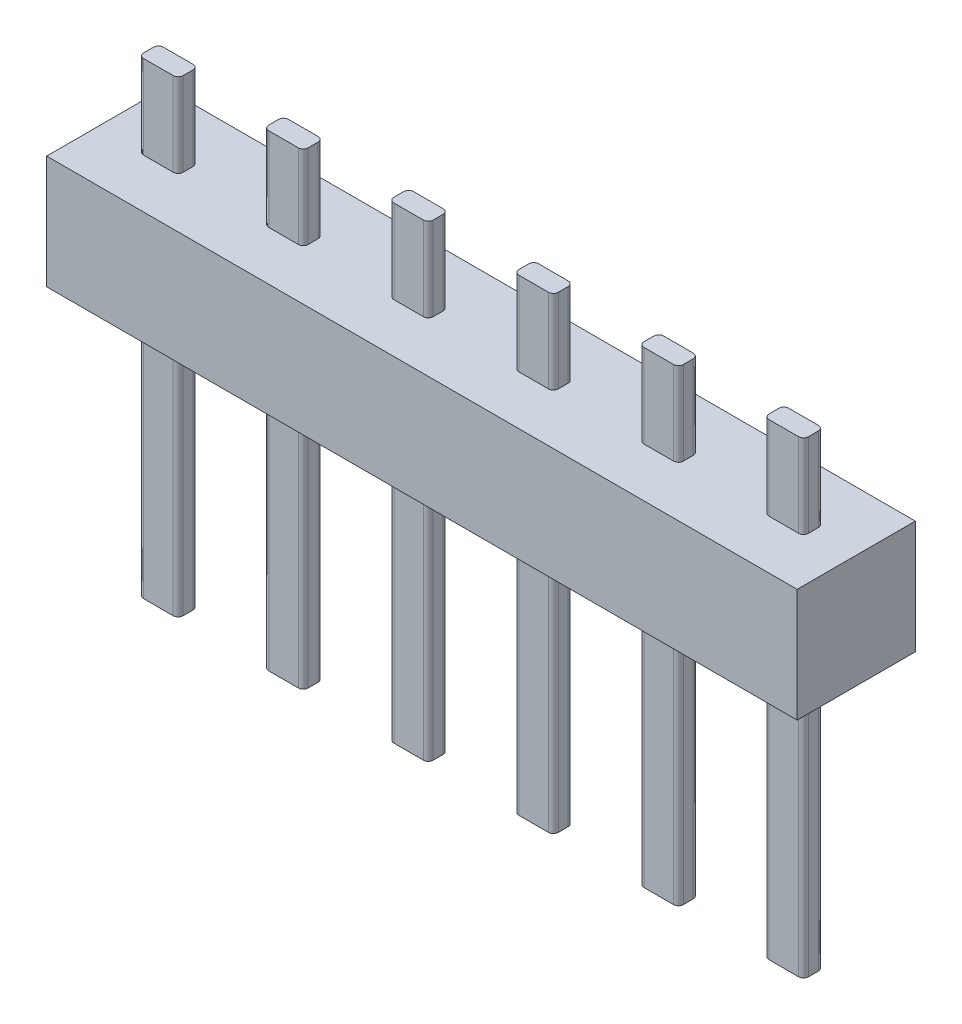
ISO-10303-21;
HEADER;
FILE_DESCRIPTION(('STEP AP214'),'2;1');
FILE_NAME('part.step','',(''),(''),'','','');
FILE_SCHEMA(('AUTOMOTIVE_DESIGN { 1 0 10303 214 1 1 1 1 }'));
ENDSEC;
DATA;
#1=APPLICATION_CONTEXT('core data for automotive mechanical design processes');
#2=APPLICATION_PROTOCOL_DEFINITION('international standard','automotive_design',2000,#1);
#3=PRODUCT_CONTEXT('',#1,'mechanical');
#4=PRODUCT('Part','Part','',(#3));
#5=PRODUCT_RELATED_PRODUCT_CATEGORY('part','',(#4));
#6=PRODUCT_DEFINITION_FORMATION('','',#4);
#7=PRODUCT_DEFINITION_CONTEXT('part definition',#1,'design');
#8=PRODUCT_DEFINITION('design','',#6,#7);
#9=PRODUCT_DEFINITION_SHAPE('','',#8);
#10=(LENGTH_UNIT() NAMED_UNIT(*) SI_UNIT(.MILLI.,.METRE.));
#11=(NAMED_UNIT(*) PLANE_ANGLE_UNIT() SI_UNIT($,.RADIAN.));
#12=(NAMED_UNIT(*) SI_UNIT($,.STERADIAN.) SOLID_ANGLE_UNIT());
#13=UNCERTAINTY_MEASURE_WITH_UNIT(LENGTH_MEASURE(1.E-05),#10,'distance_accuracy_value','');
#14=(GEOMETRIC_REPRESENTATION_CONTEXT(3) GLOBAL_UNCERTAINTY_ASSIGNED_CONTEXT((#13)) GLOBAL_UNIT_ASSIGNED_CONTEXT((#10,
#11,#12)) REPRESENTATION_CONTEXT('',''));
#15=CARTESIAN_POINT('',(0.,0.,0.));
#16=DIRECTION('',(0.,0.,1.));
#17=DIRECTION('',(1.,0.,0.));
#18=AXIS2_PLACEMENT_3D('',#15,#16,#17);
#19=CARTESIAN_POINT('',(15.24,0.,0.));
#20=DIRECTION('',(0.,1.,0.));
#21=DIRECTION('',(0.,0.,1.));
#22=AXIS2_PLACEMENT_3D('',#19,#20,#21);
#23=PLANE('',#22);
#24=CARTESIAN_POINT('',(4.11,0.,-1.30000000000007));
#25=DIRECTION('',(0.,1.,0.));
#26=DIRECTION('',(0.,0.,1.));
#27=AXIS2_PLACEMENT_3D('',#24,#25,#26);
#28=CIRCLE('',#27,0.0999999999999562);
#29=CARTESIAN_POINT('',(4.11,0.,-1.39999999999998));
#30=VERTEX_POINT('',#29);
#31=CARTESIAN_POINT('',(4.21,0.,-1.30000000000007));
#32=VERTEX_POINT('',#31);
#33=EDGE_CURVE('E841',#30,#32,#28,.F.);
#34=ORIENTED_EDGE('',*,*,#33,.F.);
#35=DIRECTION('',(1.,0.,0.));
#36=VECTOR('',#35,1.);
#37=CARTESIAN_POINT('',(15.24,0.,-1.39999999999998));
#38=LINE('',#37,#36);
#39=CARTESIAN_POINT('',(3.51,0.,-1.39999999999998));
#40=VERTEX_POINT('',#39);
#41=EDGE_CURVE('E820',#40,#30,#38,.T.);
#42=ORIENTED_EDGE('',*,*,#41,.F.);
#43=CARTESIAN_POINT('',(3.51,0.,-1.30000000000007));
#44=DIRECTION('',(0.,1.,0.));
#45=DIRECTION('',(0.,0.,1.));
#46=AXIS2_PLACEMENT_3D('',#43,#44,#45);
#47=CIRCLE('',#46,0.0999999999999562);
#48=CARTESIAN_POINT('',(3.41000000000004,0.,-1.30000000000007));
#49=VERTEX_POINT('',#48);
#50=EDGE_CURVE('E823',#49,#40,#47,.F.);
#51=ORIENTED_EDGE('',*,*,#50,.F.);
#52=DIRECTION('',(0.,0.,-1.));
#53=VECTOR('',#52,1.);
#54=CARTESIAN_POINT('',(3.41,0.,0.));
#55=LINE('',#54,#53);
#56=CARTESIAN_POINT('',(3.41,0.,-1.10000000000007));
#57=VERTEX_POINT('',#56);
#58=EDGE_CURVE('E826',#57,#49,#55,.T.);
#59=ORIENTED_EDGE('',*,*,#58,.F.);
#60=CARTESIAN_POINT('',(3.51,0.,-1.10000000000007));
#61=DIRECTION('',(0.,1.,0.));
#62=DIRECTION('',(0.,0.,1.));
#63=AXIS2_PLACEMENT_3D('',#60,#61,#62);
#64=CIRCLE('',#63,0.0999999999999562);
#65=CARTESIAN_POINT('',(3.51,0.,-1.00000000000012));
#66=VERTEX_POINT('',#65);
#67=EDGE_CURVE('E829',#66,#57,#64,.F.);
#68=ORIENTED_EDGE('',*,*,#67,.F.);
#69=DIRECTION('',(-1.,0.,0.));
#70=VECTOR('',#69,1.);
#71=CARTESIAN_POINT('',(15.24,0.,-1.00000000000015));
#72=LINE('',#71,#70);
#73=CARTESIAN_POINT('',(4.11,0.,-1.00000000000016));
#74=VERTEX_POINT('',#73);
#75=EDGE_CURVE('E832',#74,#66,#72,.T.);
#76=ORIENTED_EDGE('',*,*,#75,.F.);
#77=CARTESIAN_POINT('',(4.11,0.,-1.10000000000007));
#78=DIRECTION('',(0.,1.,0.));
#79=DIRECTION('',(0.,0.,1.));
#80=AXIS2_PLACEMENT_3D('',#77,#78,#79);
#81=CIRCLE('',#80,0.0999999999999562);
#82=CARTESIAN_POINT('',(4.20999999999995,0.,-1.10000000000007));
#83=VERTEX_POINT('',#82);
#84=EDGE_CURVE('E835',#83,#74,#81,.F.);
#85=ORIENTED_EDGE('',*,*,#84,.F.);
#86=DIRECTION('',(0.,0.,1.));
#87=VECTOR('',#86,1.);
#88=CARTESIAN_POINT('',(4.21,0.,0.));
#89=LINE('',#88,#87);
#90=EDGE_CURVE('E838',#32,#83,#89,.T.);
#91=ORIENTED_EDGE('',*,*,#90,.F.);
#92=EDGE_LOOP('',(#34,#42,#51,#59,#68,#76,#85,#91));
#93=FACE_BOUND('',#92,.T.);
#94=CARTESIAN_POINT('',(9.19,0.,-1.30000000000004));
#95=DIRECTION('',(0.,1.,0.));
#96=DIRECTION('',(0.,0.,1.));
#97=AXIS2_PLACEMENT_3D('',#94,#95,#96);
#98=CIRCLE('',#97,0.0999999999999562);
#99=CARTESIAN_POINT('',(9.19,0.,-1.39999999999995));
#100=VERTEX_POINT('',#99);
#101=CARTESIAN_POINT('',(9.29,0.,-1.30000000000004));
#102=VERTEX_POINT('',#101);
#103=EDGE_CURVE('E1035',#100,#102,#98,.F.);
#104=ORIENTED_EDGE('',*,*,#103,.F.);
#105=DIRECTION('',(1.,0.,0.));
#106=VECTOR('',#105,1.);
#107=CARTESIAN_POINT('',(15.24,0.,-1.39999999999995));
#108=LINE('',#107,#106);
#109=CARTESIAN_POINT('',(8.59,0.,-1.39999999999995));
#110=VERTEX_POINT('',#109);
#111=EDGE_CURVE('E1014',#110,#100,#108,.T.);
#112=ORIENTED_EDGE('',*,*,#111,.F.);
#113=CARTESIAN_POINT('',(8.59,0.,-1.30000000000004));
#114=DIRECTION('',(0.,1.,0.));
#115=DIRECTION('',(0.,0.,1.));
#116=AXIS2_PLACEMENT_3D('',#113,#114,#115);
#117=CIRCLE('',#116,0.0999999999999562);
#118=CARTESIAN_POINT('',(8.49000000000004,0.,-1.30000000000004));
#119=VERTEX_POINT('',#118);
#120=EDGE_CURVE('E1017',#119,#110,#117,.F.);
#121=ORIENTED_EDGE('',*,*,#120,.F.);
#122=DIRECTION('',(0.,0.,-1.));
#123=VECTOR('',#122,1.);
#124=CARTESIAN_POINT('',(8.49,0.,0.));
#125=LINE('',#124,#123);
#126=CARTESIAN_POINT('',(8.49,0.,-1.10000000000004));
#127=VERTEX_POINT('',#126);
#128=EDGE_CURVE('E1020',#127,#119,#125,.T.);
#129=ORIENTED_EDGE('',*,*,#128,.F.);
#130=CARTESIAN_POINT('',(8.59,0.,-1.10000000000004));
#131=DIRECTION('',(0.,1.,0.));
#132=DIRECTION('',(0.,0.,1.));
#133=AXIS2_PLACEMENT_3D('',#130,#131,#132);
#134=CIRCLE('',#133,0.0999999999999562);
#135=CARTESIAN_POINT('',(8.59,0.,-1.00000000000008));
#136=VERTEX_POINT('',#135);
#137=EDGE_CURVE('E1023',#136,#127,#134,.F.);
#138=ORIENTED_EDGE('',*,*,#137,.F.);
#139=DIRECTION('',(-1.,0.,0.));
#140=VECTOR('',#139,1.);
#141=CARTESIAN_POINT('',(15.24,0.,-1.00000000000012));
#142=LINE('',#141,#140);
#143=CARTESIAN_POINT('',(9.19,0.,-1.00000000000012));
#144=VERTEX_POINT('',#143);
#145=EDGE_CURVE('E1026',#144,#136,#142,.T.);
#146=ORIENTED_EDGE('',*,*,#145,.F.);
#147=CARTESIAN_POINT('',(9.19,0.,-1.10000000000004));
#148=DIRECTION('',(0.,1.,0.));
#149=DIRECTION('',(0.,0.,1.));
#150=AXIS2_PLACEMENT_3D('',#147,#148,#149);
#151=CIRCLE('',#150,0.0999999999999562);
#152=CARTESIAN_POINT('',(9.28999999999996,0.,-1.10000000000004));
#153=VERTEX_POINT('',#152);
#154=EDGE_CURVE('E1029',#153,#144,#151,.F.);
#155=ORIENTED_EDGE('',*,*,#154,.F.);
#156=DIRECTION('',(0.,0.,1.));
#157=VECTOR('',#156,1.);
#158=CARTESIAN_POINT('',(9.29,0.,0.));
#159=LINE('',#158,#157);
#160=EDGE_CURVE('E1032',#102,#153,#159,.T.);
#161=ORIENTED_EDGE('',*,*,#160,.F.);
#162=EDGE_LOOP('',(#104,#112,#121,#129,#138,#146,#155,#161));
#163=FACE_BOUND('',#162,.T.);
#164=CARTESIAN_POINT('',(14.27,0.,-1.3));
#165=DIRECTION('',(0.,1.,0.));
#166=DIRECTION('',(0.,0.,1.));
#167=AXIS2_PLACEMENT_3D('',#164,#165,#166);
#168=CIRCLE('',#167,0.0999999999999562);
#169=CARTESIAN_POINT('',(14.27,0.,-1.39999999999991));
#170=VERTEX_POINT('',#169);
#171=CARTESIAN_POINT('',(14.37,0.,-1.3));
#172=VERTEX_POINT('',#171);
#173=EDGE_CURVE('E1229',#170,#172,#168,.F.);
#174=ORIENTED_EDGE('',*,*,#173,.F.);
#175=DIRECTION('',(1.,0.,0.));
#176=VECTOR('',#175,1.);
#177=CARTESIAN_POINT('',(15.24,0.,-1.39999999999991));
#178=LINE('',#177,#176);
#179=CARTESIAN_POINT('',(13.67,0.,-1.39999999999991));
#180=VERTEX_POINT('',#179);
#181=EDGE_CURVE('E1208',#180,#170,#178,.T.);
#182=ORIENTED_EDGE('',*,*,#181,.F.);
#183=CARTESIAN_POINT('',(13.67,0.,-1.3));
#184=DIRECTION('',(0.,1.,0.));
#185=DIRECTION('',(0.,0.,1.));
#186=AXIS2_PLACEMENT_3D('',#183,#184,#185);
#187=CIRCLE('',#186,0.0999999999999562);
#188=CARTESIAN_POINT('',(13.57,0.,-1.3));
#189=VERTEX_POINT('',#188);
#190=EDGE_CURVE('E1211',#189,#180,#187,.F.);
#191=ORIENTED_EDGE('',*,*,#190,.F.);
#192=DIRECTION('',(0.,0.,-1.));
#193=VECTOR('',#192,1.);
#194=CARTESIAN_POINT('',(13.57,0.,0.));
#195=LINE('',#194,#193);
#196=CARTESIAN_POINT('',(13.57,0.,-1.1));
#197=VERTEX_POINT('',#196);
#198=EDGE_CURVE('E1214',#197,#189,#195,.T.);
#199=ORIENTED_EDGE('',*,*,#198,.F.);
#200=CARTESIAN_POINT('',(13.67,0.,-1.1));
#201=DIRECTION('',(0.,1.,0.));
#202=DIRECTION('',(0.,0.,1.));
#203=AXIS2_PLACEMENT_3D('',#200,#201,#202);
#204=CIRCLE('',#203,0.0999999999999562);
#205=CARTESIAN_POINT('',(13.67,0.,-1.00000000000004));
#206=VERTEX_POINT('',#205);
#207=EDGE_CURVE('E1217',#206,#197,#204,.F.);
#208=ORIENTED_EDGE('',*,*,#207,.F.);
#209=DIRECTION('',(-1.,0.,0.));
#210=VECTOR('',#209,1.);
#211=CARTESIAN_POINT('',(15.24,0.,-1.00000000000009));
#212=LINE('',#211,#210);
#213=CARTESIAN_POINT('',(14.27,0.,-1.00000000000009));
#214=VERTEX_POINT('',#213);
#215=EDGE_CURVE('E1220',#214,#206,#212,.T.);
#216=ORIENTED_EDGE('',*,*,#215,.F.);
#217=CARTESIAN_POINT('',(14.27,0.,-1.1));
#218=DIRECTION('',(0.,1.,0.));
#219=DIRECTION('',(0.,0.,1.));
#220=AXIS2_PLACEMENT_3D('',#217,#218,#219);
#221=CIRCLE('',#220,0.0999999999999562);
#222=CARTESIAN_POINT('',(14.37,0.,-1.1));
#223=VERTEX_POINT('',#222);
#224=EDGE_CURVE('E1223',#223,#214,#221,.F.);
#225=ORIENTED_EDGE('',*,*,#224,.F.);
#226=DIRECTION('',(0.,0.,1.));
#227=VECTOR('',#226,1.);
#228=CARTESIAN_POINT('',(14.37,0.,0.));
#229=LINE('',#228,#227);
#230=EDGE_CURVE('E1226',#172,#223,#229,.T.);
#231=ORIENTED_EDGE('',*,*,#230,.F.);
#232=EDGE_LOOP('',(#174,#182,#191,#199,#208,#216,#225,#231));
#233=FACE_BOUND('',#232,.T.);
#234=DIRECTION('',(0.,0.,-1.));
#235=VECTOR('',#234,1.);
#236=CARTESIAN_POINT('',(0.,0.,0.));
#237=LINE('',#236,#235);
#238=CARTESIAN_POINT('',(0.,0.,0.));
#239=VERTEX_POINT('',#238);
#240=CARTESIAN_POINT('',(0.,0.,-2.4));
#241=VERTEX_POINT('',#240);
#242=EDGE_CURVE('E1235',#239,#241,#237,.T.);
#243=ORIENTED_EDGE('',*,*,#242,.T.);
#244=DIRECTION('',(-1.,0.,0.));
#245=VECTOR('',#244,1.);
#246=CARTESIAN_POINT('',(15.24,0.,-2.4));
#247=LINE('',#246,#245);
#248=CARTESIAN_POINT('',(15.24,0.,-2.4));
#249=VERTEX_POINT('',#248);
#250=EDGE_CURVE('E1256',#249,#241,#247,.T.);
#251=ORIENTED_EDGE('',*,*,#250,.F.);
#252=DIRECTION('',(0.,0.,-1.));
#253=VECTOR('',#252,1.);
#254=CARTESIAN_POINT('',(15.24,0.,0.));
#255=LINE('',#254,#253);
#256=CARTESIAN_POINT('',(15.24,0.,0.));
#257=VERTEX_POINT('',#256);
#258=EDGE_CURVE('E1244',#257,#249,#255,.T.);
#259=ORIENTED_EDGE('',*,*,#258,.F.);
#260=DIRECTION('',(-1.,0.,0.));
#261=VECTOR('',#260,1.);
#262=CARTESIAN_POINT('',(15.24,0.,0.));
#263=LINE('',#262,#261);
#264=EDGE_CURVE('E1259',#257,#239,#263,.T.);
#265=ORIENTED_EDGE('',*,*,#264,.T.);
#266=EDGE_LOOP('',(#243,#251,#259,#265));
#267=FACE_BOUND('',#266,.T.);
#268=CARTESIAN_POINT('',(11.73,0.,-1.30000000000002));
#269=DIRECTION('',(0.,1.,0.));
#270=DIRECTION('',(0.,0.,1.));
#271=AXIS2_PLACEMENT_3D('',#268,#269,#270);
#272=CIRCLE('',#271,0.0999999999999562);
#273=CARTESIAN_POINT('',(11.73,0.,-1.39999999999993));
#274=VERTEX_POINT('',#273);
#275=CARTESIAN_POINT('',(11.83,0.,-1.30000000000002));
#276=VERTEX_POINT('',#275);
#277=EDGE_CURVE('E1132',#274,#276,#272,.F.);
#278=ORIENTED_EDGE('',*,*,#277,.F.);
#279=DIRECTION('',(1.,0.,0.));
#280=VECTOR('',#279,1.);
#281=CARTESIAN_POINT('',(15.24,0.,-1.39999999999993));
#282=LINE('',#281,#280);
#283=CARTESIAN_POINT('',(11.13,0.,-1.39999999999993));
#284=VERTEX_POINT('',#283);
#285=EDGE_CURVE('E1111',#284,#274,#282,.T.);
#286=ORIENTED_EDGE('',*,*,#285,.F.);
#287=CARTESIAN_POINT('',(11.13,0.,-1.30000000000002));
#288=DIRECTION('',(0.,1.,0.));
#289=DIRECTION('',(0.,0.,1.));
#290=AXIS2_PLACEMENT_3D('',#287,#288,#289);
#291=CIRCLE('',#290,0.0999999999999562);
#292=CARTESIAN_POINT('',(11.03,0.,-1.30000000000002));
#293=VERTEX_POINT('',#292);
#294=EDGE_CURVE('E1114',#293,#284,#291,.F.);
#295=ORIENTED_EDGE('',*,*,#294,.F.);
#296=DIRECTION('',(0.,0.,-1.));
#297=VECTOR('',#296,1.);
#298=CARTESIAN_POINT('',(11.03,0.,0.));
#299=LINE('',#298,#297);
#300=CARTESIAN_POINT('',(11.03,0.,-1.10000000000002));
#301=VERTEX_POINT('',#300);
#302=EDGE_CURVE('E1117',#301,#293,#299,.T.);
#303=ORIENTED_EDGE('',*,*,#302,.F.);
#304=CARTESIAN_POINT('',(11.13,0.,-1.10000000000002));
#305=DIRECTION('',(0.,1.,0.));
#306=DIRECTION('',(0.,0.,1.));
#307=AXIS2_PLACEMENT_3D('',#304,#305,#306);
#308=CIRCLE('',#307,0.0999999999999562);
#309=CARTESIAN_POINT('',(11.13,0.,-1.00000000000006));
#310=VERTEX_POINT('',#309);
#311=EDGE_CURVE('E1120',#310,#301,#308,.F.);
#312=ORIENTED_EDGE('',*,*,#311,.F.);
#313=DIRECTION('',(-1.,0.,0.));
#314=VECTOR('',#313,1.);
#315=CARTESIAN_POINT('',(15.24,0.,-1.0000000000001));
#316=LINE('',#315,#314);
#317=CARTESIAN_POINT('',(11.73,0.,-1.0000000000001));
#318=VERTEX_POINT('',#317);
#319=EDGE_CURVE('E1123',#318,#310,#316,.T.);
#320=ORIENTED_EDGE('',*,*,#319,.F.);
#321=CARTESIAN_POINT('',(11.73,0.,-1.10000000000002));
#322=DIRECTION('',(0.,1.,0.));
#323=DIRECTION('',(0.,0.,1.));
#324=AXIS2_PLACEMENT_3D('',#321,#322,#323);
#325=CIRCLE('',#324,0.0999999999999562);
#326=CARTESIAN_POINT('',(11.83,0.,-1.10000000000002));
#327=VERTEX_POINT('',#326);
#328=EDGE_CURVE('E1126',#327,#318,#325,.F.);
#329=ORIENTED_EDGE('',*,*,#328,.F.);
#330=DIRECTION('',(0.,0.,1.));
#331=VECTOR('',#330,1.);
#332=CARTESIAN_POINT('',(11.83,0.,0.));
#333=LINE('',#332,#331);
#334=EDGE_CURVE('E1129',#276,#327,#333,.T.);
#335=ORIENTED_EDGE('',*,*,#334,.F.);
#336=EDGE_LOOP('',(#278,#286,#295,#303,#312,#320,#329,#335));
#337=FACE_BOUND('',#336,.T.);
#338=CARTESIAN_POINT('',(6.65,0.,-1.30000000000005));
#339=DIRECTION('',(0.,1.,0.));
#340=DIRECTION('',(0.,0.,1.));
#341=AXIS2_PLACEMENT_3D('',#338,#339,#340);
#342=CIRCLE('',#341,0.0999999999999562);
#343=CARTESIAN_POINT('',(6.65,0.,-1.39999999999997));
#344=VERTEX_POINT('',#343);
#345=CARTESIAN_POINT('',(6.75,0.,-1.30000000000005));
#346=VERTEX_POINT('',#345);
#347=EDGE_CURVE('E938',#344,#346,#342,.F.);
#348=ORIENTED_EDGE('',*,*,#347,.F.);
#349=DIRECTION('',(1.,0.,0.));
#350=VECTOR('',#349,1.);
#351=CARTESIAN_POINT('',(15.24,0.,-1.39999999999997));
#352=LINE('',#351,#350);
#353=CARTESIAN_POINT('',(6.05,0.,-1.39999999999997));
#354=VERTEX_POINT('',#353);
#355=EDGE_CURVE('E917',#354,#344,#352,.T.);
#356=ORIENTED_EDGE('',*,*,#355,.F.);
#357=CARTESIAN_POINT('',(6.05,0.,-1.30000000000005));
#358=DIRECTION('',(0.,1.,0.));
#359=DIRECTION('',(0.,0.,1.));
#360=AXIS2_PLACEMENT_3D('',#357,#358,#359);
#361=CIRCLE('',#360,0.0999999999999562);
#362=CARTESIAN_POINT('',(5.95000000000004,0.,-1.30000000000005));
#363=VERTEX_POINT('',#362);
#364=EDGE_CURVE('E920',#363,#354,#361,.F.);
#365=ORIENTED_EDGE('',*,*,#364,.F.);
#366=DIRECTION('',(0.,0.,-1.));
#367=VECTOR('',#366,1.);
#368=CARTESIAN_POINT('',(5.95,0.,0.));
#369=LINE('',#368,#367);
#370=CARTESIAN_POINT('',(5.95,0.,-1.10000000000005));
#371=VERTEX_POINT('',#370);
#372=EDGE_CURVE('E923',#371,#363,#369,.T.);
#373=ORIENTED_EDGE('',*,*,#372,.F.);
#374=CARTESIAN_POINT('',(6.05,0.,-1.10000000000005));
#375=DIRECTION('',(0.,1.,0.));
#376=DIRECTION('',(0.,0.,1.));
#377=AXIS2_PLACEMENT_3D('',#374,#375,#376);
#378=CIRCLE('',#377,0.0999999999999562);
#379=CARTESIAN_POINT('',(6.05,0.,-1.0000000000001));
#380=VERTEX_POINT('',#379);
#381=EDGE_CURVE('E926',#380,#371,#378,.F.);
#382=ORIENTED_EDGE('',*,*,#381,.F.);
#383=DIRECTION('',(-1.,0.,0.));
#384=VECTOR('',#383,1.);
#385=CARTESIAN_POINT('',(15.24,0.,-1.00000000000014));
#386=LINE('',#385,#384);
#387=CARTESIAN_POINT('',(6.65,0.,-1.00000000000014));
#388=VERTEX_POINT('',#387);
#389=EDGE_CURVE('E929',#388,#380,#386,.T.);
#390=ORIENTED_EDGE('',*,*,#389,.F.);
#391=CARTESIAN_POINT('',(6.65,0.,-1.10000000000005));
#392=DIRECTION('',(0.,1.,0.));
#393=DIRECTION('',(0.,0.,1.));
#394=AXIS2_PLACEMENT_3D('',#391,#392,#393);
#395=CIRCLE('',#394,0.0999999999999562);
#396=CARTESIAN_POINT('',(6.74999999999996,0.,-1.10000000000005));
#397=VERTEX_POINT('',#396);
#398=EDGE_CURVE('E932',#397,#388,#395,.F.);
#399=ORIENTED_EDGE('',*,*,#398,.F.);
#400=DIRECTION('',(0.,0.,1.));
#401=VECTOR('',#400,1.);
#402=CARTESIAN_POINT('',(6.75,0.,0.));
#403=LINE('',#402,#401);
#404=EDGE_CURVE('E935',#346,#397,#403,.T.);
#405=ORIENTED_EDGE('',*,*,#404,.F.);
#406=EDGE_LOOP('',(#348,#356,#365,#373,#382,#390,#399,#405));
#407=FACE_BOUND('',#406,.T.);
#408=CARTESIAN_POINT('',(1.57,0.,-1.30000000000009));
#409=DIRECTION('',(0.,1.,0.));
#410=DIRECTION('',(0.,0.,1.));
#411=AXIS2_PLACEMENT_3D('',#408,#409,#410);
#412=CIRCLE('',#411,0.0999999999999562);
#413=CARTESIAN_POINT('',(1.57,0.,-1.4));
#414=VERTEX_POINT('',#413);
#415=CARTESIAN_POINT('',(1.67,0.,-1.30000000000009));
#416=VERTEX_POINT('',#415);
#417=EDGE_CURVE('E745',#414,#416,#412,.F.);
#418=ORIENTED_EDGE('',*,*,#417,.F.);
#419=DIRECTION('',(1.,0.,0.));
#420=VECTOR('',#419,1.);
#421=CARTESIAN_POINT('',(15.24,0.,-1.4));
#422=LINE('',#421,#420);
#423=CARTESIAN_POINT('',(0.97,0.,-1.4));
#424=VERTEX_POINT('',#423);
#425=EDGE_CURVE('E728',#424,#414,#422,.T.);
#426=ORIENTED_EDGE('',*,*,#425,.F.);
#427=CARTESIAN_POINT('',(0.97,0.,-1.30000000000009));
#428=DIRECTION('',(0.,1.,0.));
#429=DIRECTION('',(0.,0.,1.));
#430=AXIS2_PLACEMENT_3D('',#427,#428,#429);
#431=CIRCLE('',#430,0.0999999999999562);
#432=CARTESIAN_POINT('',(0.870000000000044,0.,-1.30000000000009));
#433=VERTEX_POINT('',#432);
#434=EDGE_CURVE('E731',#433,#424,#431,.F.);
#435=ORIENTED_EDGE('',*,*,#434,.F.);
#436=DIRECTION('',(0.,0.,-1.));
#437=VECTOR('',#436,1.);
#438=CARTESIAN_POINT('',(0.870000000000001,0.,0.));
#439=LINE('',#438,#437);
#440=CARTESIAN_POINT('',(0.870000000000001,0.,-1.10000000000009));
#441=VERTEX_POINT('',#440);
#442=EDGE_CURVE('E734',#441,#433,#439,.T.);
#443=ORIENTED_EDGE('',*,*,#442,.F.);
#444=CARTESIAN_POINT('',(0.97,0.,-1.10000000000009));
#445=DIRECTION('',(0.,1.,0.));
#446=DIRECTION('',(0.,0.,1.));
#447=AXIS2_PLACEMENT_3D('',#444,#445,#446);
#448=CIRCLE('',#447,0.0999999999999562);
#449=CARTESIAN_POINT('',(0.97,0.,-1.00000000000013));
#450=VERTEX_POINT('',#449);
#451=EDGE_CURVE('E737',#450,#441,#448,.F.);
#452=ORIENTED_EDGE('',*,*,#451,.F.);
#453=DIRECTION('',(-1.,0.,0.));
#454=VECTOR('',#453,1.);
#455=CARTESIAN_POINT('',(15.24,0.,-1.00000000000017));
#456=LINE('',#455,#454);
#457=CARTESIAN_POINT('',(1.57,0.,-1.00000000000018));
#458=VERTEX_POINT('',#457);
#459=EDGE_CURVE('E740',#458,#450,#456,.T.);
#460=ORIENTED_EDGE('',*,*,#459,.F.);
#461=CARTESIAN_POINT('',(1.57,0.,-1.10000000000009));
#462=DIRECTION('',(0.,1.,0.));
#463=DIRECTION('',(0.,0.,1.));
#464=AXIS2_PLACEMENT_3D('',#461,#462,#463);
#465=CIRCLE('',#464,0.0999999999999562);
#466=CARTESIAN_POINT('',(1.66999999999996,0.,-1.10000000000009));
#467=VERTEX_POINT('',#466);
#468=EDGE_CURVE('E47',#467,#458,#465,.F.);
#469=ORIENTED_EDGE('',*,*,#468,.F.);
#470=DIRECTION('',(0.,0.,1.));
#471=VECTOR('',#470,1.);
#472=CARTESIAN_POINT('',(1.67,0.,0.));
#473=LINE('',#472,#471);
#474=EDGE_CURVE('E42',#416,#467,#473,.T.);
#475=ORIENTED_EDGE('',*,*,#474,.F.);
#476=EDGE_LOOP('',(#418,#426,#435,#443,#452,#460,#469,#475));
#477=FACE_BOUND('',#476,.T.);
#478=ADVANCED_FACE('F27',(#93,#163,#233,#267,#337,#407,#477),#23,.F.);
#479=CARTESIAN_POINT('',(15.24,2.3,0.));
#480=DIRECTION('',(0.,-1.,0.));
#481=DIRECTION('',(0.,0.,-1.));
#482=AXIS2_PLACEMENT_3D('',#479,#480,#481);
#483=PLANE('',#482);
#484=CARTESIAN_POINT('',(4.11,2.3,-1.30000000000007));
#485=DIRECTION('',(0.,-1.,0.));
#486=DIRECTION('',(0.,0.,-1.));
#487=AXIS2_PLACEMENT_3D('',#484,#485,#486);
#488=CIRCLE('',#487,0.0999999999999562);
#489=CARTESIAN_POINT('',(4.21,2.3,-1.30000000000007));
#490=VERTEX_POINT('',#489);
#491=CARTESIAN_POINT('',(4.11,2.3,-1.39999999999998));
#492=VERTEX_POINT('',#491);
#493=EDGE_CURVE('E1379',#490,#492,#488,.F.);
#494=ORIENTED_EDGE('',*,*,#493,.F.);
#495=DIRECTION('',(0.,0.,-1.));
#496=VECTOR('',#495,1.);
#497=CARTESIAN_POINT('',(4.21,2.3,0.));
#498=LINE('',#497,#496);
#499=CARTESIAN_POINT('',(4.20999999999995,2.3,-1.10000000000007));
#500=VERTEX_POINT('',#499);
#501=EDGE_CURVE('E1376',#500,#490,#498,.T.);
#502=ORIENTED_EDGE('',*,*,#501,.F.);
#503=CARTESIAN_POINT('',(4.11,2.3,-1.10000000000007));
#504=DIRECTION('',(0.,-1.,0.));
#505=DIRECTION('',(0.,0.,-1.));
#506=AXIS2_PLACEMENT_3D('',#503,#504,#505);
#507=CIRCLE('',#506,0.0999999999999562);
#508=CARTESIAN_POINT('',(4.11,2.3,-1.00000000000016));
#509=VERTEX_POINT('',#508);
#510=EDGE_CURVE('E1373',#509,#500,#507,.F.);
#511=ORIENTED_EDGE('',*,*,#510,.F.);
#512=DIRECTION('',(1.,0.,0.));
#513=VECTOR('',#512,1.);
#514=CARTESIAN_POINT('',(15.24,2.3,-1.00000000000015));
#515=LINE('',#514,#513);
#516=CARTESIAN_POINT('',(3.51,2.3,-1.00000000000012));
#517=VERTEX_POINT('',#516);
#518=EDGE_CURVE('E1370',#517,#509,#515,.T.);
#519=ORIENTED_EDGE('',*,*,#518,.F.);
#520=CARTESIAN_POINT('',(3.51,2.3,-1.10000000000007));
#521=DIRECTION('',(0.,-1.,0.));
#522=DIRECTION('',(0.,0.,-1.));
#523=AXIS2_PLACEMENT_3D('',#520,#521,#522);
#524=CIRCLE('',#523,0.0999999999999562);
#525=CARTESIAN_POINT('',(3.41,2.3,-1.10000000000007));
#526=VERTEX_POINT('',#525);
#527=EDGE_CURVE('E1367',#526,#517,#524,.F.);
#528=ORIENTED_EDGE('',*,*,#527,.F.);
#529=DIRECTION('',(0.,0.,1.));
#530=VECTOR('',#529,1.);
#531=CARTESIAN_POINT('',(3.41,2.3,0.));
#532=LINE('',#531,#530);
#533=CARTESIAN_POINT('',(3.41000000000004,2.3,-1.30000000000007));
#534=VERTEX_POINT('',#533);
#535=EDGE_CURVE('E1364',#534,#526,#532,.T.);
#536=ORIENTED_EDGE('',*,*,#535,.F.);
#537=CARTESIAN_POINT('',(3.51,2.3,-1.30000000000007));
#538=DIRECTION('',(0.,-1.,0.));
#539=DIRECTION('',(0.,0.,-1.));
#540=AXIS2_PLACEMENT_3D('',#537,#538,#539);
#541=CIRCLE('',#540,0.0999999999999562);
#542=CARTESIAN_POINT('',(3.51,2.3,-1.39999999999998));
#543=VERTEX_POINT('',#542);
#544=EDGE_CURVE('E1361',#543,#534,#541,.F.);
#545=ORIENTED_EDGE('',*,*,#544,.F.);
#546=DIRECTION('',(-1.,0.,0.));
#547=VECTOR('',#546,1.);
#548=CARTESIAN_POINT('',(15.24,2.3,-1.39999999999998));
#549=LINE('',#548,#547);
#550=EDGE_CURVE('E1358',#492,#543,#549,.T.);
#551=ORIENTED_EDGE('',*,*,#550,.F.);
#552=EDGE_LOOP('',(#494,#502,#511,#519,#528,#536,#545,#551));
#553=FACE_BOUND('',#552,.T.);
#554=CARTESIAN_POINT('',(9.19,2.3,-1.30000000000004));
#555=DIRECTION('',(0.,-1.,0.));
#556=DIRECTION('',(0.,0.,-1.));
#557=AXIS2_PLACEMENT_3D('',#554,#555,#556);
#558=CIRCLE('',#557,0.0999999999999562);
#559=CARTESIAN_POINT('',(9.29,2.3,-1.30000000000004));
#560=VERTEX_POINT('',#559);
#561=CARTESIAN_POINT('',(9.19,2.3,-1.39999999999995));
#562=VERTEX_POINT('',#561);
#563=EDGE_CURVE('E1331',#560,#562,#558,.F.);
#564=ORIENTED_EDGE('',*,*,#563,.F.);
#565=DIRECTION('',(0.,0.,-1.));
#566=VECTOR('',#565,1.);
#567=CARTESIAN_POINT('',(9.29,2.3,0.));
#568=LINE('',#567,#566);
#569=CARTESIAN_POINT('',(9.28999999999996,2.3,-1.10000000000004));
#570=VERTEX_POINT('',#569);
#571=EDGE_CURVE('E1328',#570,#560,#568,.T.);
#572=ORIENTED_EDGE('',*,*,#571,.F.);
#573=CARTESIAN_POINT('',(9.19,2.3,-1.10000000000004));
#574=DIRECTION('',(0.,-1.,0.));
#575=DIRECTION('',(0.,0.,-1.));
#576=AXIS2_PLACEMENT_3D('',#573,#574,#575);
#577=CIRCLE('',#576,0.0999999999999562);
#578=CARTESIAN_POINT('',(9.19,2.3,-1.00000000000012));
#579=VERTEX_POINT('',#578);
#580=EDGE_CURVE('E1325',#579,#570,#577,.F.);
#581=ORIENTED_EDGE('',*,*,#580,.F.);
#582=DIRECTION('',(1.,0.,0.));
#583=VECTOR('',#582,1.);
#584=CARTESIAN_POINT('',(15.24,2.3,-1.00000000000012));
#585=LINE('',#584,#583);
#586=CARTESIAN_POINT('',(8.59,2.3,-1.00000000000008));
#587=VERTEX_POINT('',#586);
#588=EDGE_CURVE('E1322',#587,#579,#585,.T.);
#589=ORIENTED_EDGE('',*,*,#588,.F.);
#590=CARTESIAN_POINT('',(8.59,2.3,-1.10000000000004));
#591=DIRECTION('',(0.,-1.,0.));
#592=DIRECTION('',(0.,0.,-1.));
#593=AXIS2_PLACEMENT_3D('',#590,#591,#592);
#594=CIRCLE('',#593,0.0999999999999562);
#595=CARTESIAN_POINT('',(8.49,2.3,-1.10000000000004));
#596=VERTEX_POINT('',#595);
#597=EDGE_CURVE('E1319',#596,#587,#594,.F.);
#598=ORIENTED_EDGE('',*,*,#597,.F.);
#599=DIRECTION('',(0.,0.,1.));
#600=VECTOR('',#599,1.);
#601=CARTESIAN_POINT('',(8.49,2.3,0.));
#602=LINE('',#601,#600);
#603=CARTESIAN_POINT('',(8.49000000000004,2.3,-1.30000000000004));
#604=VERTEX_POINT('',#603);
#605=EDGE_CURVE('E1316',#604,#596,#602,.T.);
#606=ORIENTED_EDGE('',*,*,#605,.F.);
#607=CARTESIAN_POINT('',(8.59,2.3,-1.30000000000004));
#608=DIRECTION('',(0.,-1.,0.));
#609=DIRECTION('',(0.,0.,-1.));
#610=AXIS2_PLACEMENT_3D('',#607,#608,#609);
#611=CIRCLE('',#610,0.0999999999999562);
#612=CARTESIAN_POINT('',(8.59,2.3,-1.39999999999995));
#613=VERTEX_POINT('',#612);
#614=EDGE_CURVE('E1313',#613,#604,#611,.F.);
#615=ORIENTED_EDGE('',*,*,#614,.F.);
#616=DIRECTION('',(-1.,0.,0.));
#617=VECTOR('',#616,1.);
#618=CARTESIAN_POINT('',(15.24,2.3,-1.39999999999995));
#619=LINE('',#618,#617);
#620=EDGE_CURVE('E1310',#562,#613,#619,.T.);
#621=ORIENTED_EDGE('',*,*,#620,.F.);
#622=EDGE_LOOP('',(#564,#572,#581,#589,#598,#606,#615,#621));
#623=FACE_BOUND('',#622,.T.);
#624=CARTESIAN_POINT('',(14.27,2.3,-1.3));
#625=DIRECTION('',(0.,-1.,0.));
#626=DIRECTION('',(0.,0.,-1.));
#627=AXIS2_PLACEMENT_3D('',#624,#625,#626);
#628=CIRCLE('',#627,0.0999999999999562);
#629=CARTESIAN_POINT('',(14.37,2.3,-1.3));
#630=VERTEX_POINT('',#629);
#631=CARTESIAN_POINT('',(14.27,2.3,-1.39999999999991));
#632=VERTEX_POINT('',#631);
#633=EDGE_CURVE('E1283',#630,#632,#628,.F.);
#634=ORIENTED_EDGE('',*,*,#633,.F.);
#635=DIRECTION('',(0.,0.,-1.));
#636=VECTOR('',#635,1.);
#637=CARTESIAN_POINT('',(14.37,2.3,0.));
#638=LINE('',#637,#636);
#639=CARTESIAN_POINT('',(14.37,2.3,-1.1));
#640=VERTEX_POINT('',#639);
#641=EDGE_CURVE('E1280',#640,#630,#638,.T.);
#642=ORIENTED_EDGE('',*,*,#641,.F.);
#643=CARTESIAN_POINT('',(14.27,2.3,-1.1));
#644=DIRECTION('',(0.,-1.,0.));
#645=DIRECTION('',(0.,0.,-1.));
#646=AXIS2_PLACEMENT_3D('',#643,#644,#645);
#647=CIRCLE('',#646,0.0999999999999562);
#648=CARTESIAN_POINT('',(14.27,2.3,-1.00000000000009));
#649=VERTEX_POINT('',#648);
#650=EDGE_CURVE('E1277',#649,#640,#647,.F.);
#651=ORIENTED_EDGE('',*,*,#650,.F.);
#652=DIRECTION('',(1.,0.,0.));
#653=VECTOR('',#652,1.);
#654=CARTESIAN_POINT('',(15.24,2.3,-1.00000000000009));
#655=LINE('',#654,#653);
#656=CARTESIAN_POINT('',(13.67,2.3,-1.00000000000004));
#657=VERTEX_POINT('',#656);
#658=EDGE_CURVE('E1274',#657,#649,#655,.T.);
#659=ORIENTED_EDGE('',*,*,#658,.F.);
#660=CARTESIAN_POINT('',(13.67,2.3,-1.1));
#661=DIRECTION('',(0.,-1.,0.));
#662=DIRECTION('',(0.,0.,-1.));
#663=AXIS2_PLACEMENT_3D('',#660,#661,#662);
#664=CIRCLE('',#663,0.0999999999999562);
#665=CARTESIAN_POINT('',(13.57,2.3,-1.1));
#666=VERTEX_POINT('',#665);
#667=EDGE_CURVE('E1271',#666,#657,#664,.F.);
#668=ORIENTED_EDGE('',*,*,#667,.F.);
#669=DIRECTION('',(0.,0.,1.));
#670=VECTOR('',#669,1.);
#671=CARTESIAN_POINT('',(13.57,2.3,0.));
#672=LINE('',#671,#670);
#673=CARTESIAN_POINT('',(13.57,2.3,-1.3));
#674=VERTEX_POINT('',#673);
#675=EDGE_CURVE('E1268',#674,#666,#672,.T.);
#676=ORIENTED_EDGE('',*,*,#675,.F.);
#677=CARTESIAN_POINT('',(13.67,2.3,-1.3));
#678=DIRECTION('',(0.,-1.,0.));
#679=DIRECTION('',(0.,0.,-1.));
#680=AXIS2_PLACEMENT_3D('',#677,#678,#679);
#681=CIRCLE('',#680,0.0999999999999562);
#682=CARTESIAN_POINT('',(13.67,2.3,-1.39999999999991));
#683=VERTEX_POINT('',#682);
#684=EDGE_CURVE('E1265',#683,#674,#681,.F.);
#685=ORIENTED_EDGE('',*,*,#684,.F.);
#686=DIRECTION('',(-1.,0.,0.));
#687=VECTOR('',#686,1.);
#688=CARTESIAN_POINT('',(15.24,2.3,-1.39999999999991));
#689=LINE('',#688,#687);
#690=EDGE_CURVE('E1262',#632,#683,#689,.T.);
#691=ORIENTED_EDGE('',*,*,#690,.F.);
#692=EDGE_LOOP('',(#634,#642,#651,#659,#668,#676,#685,#691));
#693=FACE_BOUND('',#692,.T.);
#694=DIRECTION('',(0.,0.,1.));
#695=VECTOR('',#694,1.);
#696=CARTESIAN_POINT('',(0.,2.3,0.));
#697=LINE('',#696,#695);
#698=CARTESIAN_POINT('',(0.,2.3,-2.4));
#699=VERTEX_POINT('',#698);
#700=CARTESIAN_POINT('',(0.,2.3,0.));
#701=VERTEX_POINT('',#700);
#702=EDGE_CURVE('E1239',#699,#701,#697,.T.);
#703=ORIENTED_EDGE('',*,*,#702,.T.);
#704=DIRECTION('',(-1.,0.,0.));
#705=VECTOR('',#704,1.);
#706=CARTESIAN_POINT('',(15.24,2.3,0.));
#707=LINE('',#706,#705);
#708=CARTESIAN_POINT('',(15.24,2.3,0.));
#709=VERTEX_POINT('',#708);
#710=EDGE_CURVE('E1250',#709,#701,#707,.T.);
#711=ORIENTED_EDGE('',*,*,#710,.F.);
#712=DIRECTION('',(0.,0.,1.));
#713=VECTOR('',#712,1.);
#714=CARTESIAN_POINT('',(15.24,2.3,0.));
#715=LINE('',#714,#713);
#716=CARTESIAN_POINT('',(15.24,2.3,-2.4));
#717=VERTEX_POINT('',#716);
#718=EDGE_CURVE('E1248',#717,#709,#715,.T.);
#719=ORIENTED_EDGE('',*,*,#718,.F.);
#720=DIRECTION('',(-1.,0.,0.));
#721=VECTOR('',#720,1.);
#722=CARTESIAN_POINT('',(15.24,2.3,-2.4));
#723=LINE('',#722,#721);
#724=EDGE_CURVE('E1253',#717,#699,#723,.T.);
#725=ORIENTED_EDGE('',*,*,#724,.T.);
#726=EDGE_LOOP('',(#703,#711,#719,#725));
#727=FACE_BOUND('',#726,.T.);
#728=CARTESIAN_POINT('',(11.73,2.3,-1.30000000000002));
#729=DIRECTION('',(0.,-1.,0.));
#730=DIRECTION('',(0.,0.,-1.));
#731=AXIS2_PLACEMENT_3D('',#728,#729,#730);
#732=CIRCLE('',#731,0.0999999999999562);
#733=CARTESIAN_POINT('',(11.83,2.3,-1.30000000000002));
#734=VERTEX_POINT('',#733);
#735=CARTESIAN_POINT('',(11.73,2.3,-1.39999999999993));
#736=VERTEX_POINT('',#735);
#737=EDGE_CURVE('E1307',#734,#736,#732,.F.);
#738=ORIENTED_EDGE('',*,*,#737,.F.);
#739=DIRECTION('',(0.,0.,-1.));
#740=VECTOR('',#739,1.);
#741=CARTESIAN_POINT('',(11.83,2.3,0.));
#742=LINE('',#741,#740);
#743=CARTESIAN_POINT('',(11.83,2.3,-1.10000000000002));
#744=VERTEX_POINT('',#743);
#745=EDGE_CURVE('E1304',#744,#734,#742,.T.);
#746=ORIENTED_EDGE('',*,*,#745,.F.);
#747=CARTESIAN_POINT('',(11.73,2.3,-1.10000000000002));
#748=DIRECTION('',(0.,-1.,0.));
#749=DIRECTION('',(0.,0.,-1.));
#750=AXIS2_PLACEMENT_3D('',#747,#748,#749);
#751=CIRCLE('',#750,0.0999999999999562);
#752=CARTESIAN_POINT('',(11.73,2.3,-1.0000000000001));
#753=VERTEX_POINT('',#752);
#754=EDGE_CURVE('E1301',#753,#744,#751,.F.);
#755=ORIENTED_EDGE('',*,*,#754,.F.);
#756=DIRECTION('',(1.,0.,0.));
#757=VECTOR('',#756,1.);
#758=CARTESIAN_POINT('',(15.24,2.3,-1.0000000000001));
#759=LINE('',#758,#757);
#760=CARTESIAN_POINT('',(11.13,2.3,-1.00000000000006));
#761=VERTEX_POINT('',#760);
#762=EDGE_CURVE('E1298',#761,#753,#759,.T.);
#763=ORIENTED_EDGE('',*,*,#762,.F.);
#764=CARTESIAN_POINT('',(11.13,2.3,-1.10000000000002));
#765=DIRECTION('',(0.,-1.,0.));
#766=DIRECTION('',(0.,0.,-1.));
#767=AXIS2_PLACEMENT_3D('',#764,#765,#766);
#768=CIRCLE('',#767,0.0999999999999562);
#769=CARTESIAN_POINT('',(11.03,2.3,-1.10000000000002));
#770=VERTEX_POINT('',#769);
#771=EDGE_CURVE('E1295',#770,#761,#768,.F.);
#772=ORIENTED_EDGE('',*,*,#771,.F.);
#773=DIRECTION('',(0.,0.,1.));
#774=VECTOR('',#773,1.);
#775=CARTESIAN_POINT('',(11.03,2.3,0.));
#776=LINE('',#775,#774);
#777=CARTESIAN_POINT('',(11.03,2.3,-1.30000000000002));
#778=VERTEX_POINT('',#777);
#779=EDGE_CURVE('E1292',#778,#770,#776,.T.);
#780=ORIENTED_EDGE('',*,*,#779,.F.);
#781=CARTESIAN_POINT('',(11.13,2.3,-1.30000000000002));
#782=DIRECTION('',(0.,-1.,0.));
#783=DIRECTION('',(0.,0.,-1.));
#784=AXIS2_PLACEMENT_3D('',#781,#782,#783);
#785=CIRCLE('',#784,0.0999999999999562);
#786=CARTESIAN_POINT('',(11.13,2.3,-1.39999999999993));
#787=VERTEX_POINT('',#786);
#788=EDGE_CURVE('E1289',#787,#778,#785,.F.);
#789=ORIENTED_EDGE('',*,*,#788,.F.);
#790=DIRECTION('',(-1.,0.,0.));
#791=VECTOR('',#790,1.);
#792=CARTESIAN_POINT('',(15.24,2.3,-1.39999999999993));
#793=LINE('',#792,#791);
#794=EDGE_CURVE('E1286',#736,#787,#793,.T.);
#795=ORIENTED_EDGE('',*,*,#794,.F.);
#796=EDGE_LOOP('',(#738,#746,#755,#763,#772,#780,#789,#795));
#797=FACE_BOUND('',#796,.T.);
#798=CARTESIAN_POINT('',(6.65,2.3,-1.30000000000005));
#799=DIRECTION('',(0.,-1.,0.));
#800=DIRECTION('',(0.,0.,-1.));
#801=AXIS2_PLACEMENT_3D('',#798,#799,#800);
#802=CIRCLE('',#801,0.0999999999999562);
#803=CARTESIAN_POINT('',(6.75,2.3,-1.30000000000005));
#804=VERTEX_POINT('',#803);
#805=CARTESIAN_POINT('',(6.65,2.3,-1.39999999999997));
#806=VERTEX_POINT('',#805);
#807=EDGE_CURVE('E1355',#804,#806,#802,.F.);
#808=ORIENTED_EDGE('',*,*,#807,.F.);
#809=DIRECTION('',(0.,0.,-1.));
#810=VECTOR('',#809,1.);
#811=CARTESIAN_POINT('',(6.75,2.3,0.));
#812=LINE('',#811,#810);
#813=CARTESIAN_POINT('',(6.74999999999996,2.3,-1.10000000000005));
#814=VERTEX_POINT('',#813);
#815=EDGE_CURVE('E1352',#814,#804,#812,.T.);
#816=ORIENTED_EDGE('',*,*,#815,.F.);
#817=CARTESIAN_POINT('',(6.65,2.3,-1.10000000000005));
#818=DIRECTION('',(0.,-1.,0.));
#819=DIRECTION('',(0.,0.,-1.));
#820=AXIS2_PLACEMENT_3D('',#817,#818,#819);
#821=CIRCLE('',#820,0.0999999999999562);
#822=CARTESIAN_POINT('',(6.65,2.3,-1.00000000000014));
#823=VERTEX_POINT('',#822);
#824=EDGE_CURVE('E1349',#823,#814,#821,.F.);
#825=ORIENTED_EDGE('',*,*,#824,.F.);
#826=DIRECTION('',(1.,0.,0.));
#827=VECTOR('',#826,1.);
#828=CARTESIAN_POINT('',(15.24,2.3,-1.00000000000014));
#829=LINE('',#828,#827);
#830=CARTESIAN_POINT('',(6.05,2.3,-1.0000000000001));
#831=VERTEX_POINT('',#830);
#832=EDGE_CURVE('E1346',#831,#823,#829,.T.);
#833=ORIENTED_EDGE('',*,*,#832,.F.);
#834=CARTESIAN_POINT('',(6.05,2.3,-1.10000000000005));
#835=DIRECTION('',(0.,-1.,0.));
#836=DIRECTION('',(0.,0.,-1.));
#837=AXIS2_PLACEMENT_3D('',#834,#835,#836);
#838=CIRCLE('',#837,0.0999999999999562);
#839=CARTESIAN_POINT('',(5.95,2.3,-1.10000000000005));
#840=VERTEX_POINT('',#839);
#841=EDGE_CURVE('E1343',#840,#831,#838,.F.);
#842=ORIENTED_EDGE('',*,*,#841,.F.);
#843=DIRECTION('',(0.,0.,1.));
#844=VECTOR('',#843,1.);
#845=CARTESIAN_POINT('',(5.95,2.3,0.));
#846=LINE('',#845,#844);
#847=CARTESIAN_POINT('',(5.95000000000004,2.3,-1.30000000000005));
#848=VERTEX_POINT('',#847);
#849=EDGE_CURVE('E1340',#848,#840,#846,.T.);
#850=ORIENTED_EDGE('',*,*,#849,.F.);
#851=CARTESIAN_POINT('',(6.05,2.3,-1.30000000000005));
#852=DIRECTION('',(0.,-1.,0.));
#853=DIRECTION('',(0.,0.,-1.));
#854=AXIS2_PLACEMENT_3D('',#851,#852,#853);
#855=CIRCLE('',#854,0.0999999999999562);
#856=CARTESIAN_POINT('',(6.05,2.3,-1.39999999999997));
#857=VERTEX_POINT('',#856);
#858=EDGE_CURVE('E1337',#857,#848,#855,.F.);
#859=ORIENTED_EDGE('',*,*,#858,.F.);
#860=DIRECTION('',(-1.,0.,0.));
#861=VECTOR('',#860,1.);
#862=CARTESIAN_POINT('',(15.24,2.3,-1.39999999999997));
#863=LINE('',#862,#861);
#864=EDGE_CURVE('E1334',#806,#857,#863,.T.);
#865=ORIENTED_EDGE('',*,*,#864,.F.);
#866=EDGE_LOOP('',(#808,#816,#825,#833,#842,#850,#859,#865));
#867=FACE_BOUND('',#866,.T.);
#868=CARTESIAN_POINT('',(1.57,2.3,-1.30000000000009));
#869=DIRECTION('',(0.,-1.,0.));
#870=DIRECTION('',(0.,0.,-1.));
#871=AXIS2_PLACEMENT_3D('',#868,#869,#870);
#872=CIRCLE('',#871,0.0999999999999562);
#873=CARTESIAN_POINT('',(1.67,2.3,-1.30000000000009));
#874=VERTEX_POINT('',#873);
#875=CARTESIAN_POINT('',(1.57,2.3,-1.4));
#876=VERTEX_POINT('',#875);
#877=EDGE_CURVE('E11',#874,#876,#872,.F.);
#878=ORIENTED_EDGE('',*,*,#877,.F.);
#879=DIRECTION('',(0.,0.,-1.));
#880=VECTOR('',#879,1.);
#881=CARTESIAN_POINT('',(1.67,2.3,0.));
#882=LINE('',#881,#880);
#883=CARTESIAN_POINT('',(1.66999999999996,2.3,-1.10000000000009));
#884=VERTEX_POINT('',#883);
#885=EDGE_CURVE('E35',#884,#874,#882,.T.);
#886=ORIENTED_EDGE('',*,*,#885,.F.);
#887=CARTESIAN_POINT('',(1.57,2.3,-1.10000000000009));
#888=DIRECTION('',(0.,-1.,0.));
#889=DIRECTION('',(0.,0.,-1.));
#890=AXIS2_PLACEMENT_3D('',#887,#888,#889);
#891=CIRCLE('',#890,0.0999999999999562);
#892=CARTESIAN_POINT('',(1.57,2.3,-1.00000000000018));
#893=VERTEX_POINT('',#892);
#894=EDGE_CURVE('E1397',#893,#884,#891,.F.);
#895=ORIENTED_EDGE('',*,*,#894,.F.);
#896=DIRECTION('',(1.,0.,0.));
#897=VECTOR('',#896,1.);
#898=CARTESIAN_POINT('',(15.24,2.3,-1.00000000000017));
#899=LINE('',#898,#897);
#900=CARTESIAN_POINT('',(0.97,2.3,-1.00000000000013));
#901=VERTEX_POINT('',#900);
#902=EDGE_CURVE('E1394',#901,#893,#899,.T.);
#903=ORIENTED_EDGE('',*,*,#902,.F.);
#904=CARTESIAN_POINT('',(0.97,2.3,-1.10000000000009));
#905=DIRECTION('',(0.,-1.,0.));
#906=DIRECTION('',(0.,0.,-1.));
#907=AXIS2_PLACEMENT_3D('',#904,#905,#906);
#908=CIRCLE('',#907,0.0999999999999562);
#909=CARTESIAN_POINT('',(0.870000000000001,2.3,-1.10000000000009));
#910=VERTEX_POINT('',#909);
#911=EDGE_CURVE('E1391',#910,#901,#908,.F.);
#912=ORIENTED_EDGE('',*,*,#911,.F.);
#913=DIRECTION('',(0.,0.,1.));
#914=VECTOR('',#913,1.);
#915=CARTESIAN_POINT('',(0.870000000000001,2.3,0.));
#916=LINE('',#915,#914);
#917=CARTESIAN_POINT('',(0.870000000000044,2.3,-1.30000000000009));
#918=VERTEX_POINT('',#917);
#919=EDGE_CURVE('E1388',#918,#910,#916,.T.);
#920=ORIENTED_EDGE('',*,*,#919,.F.);
#921=CARTESIAN_POINT('',(0.97,2.3,-1.30000000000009));
#922=DIRECTION('',(0.,-1.,0.));
#923=DIRECTION('',(0.,0.,-1.));
#924=AXIS2_PLACEMENT_3D('',#921,#922,#923);
#925=CIRCLE('',#924,0.0999999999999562);
#926=CARTESIAN_POINT('',(0.97,2.3,-1.4));
#927=VERTEX_POINT('',#926);
#928=EDGE_CURVE('E1385',#927,#918,#925,.F.);
#929=ORIENTED_EDGE('',*,*,#928,.F.);
#930=DIRECTION('',(-1.,0.,0.));
#931=VECTOR('',#930,1.);
#932=CARTESIAN_POINT('',(15.24,2.3,-1.4));
#933=LINE('',#932,#931);
#934=EDGE_CURVE('E1382',#876,#927,#933,.T.);
#935=ORIENTED_EDGE('',*,*,#934,.F.);
#936=EDGE_LOOP('',(#878,#886,#895,#903,#912,#920,#929,#935));
#937=FACE_BOUND('',#936,.T.);
#938=ADVANCED_FACE('F1403',(#553,#623,#693,#727,#797,#867,#937),#483,.F.);
#939=CARTESIAN_POINT('',(15.24,0.,0.));
#940=DIRECTION('',(0.,0.,-1.));
#941=DIRECTION('',(0.,1.,0.));
#942=AXIS2_PLACEMENT_3D('',#939,#940,#941);
#943=PLANE('',#942);
#944=DIRECTION('',(0.,-1.,0.));
#945=VECTOR('',#944,1.);
#946=CARTESIAN_POINT('',(0.,0.,0.));
#947=LINE('',#946,#945);
#948=EDGE_CURVE('E1232',#701,#239,#947,.T.);
#949=ORIENTED_EDGE('',*,*,#948,.T.);
#950=ORIENTED_EDGE('',*,*,#264,.F.);
#951=DIRECTION('',(0.,-1.,0.));
#952=VECTOR('',#951,1.);
#953=CARTESIAN_POINT('',(15.24,0.,0.));
#954=LINE('',#953,#952);
#955=EDGE_CURVE('E1241',#709,#257,#954,.T.);
#956=ORIENTED_EDGE('',*,*,#955,.F.);
#957=ORIENTED_EDGE('',*,*,#710,.T.);
#958=EDGE_LOOP('',(#949,#950,#956,#957));
#959=FACE_BOUND('',#958,.T.);
#960=ADVANCED_FACE('F29',(#959),#943,.F.);
#961=CARTESIAN_POINT('',(15.24,0.,-2.4));
#962=DIRECTION('',(0.,0.,1.));
#963=DIRECTION('',(0.,-1.,0.));
#964=AXIS2_PLACEMENT_3D('',#961,#962,#963);
#965=PLANE('',#964);
#966=DIRECTION('',(0.,1.,0.));
#967=VECTOR('',#966,1.);
#968=CARTESIAN_POINT('',(0.,0.,-2.4));
#969=LINE('',#968,#967);
#970=EDGE_CURVE('E1237',#241,#699,#969,.T.);
#971=ORIENTED_EDGE('',*,*,#970,.T.);
#972=ORIENTED_EDGE('',*,*,#724,.F.);
#973=DIRECTION('',(0.,1.,0.));
#974=VECTOR('',#973,1.);
#975=CARTESIAN_POINT('',(15.24,0.,-2.4));
#976=LINE('',#975,#974);
#977=EDGE_CURVE('E1246',#249,#717,#976,.T.);
#978=ORIENTED_EDGE('',*,*,#977,.F.);
#979=ORIENTED_EDGE('',*,*,#250,.T.);
#980=EDGE_LOOP('',(#971,#972,#978,#979));
#981=FACE_BOUND('',#980,.T.);
#982=ADVANCED_FACE('F1446',(#981),#965,.F.);
#983=CARTESIAN_POINT('',(15.24,2.3,0.));
#984=DIRECTION('',(-1.,0.,0.));
#985=DIRECTION('',(0.,0.,1.));
#986=AXIS2_PLACEMENT_3D('',#983,#984,#985);
#987=PLANE('',#986);
#988=ORIENTED_EDGE('',*,*,#955,.T.);
#989=ORIENTED_EDGE('',*,*,#258,.T.);
#990=ORIENTED_EDGE('',*,*,#977,.T.);
#991=ORIENTED_EDGE('',*,*,#718,.T.);
#992=EDGE_LOOP('',(#988,#989,#990,#991));
#993=FACE_BOUND('',#992,.T.);
#994=ADVANCED_FACE('F1448',(#993),#987,.F.);
#995=CARTESIAN_POINT('',(0.,2.3,0.));
#996=DIRECTION('',(-1.,0.,0.));
#997=DIRECTION('',(0.,0.,1.));
#998=AXIS2_PLACEMENT_3D('',#995,#996,#997);
#999=PLANE('',#998);
#1000=ORIENTED_EDGE('',*,*,#948,.F.);
#1001=ORIENTED_EDGE('',*,*,#702,.F.);
#1002=ORIENTED_EDGE('',*,*,#970,.F.);
#1003=ORIENTED_EDGE('',*,*,#242,.F.);
#1004=EDGE_LOOP('',(#1000,#1001,#1002,#1003));
#1005=FACE_BOUND('',#1004,.T.);
#1006=ADVANCED_FACE('F1453',(#1005),#999,.T.);
#1007=CARTESIAN_POINT('',(14.27,4.,-1.3));
#1008=DIRECTION('',(0.,-1.,0.));
#1009=DIRECTION('',(0.,0.,-1.));
#1010=AXIS2_PLACEMENT_3D('',#1007,#1008,#1009);
#1011=PLANE('',#1010);
#1012=CARTESIAN_POINT('',(14.27,4.,-1.3));
#1013=DIRECTION('',(0.,-1.,0.));
#1014=DIRECTION('',(0.,0.,-1.));
#1015=AXIS2_PLACEMENT_3D('',#1012,#1013,#1014);
#1016=CIRCLE('',#1015,0.0999999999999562);
#1017=CARTESIAN_POINT('',(14.27,4.,-1.39999999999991));
#1018=VERTEX_POINT('',#1017);
#1019=CARTESIAN_POINT('',(14.37,4.,-1.3));
#1020=VERTEX_POINT('',#1019);
#1021=EDGE_CURVE('E1135',#1018,#1020,#1016,.T.);
#1022=ORIENTED_EDGE('',*,*,#1021,.F.);
#1023=DIRECTION('',(1.,0.,0.));
#1024=VECTOR('',#1023,1.);
#1025=CARTESIAN_POINT('',(14.27,4.,-1.39999999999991));
#1026=LINE('',#1025,#1024);
#1027=CARTESIAN_POINT('',(13.67,4.,-1.39999999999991));
#1028=VERTEX_POINT('',#1027);
#1029=EDGE_CURVE('E1156',#1028,#1018,#1026,.T.);
#1030=ORIENTED_EDGE('',*,*,#1029,.F.);
#1031=CARTESIAN_POINT('',(13.67,4.,-1.3));
#1032=DIRECTION('',(0.,-1.,0.));
#1033=DIRECTION('',(0.,0.,1.));
#1034=AXIS2_PLACEMENT_3D('',#1031,#1032,#1033);
#1035=CIRCLE('',#1034,0.0999999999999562);
#1036=CARTESIAN_POINT('',(13.57,4.,-1.3));
#1037=VERTEX_POINT('',#1036);
#1038=EDGE_CURVE('E1153',#1037,#1028,#1035,.T.);
#1039=ORIENTED_EDGE('',*,*,#1038,.F.);
#1040=DIRECTION('',(0.,0.,-1.));
#1041=VECTOR('',#1040,1.);
#1042=CARTESIAN_POINT('',(13.57,4.,-1.1));
#1043=LINE('',#1042,#1041);
#1044=CARTESIAN_POINT('',(13.57,4.,-1.1));
#1045=VERTEX_POINT('',#1044);
#1046=EDGE_CURVE('E1150',#1045,#1037,#1043,.T.);
#1047=ORIENTED_EDGE('',*,*,#1046,.F.);
#1048=CARTESIAN_POINT('',(13.67,4.,-1.1));
#1049=DIRECTION('',(0.,-1.,0.));
#1050=DIRECTION('',(0.,0.,1.));
#1051=AXIS2_PLACEMENT_3D('',#1048,#1049,#1050);
#1052=CIRCLE('',#1051,0.0999999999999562);
#1053=CARTESIAN_POINT('',(13.67,4.,-1.00000000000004));
#1054=VERTEX_POINT('',#1053);
#1055=EDGE_CURVE('E1147',#1054,#1045,#1052,.T.);
#1056=ORIENTED_EDGE('',*,*,#1055,.F.);
#1057=DIRECTION('',(-1.,0.,0.));
#1058=VECTOR('',#1057,1.);
#1059=CARTESIAN_POINT('',(14.27,4.,-1.00000000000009));
#1060=LINE('',#1059,#1058);
#1061=CARTESIAN_POINT('',(14.27,4.,-1.00000000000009));
#1062=VERTEX_POINT('',#1061);
#1063=EDGE_CURVE('E1144',#1062,#1054,#1060,.T.);
#1064=ORIENTED_EDGE('',*,*,#1063,.F.);
#1065=CARTESIAN_POINT('',(14.27,4.,-1.1));
#1066=DIRECTION('',(0.,-1.,0.));
#1067=DIRECTION('',(0.,0.,1.));
#1068=AXIS2_PLACEMENT_3D('',#1065,#1066,#1067);
#1069=CIRCLE('',#1068,0.0999999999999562);
#1070=CARTESIAN_POINT('',(14.37,4.,-1.1));
#1071=VERTEX_POINT('',#1070);
#1072=EDGE_CURVE('E1141',#1071,#1062,#1069,.T.);
#1073=ORIENTED_EDGE('',*,*,#1072,.F.);
#1074=DIRECTION('',(0.,0.,1.));
#1075=VECTOR('',#1074,1.);
#1076=CARTESIAN_POINT('',(14.37,4.,-1.1));
#1077=LINE('',#1076,#1075);
#1078=EDGE_CURVE('E1138',#1020,#1071,#1077,.T.);
#1079=ORIENTED_EDGE('',*,*,#1078,.F.);
#1080=EDGE_LOOP('',(#1022,#1030,#1039,#1047,#1056,#1064,#1073,#1079));
#1081=FACE_BOUND('',#1080,.T.);
#1082=ADVANCED_FACE('F1456',(#1081),#1011,.F.);
#1083=CARTESIAN_POINT('',(14.27,-5.5,-1.39999999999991));
#1084=DIRECTION('',(0.,0.,1.));
#1085=DIRECTION('',(1.,0.,0.));
#1086=AXIS2_PLACEMENT_3D('',#1083,#1084,#1085);
#1087=PLANE('',#1086);
#1088=DIRECTION('',(0.,1.,0.));
#1089=VECTOR('',#1088,1.);
#1090=CARTESIAN_POINT('',(14.27,-5.5,-1.39999999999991));
#1091=LINE('',#1090,#1089);
#1092=EDGE_CURVE('E1176',#632,#1018,#1091,.T.);
#1093=ORIENTED_EDGE('',*,*,#1092,.F.);
#1094=ORIENTED_EDGE('',*,*,#690,.T.);
#1095=DIRECTION('',(0.,1.,0.));
#1096=VECTOR('',#1095,1.);
#1097=CARTESIAN_POINT('',(13.67,-5.5,-1.39999999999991));
#1098=LINE('',#1097,#1096);
#1099=EDGE_CURVE('E1180',#683,#1028,#1098,.T.);
#1100=ORIENTED_EDGE('',*,*,#1099,.T.);
#1101=ORIENTED_EDGE('',*,*,#1029,.T.);
#1102=EDGE_LOOP('',(#1093,#1094,#1100,#1101));
#1103=FACE_BOUND('',#1102,.T.);
#1104=ADVANCED_FACE('F1498',(#1103),#1087,.F.);
#1105=CARTESIAN_POINT('',(13.67,-5.5,-1.3));
#1106=DIRECTION('',(0.,1.,0.));
#1107=DIRECTION('',(0.,0.,1.));
#1108=AXIS2_PLACEMENT_3D('',#1105,#1106,#1107);
#1109=CYLINDRICAL_SURFACE('',#1108,0.0999999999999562);
#1110=ORIENTED_EDGE('',*,*,#1099,.F.);
#1111=ORIENTED_EDGE('',*,*,#684,.T.);
#1112=DIRECTION('',(0.,1.,0.));
#1113=VECTOR('',#1112,1.);
#1114=CARTESIAN_POINT('',(13.57,-5.5,-1.3));
#1115=LINE('',#1114,#1113);
#1116=EDGE_CURVE('E1184',#674,#1037,#1115,.T.);
#1117=ORIENTED_EDGE('',*,*,#1116,.T.);
#1118=ORIENTED_EDGE('',*,*,#1038,.T.);
#1119=EDGE_LOOP('',(#1110,#1111,#1117,#1118));
#1120=FACE_BOUND('',#1119,.T.);
#1121=ADVANCED_FACE('F1493',(#1120),#1109,.T.);
#1122=CARTESIAN_POINT('',(13.57,-5.5,-1.1));
#1123=DIRECTION('',(1.,0.,0.));
#1124=DIRECTION('',(0.,0.,-1.));
#1125=AXIS2_PLACEMENT_3D('',#1122,#1123,#1124);
#1126=PLANE('',#1125);
#1127=ORIENTED_EDGE('',*,*,#1116,.F.);
#1128=ORIENTED_EDGE('',*,*,#675,.T.);
#1129=DIRECTION('',(0.,1.,0.));
#1130=VECTOR('',#1129,1.);
#1131=CARTESIAN_POINT('',(13.57,-5.5,-1.1));
#1132=LINE('',#1131,#1130);
#1133=EDGE_CURVE('E1188',#666,#1045,#1132,.T.);
#1134=ORIENTED_EDGE('',*,*,#1133,.T.);
#1135=ORIENTED_EDGE('',*,*,#1046,.T.);
#1136=EDGE_LOOP('',(#1127,#1128,#1134,#1135));
#1137=FACE_BOUND('',#1136,.T.);
#1138=ADVANCED_FACE('F1488',(#1137),#1126,.F.);
#1139=CARTESIAN_POINT('',(13.67,-5.5,-1.1));
#1140=DIRECTION('',(0.,1.,0.));
#1141=DIRECTION('',(0.,0.,1.));
#1142=AXIS2_PLACEMENT_3D('',#1139,#1140,#1141);
#1143=CYLINDRICAL_SURFACE('',#1142,0.0999999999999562);
#1144=ORIENTED_EDGE('',*,*,#1133,.F.);
#1145=ORIENTED_EDGE('',*,*,#667,.T.);
#1146=DIRECTION('',(0.,1.,0.));
#1147=VECTOR('',#1146,1.);
#1148=CARTESIAN_POINT('',(13.67,-5.5,-1.00000000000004));
#1149=LINE('',#1148,#1147);
#1150=EDGE_CURVE('E1192',#657,#1054,#1149,.T.);
#1151=ORIENTED_EDGE('',*,*,#1150,.T.);
#1152=ORIENTED_EDGE('',*,*,#1055,.T.);
#1153=EDGE_LOOP('',(#1144,#1145,#1151,#1152));
#1154=FACE_BOUND('',#1153,.T.);
#1155=ADVANCED_FACE('F1483',(#1154),#1143,.T.);
#1156=CARTESIAN_POINT('',(14.27,-5.5,-1.00000000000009));
#1157=DIRECTION('',(0.,0.,-1.));
#1158=DIRECTION('',(-1.,0.,0.));
#1159=AXIS2_PLACEMENT_3D('',#1156,#1157,#1158);
#1160=PLANE('',#1159);
#1161=ORIENTED_EDGE('',*,*,#1150,.F.);
#1162=ORIENTED_EDGE('',*,*,#658,.T.);
#1163=DIRECTION('',(0.,1.,0.));
#1164=VECTOR('',#1163,1.);
#1165=CARTESIAN_POINT('',(14.27,-5.5,-1.00000000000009));
#1166=LINE('',#1165,#1164);
#1167=EDGE_CURVE('E1196',#649,#1062,#1166,.T.);
#1168=ORIENTED_EDGE('',*,*,#1167,.T.);
#1169=ORIENTED_EDGE('',*,*,#1063,.T.);
#1170=EDGE_LOOP('',(#1161,#1162,#1168,#1169));
#1171=FACE_BOUND('',#1170,.T.);
#1172=ADVANCED_FACE('F1478',(#1171),#1160,.F.);
#1173=CARTESIAN_POINT('',(14.27,-5.5,-1.1));
#1174=DIRECTION('',(0.,1.,0.));
#1175=DIRECTION('',(0.,0.,1.));
#1176=AXIS2_PLACEMENT_3D('',#1173,#1174,#1175);
#1177=CYLINDRICAL_SURFACE('',#1176,0.0999999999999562);
#1178=ORIENTED_EDGE('',*,*,#1167,.F.);
#1179=ORIENTED_EDGE('',*,*,#650,.T.);
#1180=DIRECTION('',(0.,1.,0.));
#1181=VECTOR('',#1180,1.);
#1182=CARTESIAN_POINT('',(14.37,-5.5,-1.1));
#1183=LINE('',#1182,#1181);
#1184=EDGE_CURVE('E1200',#640,#1071,#1183,.T.);
#1185=ORIENTED_EDGE('',*,*,#1184,.T.);
#1186=ORIENTED_EDGE('',*,*,#1072,.T.);
#1187=EDGE_LOOP('',(#1178,#1179,#1185,#1186));
#1188=FACE_BOUND('',#1187,.T.);
#1189=ADVANCED_FACE('F1473',(#1188),#1177,.T.);
#1190=CARTESIAN_POINT('',(14.37,-5.5,-1.1));
#1191=DIRECTION('',(-1.,0.,0.));
#1192=DIRECTION('',(0.,0.,1.));
#1193=AXIS2_PLACEMENT_3D('',#1190,#1191,#1192);
#1194=PLANE('',#1193);
#1195=ORIENTED_EDGE('',*,*,#1184,.F.);
#1196=ORIENTED_EDGE('',*,*,#641,.T.);
#1197=DIRECTION('',(0.,1.,0.));
#1198=VECTOR('',#1197,1.);
#1199=CARTESIAN_POINT('',(14.37,-5.5,-1.3));
#1200=LINE('',#1199,#1198);
#1201=EDGE_CURVE('E1204',#630,#1020,#1200,.T.);
#1202=ORIENTED_EDGE('',*,*,#1201,.T.);
#1203=ORIENTED_EDGE('',*,*,#1078,.T.);
#1204=EDGE_LOOP('',(#1195,#1196,#1202,#1203));
#1205=FACE_BOUND('',#1204,.T.);
#1206=ADVANCED_FACE('F1468',(#1205),#1194,.F.);
#1207=CARTESIAN_POINT('',(14.27,-5.5,-1.3));
#1208=DIRECTION('',(0.,1.,0.));
#1209=DIRECTION('',(0.,0.,1.));
#1210=AXIS2_PLACEMENT_3D('',#1207,#1208,#1209);
#1211=CYLINDRICAL_SURFACE('',#1210,0.0999999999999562);
#1212=ORIENTED_EDGE('',*,*,#1201,.F.);
#1213=ORIENTED_EDGE('',*,*,#633,.T.);
#1214=ORIENTED_EDGE('',*,*,#1092,.T.);
#1215=ORIENTED_EDGE('',*,*,#1021,.T.);
#1216=EDGE_LOOP('',(#1212,#1213,#1214,#1215));
#1217=FACE_BOUND('',#1216,.T.);
#1218=ADVANCED_FACE('F1462',(#1217),#1211,.T.);
#1219=CARTESIAN_POINT('',(14.27,-5.5,-1.39999999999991));
#1220=VERTEX_POINT('',#1219);
#1221=EDGE_CURVE('E1177',#1220,#170,#1091,.T.);
#1222=ORIENTED_EDGE('',*,*,#1221,.T.);
#1223=ORIENTED_EDGE('',*,*,#173,.T.);
#1224=CARTESIAN_POINT('',(14.37,-5.5,-1.3));
#1225=VERTEX_POINT('',#1224);
#1226=EDGE_CURVE('E1205',#1225,#172,#1200,.T.);
#1227=ORIENTED_EDGE('',*,*,#1226,.F.);
#1228=CARTESIAN_POINT('',(14.27,-5.5,-1.3));
#1229=DIRECTION('',(0.,-1.,0.));
#1230=DIRECTION('',(0.,0.,-1.));
#1231=AXIS2_PLACEMENT_3D('',#1228,#1229,#1230);
#1232=CIRCLE('',#1231,0.0999999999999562);
#1233=EDGE_CURVE('E1159',#1220,#1225,#1232,.T.);
#1234=ORIENTED_EDGE('',*,*,#1233,.F.);
#1235=EDGE_LOOP('',(#1222,#1223,#1227,#1234));
#1236=FACE_BOUND('',#1235,.T.);
#1237=ADVANCED_FACE('F1458',(#1236),#1211,.T.);
#1238=ORIENTED_EDGE('',*,*,#1226,.T.);
#1239=ORIENTED_EDGE('',*,*,#230,.T.);
#1240=CARTESIAN_POINT('',(14.37,-5.5,-1.1));
#1241=VERTEX_POINT('',#1240);
#1242=EDGE_CURVE('E1201',#1241,#223,#1183,.T.);
#1243=ORIENTED_EDGE('',*,*,#1242,.F.);
#1244=DIRECTION('',(0.,0.,1.));
#1245=VECTOR('',#1244,1.);
#1246=CARTESIAN_POINT('',(14.37,-5.5,-1.1));
#1247=LINE('',#1246,#1245);
#1248=EDGE_CURVE('E1162',#1225,#1241,#1247,.T.);
#1249=ORIENTED_EDGE('',*,*,#1248,.F.);
#1250=EDGE_LOOP('',(#1238,#1239,#1243,#1249));
#1251=FACE_BOUND('',#1250,.T.);
#1252=ADVANCED_FACE('F1461',(#1251),#1194,.F.);
#1253=ORIENTED_EDGE('',*,*,#1242,.T.);
#1254=ORIENTED_EDGE('',*,*,#224,.T.);
#1255=CARTESIAN_POINT('',(14.27,-5.5,-1.00000000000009));
#1256=VERTEX_POINT('',#1255);
#1257=EDGE_CURVE('E1197',#1256,#214,#1166,.T.);
#1258=ORIENTED_EDGE('',*,*,#1257,.F.);
#1259=CARTESIAN_POINT('',(14.27,-5.5,-1.1));
#1260=DIRECTION('',(0.,-1.,0.));
#1261=DIRECTION('',(0.,0.,1.));
#1262=AXIS2_PLACEMENT_3D('',#1259,#1260,#1261);
#1263=CIRCLE('',#1262,0.0999999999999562);
#1264=EDGE_CURVE('E1164',#1241,#1256,#1263,.T.);
#1265=ORIENTED_EDGE('',*,*,#1264,.F.);
#1266=EDGE_LOOP('',(#1253,#1254,#1258,#1265));
#1267=FACE_BOUND('',#1266,.T.);
#1268=ADVANCED_FACE('F1466',(#1267),#1177,.T.);
#1269=ORIENTED_EDGE('',*,*,#1257,.T.);
#1270=ORIENTED_EDGE('',*,*,#215,.T.);
#1271=CARTESIAN_POINT('',(13.67,-5.5,-1.00000000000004));
#1272=VERTEX_POINT('',#1271);
#1273=EDGE_CURVE('E1193',#1272,#206,#1149,.T.);
#1274=ORIENTED_EDGE('',*,*,#1273,.F.);
#1275=DIRECTION('',(-1.,0.,0.));
#1276=VECTOR('',#1275,1.);
#1277=CARTESIAN_POINT('',(14.27,-5.5,-1.00000000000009));
#1278=LINE('',#1277,#1276);
#1279=EDGE_CURVE('E1166',#1256,#1272,#1278,.T.);
#1280=ORIENTED_EDGE('',*,*,#1279,.F.);
#1281=EDGE_LOOP('',(#1269,#1270,#1274,#1280));
#1282=FACE_BOUND('',#1281,.T.);
#1283=ADVANCED_FACE('F1471',(#1282),#1160,.F.);
#1284=ORIENTED_EDGE('',*,*,#1273,.T.);
#1285=ORIENTED_EDGE('',*,*,#207,.T.);
#1286=CARTESIAN_POINT('',(13.57,-5.5,-1.1));
#1287=VERTEX_POINT('',#1286);
#1288=EDGE_CURVE('E1189',#1287,#197,#1132,.T.);
#1289=ORIENTED_EDGE('',*,*,#1288,.F.);
#1290=CARTESIAN_POINT('',(13.67,-5.5,-1.1));
#1291=DIRECTION('',(0.,-1.,0.));
#1292=DIRECTION('',(0.,0.,1.));
#1293=AXIS2_PLACEMENT_3D('',#1290,#1291,#1292);
#1294=CIRCLE('',#1293,0.0999999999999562);
#1295=EDGE_CURVE('E1168',#1272,#1287,#1294,.T.);
#1296=ORIENTED_EDGE('',*,*,#1295,.F.);
#1297=EDGE_LOOP('',(#1284,#1285,#1289,#1296));
#1298=FACE_BOUND('',#1297,.T.);
#1299=ADVANCED_FACE('F1476',(#1298),#1143,.T.);
#1300=ORIENTED_EDGE('',*,*,#1288,.T.);
#1301=ORIENTED_EDGE('',*,*,#198,.T.);
#1302=CARTESIAN_POINT('',(13.57,-5.5,-1.3));
#1303=VERTEX_POINT('',#1302);
#1304=EDGE_CURVE('E1185',#1303,#189,#1115,.T.);
#1305=ORIENTED_EDGE('',*,*,#1304,.F.);
#1306=DIRECTION('',(0.,0.,-1.));
#1307=VECTOR('',#1306,1.);
#1308=CARTESIAN_POINT('',(13.57,-5.5,-1.1));
#1309=LINE('',#1308,#1307);
#1310=EDGE_CURVE('E1170',#1287,#1303,#1309,.T.);
#1311=ORIENTED_EDGE('',*,*,#1310,.F.);
#1312=EDGE_LOOP('',(#1300,#1301,#1305,#1311));
#1313=FACE_BOUND('',#1312,.T.);
#1314=ADVANCED_FACE('F1481',(#1313),#1126,.F.);
#1315=ORIENTED_EDGE('',*,*,#1304,.T.);
#1316=ORIENTED_EDGE('',*,*,#190,.T.);
#1317=CARTESIAN_POINT('',(13.67,-5.5,-1.39999999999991));
#1318=VERTEX_POINT('',#1317);
#1319=EDGE_CURVE('E1181',#1318,#180,#1098,.T.);
#1320=ORIENTED_EDGE('',*,*,#1319,.F.);
#1321=CARTESIAN_POINT('',(13.67,-5.5,-1.3));
#1322=DIRECTION('',(0.,-1.,0.));
#1323=DIRECTION('',(0.,0.,1.));
#1324=AXIS2_PLACEMENT_3D('',#1321,#1322,#1323);
#1325=CIRCLE('',#1324,0.0999999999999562);
#1326=EDGE_CURVE('E1172',#1303,#1318,#1325,.T.);
#1327=ORIENTED_EDGE('',*,*,#1326,.F.);
#1328=EDGE_LOOP('',(#1315,#1316,#1320,#1327));
#1329=FACE_BOUND('',#1328,.T.);
#1330=ADVANCED_FACE('F1486',(#1329),#1109,.T.);
#1331=ORIENTED_EDGE('',*,*,#1319,.T.);
#1332=ORIENTED_EDGE('',*,*,#181,.T.);
#1333=ORIENTED_EDGE('',*,*,#1221,.F.);
#1334=DIRECTION('',(1.,0.,0.));
#1335=VECTOR('',#1334,1.);
#1336=CARTESIAN_POINT('',(14.27,-5.5,-1.39999999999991));
#1337=LINE('',#1336,#1335);
#1338=EDGE_CURVE('E1174',#1318,#1220,#1337,.T.);
#1339=ORIENTED_EDGE('',*,*,#1338,.F.);
#1340=EDGE_LOOP('',(#1331,#1332,#1333,#1339));
#1341=FACE_BOUND('',#1340,.T.);
#1342=ADVANCED_FACE('F1491',(#1341),#1087,.F.);
#1343=CARTESIAN_POINT('',(14.27,-5.5,-1.3));
#1344=DIRECTION('',(0.,-1.,0.));
#1345=DIRECTION('',(0.,0.,-1.));
#1346=AXIS2_PLACEMENT_3D('',#1343,#1344,#1345);
#1347=PLANE('',#1346);
#1348=ORIENTED_EDGE('',*,*,#1233,.T.);
#1349=ORIENTED_EDGE('',*,*,#1248,.T.);
#1350=ORIENTED_EDGE('',*,*,#1264,.T.);
#1351=ORIENTED_EDGE('',*,*,#1279,.T.);
#1352=ORIENTED_EDGE('',*,*,#1295,.T.);
#1353=ORIENTED_EDGE('',*,*,#1310,.T.);
#1354=ORIENTED_EDGE('',*,*,#1326,.T.);
#1355=ORIENTED_EDGE('',*,*,#1338,.T.);
#1356=EDGE_LOOP('',(#1348,#1349,#1350,#1351,#1352,#1353,#1354,#1355));
#1357=FACE_BOUND('',#1356,.T.);
#1358=ADVANCED_FACE('F1496',(#1357),#1347,.T.);
#1359=CARTESIAN_POINT('',(11.73,4.,-1.30000000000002));
#1360=DIRECTION('',(0.,-1.,0.));
#1361=DIRECTION('',(0.,0.,-1.));
#1362=AXIS2_PLACEMENT_3D('',#1359,#1360,#1361);
#1363=PLANE('',#1362);
#1364=CARTESIAN_POINT('',(11.73,4.,-1.30000000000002));
#1365=DIRECTION('',(0.,-1.,0.));
#1366=DIRECTION('',(0.,0.,-1.));
#1367=AXIS2_PLACEMENT_3D('',#1364,#1365,#1366);
#1368=CIRCLE('',#1367,0.0999999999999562);
#1369=CARTESIAN_POINT('',(11.73,4.,-1.39999999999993));
#1370=VERTEX_POINT('',#1369);
#1371=CARTESIAN_POINT('',(11.83,4.,-1.30000000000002));
#1372=VERTEX_POINT('',#1371);
#1373=EDGE_CURVE('E1038',#1370,#1372,#1368,.T.);
#1374=ORIENTED_EDGE('',*,*,#1373,.F.);
#1375=DIRECTION('',(1.,0.,0.));
#1376=VECTOR('',#1375,1.);
#1377=CARTESIAN_POINT('',(11.73,4.,-1.39999999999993));
#1378=LINE('',#1377,#1376);
#1379=CARTESIAN_POINT('',(11.13,4.,-1.39999999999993));
#1380=VERTEX_POINT('',#1379);
#1381=EDGE_CURVE('E1059',#1380,#1370,#1378,.T.);
#1382=ORIENTED_EDGE('',*,*,#1381,.F.);
#1383=CARTESIAN_POINT('',(11.13,4.,-1.30000000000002));
#1384=DIRECTION('',(0.,-1.,0.));
#1385=DIRECTION('',(0.,0.,1.));
#1386=AXIS2_PLACEMENT_3D('',#1383,#1384,#1385);
#1387=CIRCLE('',#1386,0.0999999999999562);
#1388=CARTESIAN_POINT('',(11.03,4.,-1.30000000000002));
#1389=VERTEX_POINT('',#1388);
#1390=EDGE_CURVE('E1056',#1389,#1380,#1387,.T.);
#1391=ORIENTED_EDGE('',*,*,#1390,.F.);
#1392=DIRECTION('',(0.,0.,-1.));
#1393=VECTOR('',#1392,1.);
#1394=CARTESIAN_POINT('',(11.03,4.,-1.10000000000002));
#1395=LINE('',#1394,#1393);
#1396=CARTESIAN_POINT('',(11.03,4.,-1.10000000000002));
#1397=VERTEX_POINT('',#1396);
#1398=EDGE_CURVE('E1053',#1397,#1389,#1395,.T.);
#1399=ORIENTED_EDGE('',*,*,#1398,.F.);
#1400=CARTESIAN_POINT('',(11.13,4.,-1.10000000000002));
#1401=DIRECTION('',(0.,-1.,0.));
#1402=DIRECTION('',(0.,0.,1.));
#1403=AXIS2_PLACEMENT_3D('',#1400,#1401,#1402);
#1404=CIRCLE('',#1403,0.0999999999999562);
#1405=CARTESIAN_POINT('',(11.13,4.,-1.00000000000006));
#1406=VERTEX_POINT('',#1405);
#1407=EDGE_CURVE('E1050',#1406,#1397,#1404,.T.);
#1408=ORIENTED_EDGE('',*,*,#1407,.F.);
#1409=DIRECTION('',(-1.,0.,0.));
#1410=VECTOR('',#1409,1.);
#1411=CARTESIAN_POINT('',(11.73,4.,-1.0000000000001));
#1412=LINE('',#1411,#1410);
#1413=CARTESIAN_POINT('',(11.73,4.,-1.0000000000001));
#1414=VERTEX_POINT('',#1413);
#1415=EDGE_CURVE('E1047',#1414,#1406,#1412,.T.);
#1416=ORIENTED_EDGE('',*,*,#1415,.F.);
#1417=CARTESIAN_POINT('',(11.73,4.,-1.10000000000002));
#1418=DIRECTION('',(0.,-1.,0.));
#1419=DIRECTION('',(0.,0.,1.));
#1420=AXIS2_PLACEMENT_3D('',#1417,#1418,#1419);
#1421=CIRCLE('',#1420,0.0999999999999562);
#1422=CARTESIAN_POINT('',(11.83,4.,-1.10000000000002));
#1423=VERTEX_POINT('',#1422);
#1424=EDGE_CURVE('E1044',#1423,#1414,#1421,.T.);
#1425=ORIENTED_EDGE('',*,*,#1424,.F.);
#1426=DIRECTION('',(0.,0.,1.));
#1427=VECTOR('',#1426,1.);
#1428=CARTESIAN_POINT('',(11.83,4.,-1.10000000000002));
#1429=LINE('',#1428,#1427);
#1430=EDGE_CURVE('E1041',#1372,#1423,#1429,.T.);
#1431=ORIENTED_EDGE('',*,*,#1430,.F.);
#1432=EDGE_LOOP('',(#1374,#1382,#1391,#1399,#1408,#1416,#1425,#1431));
#1433=FACE_BOUND('',#1432,.T.);
#1434=ADVANCED_FACE('F1501',(#1433),#1363,.F.);
#1435=CARTESIAN_POINT('',(11.73,-5.5,-1.39999999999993));
#1436=DIRECTION('',(0.,0.,1.));
#1437=DIRECTION('',(1.,0.,0.));
#1438=AXIS2_PLACEMENT_3D('',#1435,#1436,#1437);
#1439=PLANE('',#1438);
#1440=DIRECTION('',(0.,1.,0.));
#1441=VECTOR('',#1440,1.);
#1442=CARTESIAN_POINT('',(11.73,-5.5,-1.39999999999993));
#1443=LINE('',#1442,#1441);
#1444=EDGE_CURVE('E1079',#736,#1370,#1443,.T.);
#1445=ORIENTED_EDGE('',*,*,#1444,.F.);
#1446=ORIENTED_EDGE('',*,*,#794,.T.);
#1447=DIRECTION('',(0.,1.,0.));
#1448=VECTOR('',#1447,1.);
#1449=CARTESIAN_POINT('',(11.13,-5.5,-1.39999999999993));
#1450=LINE('',#1449,#1448);
#1451=EDGE_CURVE('E1083',#787,#1380,#1450,.T.);
#1452=ORIENTED_EDGE('',*,*,#1451,.T.);
#1453=ORIENTED_EDGE('',*,*,#1381,.T.);
#1454=EDGE_LOOP('',(#1445,#1446,#1452,#1453));
#1455=FACE_BOUND('',#1454,.T.);
#1456=ADVANCED_FACE('F1546',(#1455),#1439,.F.);
#1457=CARTESIAN_POINT('',(11.13,-5.5,-1.30000000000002));
#1458=DIRECTION('',(0.,1.,0.));
#1459=DIRECTION('',(0.,0.,1.));
#1460=AXIS2_PLACEMENT_3D('',#1457,#1458,#1459);
#1461=CYLINDRICAL_SURFACE('',#1460,0.0999999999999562);
#1462=ORIENTED_EDGE('',*,*,#1451,.F.);
#1463=ORIENTED_EDGE('',*,*,#788,.T.);
#1464=DIRECTION('',(0.,1.,0.));
#1465=VECTOR('',#1464,1.);
#1466=CARTESIAN_POINT('',(11.03,-5.5,-1.30000000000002));
#1467=LINE('',#1466,#1465);
#1468=EDGE_CURVE('E1087',#778,#1389,#1467,.T.);
#1469=ORIENTED_EDGE('',*,*,#1468,.T.);
#1470=ORIENTED_EDGE('',*,*,#1390,.T.);
#1471=EDGE_LOOP('',(#1462,#1463,#1469,#1470));
#1472=FACE_BOUND('',#1471,.T.);
#1473=ADVANCED_FACE('F1541',(#1472),#1461,.T.);
#1474=CARTESIAN_POINT('',(11.03,-5.5,-1.10000000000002));
#1475=DIRECTION('',(1.,0.,0.));
#1476=DIRECTION('',(0.,0.,-1.));
#1477=AXIS2_PLACEMENT_3D('',#1474,#1475,#1476);
#1478=PLANE('',#1477);
#1479=ORIENTED_EDGE('',*,*,#1468,.F.);
#1480=ORIENTED_EDGE('',*,*,#779,.T.);
#1481=DIRECTION('',(0.,1.,0.));
#1482=VECTOR('',#1481,1.);
#1483=CARTESIAN_POINT('',(11.03,-5.5,-1.10000000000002));
#1484=LINE('',#1483,#1482);
#1485=EDGE_CURVE('E1091',#770,#1397,#1484,.T.);
#1486=ORIENTED_EDGE('',*,*,#1485,.T.);
#1487=ORIENTED_EDGE('',*,*,#1398,.T.);
#1488=EDGE_LOOP('',(#1479,#1480,#1486,#1487));
#1489=FACE_BOUND('',#1488,.T.);
#1490=ADVANCED_FACE('F1536',(#1489),#1478,.F.);
#1491=CARTESIAN_POINT('',(11.13,-5.5,-1.10000000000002));
#1492=DIRECTION('',(0.,1.,0.));
#1493=DIRECTION('',(0.,0.,1.));
#1494=AXIS2_PLACEMENT_3D('',#1491,#1492,#1493);
#1495=CYLINDRICAL_SURFACE('',#1494,0.0999999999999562);
#1496=ORIENTED_EDGE('',*,*,#1485,.F.);
#1497=ORIENTED_EDGE('',*,*,#771,.T.);
#1498=DIRECTION('',(0.,1.,0.));
#1499=VECTOR('',#1498,1.);
#1500=CARTESIAN_POINT('',(11.13,-5.5,-1.00000000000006));
#1501=LINE('',#1500,#1499);
#1502=EDGE_CURVE('E1095',#761,#1406,#1501,.T.);
#1503=ORIENTED_EDGE('',*,*,#1502,.T.);
#1504=ORIENTED_EDGE('',*,*,#1407,.T.);
#1505=EDGE_LOOP('',(#1496,#1497,#1503,#1504));
#1506=FACE_BOUND('',#1505,.T.);
#1507=ADVANCED_FACE('F1531',(#1506),#1495,.T.);
#1508=CARTESIAN_POINT('',(11.73,-5.5,-1.0000000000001));
#1509=DIRECTION('',(0.,0.,-1.));
#1510=DIRECTION('',(-1.,0.,0.));
#1511=AXIS2_PLACEMENT_3D('',#1508,#1509,#1510);
#1512=PLANE('',#1511);
#1513=ORIENTED_EDGE('',*,*,#1502,.F.);
#1514=ORIENTED_EDGE('',*,*,#762,.T.);
#1515=DIRECTION('',(0.,1.,0.));
#1516=VECTOR('',#1515,1.);
#1517=CARTESIAN_POINT('',(11.73,-5.5,-1.0000000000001));
#1518=LINE('',#1517,#1516);
#1519=EDGE_CURVE('E1099',#753,#1414,#1518,.T.);
#1520=ORIENTED_EDGE('',*,*,#1519,.T.);
#1521=ORIENTED_EDGE('',*,*,#1415,.T.);
#1522=EDGE_LOOP('',(#1513,#1514,#1520,#1521));
#1523=FACE_BOUND('',#1522,.T.);
#1524=ADVANCED_FACE('F1526',(#1523),#1512,.F.);
#1525=CARTESIAN_POINT('',(11.73,-5.5,-1.10000000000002));
#1526=DIRECTION('',(0.,1.,0.));
#1527=DIRECTION('',(0.,0.,1.));
#1528=AXIS2_PLACEMENT_3D('',#1525,#1526,#1527);
#1529=CYLINDRICAL_SURFACE('',#1528,0.0999999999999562);
#1530=ORIENTED_EDGE('',*,*,#1519,.F.);
#1531=ORIENTED_EDGE('',*,*,#754,.T.);
#1532=DIRECTION('',(0.,1.,0.));
#1533=VECTOR('',#1532,1.);
#1534=CARTESIAN_POINT('',(11.83,-5.5,-1.10000000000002));
#1535=LINE('',#1534,#1533);
#1536=EDGE_CURVE('E1103',#744,#1423,#1535,.T.);
#1537=ORIENTED_EDGE('',*,*,#1536,.T.);
#1538=ORIENTED_EDGE('',*,*,#1424,.T.);
#1539=EDGE_LOOP('',(#1530,#1531,#1537,#1538));
#1540=FACE_BOUND('',#1539,.T.);
#1541=ADVANCED_FACE('F1521',(#1540),#1529,.T.);
#1542=CARTESIAN_POINT('',(11.83,-5.5,-1.10000000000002));
#1543=DIRECTION('',(-1.,0.,0.));
#1544=DIRECTION('',(0.,0.,1.));
#1545=AXIS2_PLACEMENT_3D('',#1542,#1543,#1544);
#1546=PLANE('',#1545);
#1547=ORIENTED_EDGE('',*,*,#1536,.F.);
#1548=ORIENTED_EDGE('',*,*,#745,.T.);
#1549=DIRECTION('',(0.,1.,0.));
#1550=VECTOR('',#1549,1.);
#1551=CARTESIAN_POINT('',(11.83,-5.5,-1.30000000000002));
#1552=LINE('',#1551,#1550);
#1553=EDGE_CURVE('E1107',#734,#1372,#1552,.T.);
#1554=ORIENTED_EDGE('',*,*,#1553,.T.);
#1555=ORIENTED_EDGE('',*,*,#1430,.T.);
#1556=EDGE_LOOP('',(#1547,#1548,#1554,#1555));
#1557=FACE_BOUND('',#1556,.T.);
#1558=ADVANCED_FACE('F1516',(#1557),#1546,.F.);
#1559=CARTESIAN_POINT('',(11.73,-5.5,-1.30000000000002));
#1560=DIRECTION('',(0.,1.,0.));
#1561=DIRECTION('',(0.,0.,1.));
#1562=AXIS2_PLACEMENT_3D('',#1559,#1560,#1561);
#1563=CYLINDRICAL_SURFACE('',#1562,0.0999999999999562);
#1564=ORIENTED_EDGE('',*,*,#1553,.F.);
#1565=ORIENTED_EDGE('',*,*,#737,.T.);
#1566=ORIENTED_EDGE('',*,*,#1444,.T.);
#1567=ORIENTED_EDGE('',*,*,#1373,.T.);
#1568=EDGE_LOOP('',(#1564,#1565,#1566,#1567));
#1569=FACE_BOUND('',#1568,.T.);
#1570=ADVANCED_FACE('F1510',(#1569),#1563,.T.);
#1571=CARTESIAN_POINT('',(11.73,-5.5,-1.39999999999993));
#1572=VERTEX_POINT('',#1571);
#1573=EDGE_CURVE('E1080',#1572,#274,#1443,.T.);
#1574=ORIENTED_EDGE('',*,*,#1573,.T.);
#1575=ORIENTED_EDGE('',*,*,#277,.T.);
#1576=CARTESIAN_POINT('',(11.83,-5.5,-1.30000000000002));
#1577=VERTEX_POINT('',#1576);
#1578=EDGE_CURVE('E1108',#1577,#276,#1552,.T.);
#1579=ORIENTED_EDGE('',*,*,#1578,.F.);
#1580=CARTESIAN_POINT('',(11.73,-5.5,-1.30000000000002));
#1581=DIRECTION('',(0.,-1.,0.));
#1582=DIRECTION('',(0.,0.,-1.));
#1583=AXIS2_PLACEMENT_3D('',#1580,#1581,#1582);
#1584=CIRCLE('',#1583,0.0999999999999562);
#1585=EDGE_CURVE('E1062',#1572,#1577,#1584,.T.);
#1586=ORIENTED_EDGE('',*,*,#1585,.F.);
#1587=EDGE_LOOP('',(#1574,#1575,#1579,#1586));
#1588=FACE_BOUND('',#1587,.T.);
#1589=ADVANCED_FACE('F1506',(#1588),#1563,.T.);
#1590=ORIENTED_EDGE('',*,*,#1578,.T.);
#1591=ORIENTED_EDGE('',*,*,#334,.T.);
#1592=CARTESIAN_POINT('',(11.83,-5.5,-1.10000000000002));
#1593=VERTEX_POINT('',#1592);
#1594=EDGE_CURVE('E1104',#1593,#327,#1535,.T.);
#1595=ORIENTED_EDGE('',*,*,#1594,.F.);
#1596=DIRECTION('',(0.,0.,1.));
#1597=VECTOR('',#1596,1.);
#1598=CARTESIAN_POINT('',(11.83,-5.5,-1.10000000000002));
#1599=LINE('',#1598,#1597);
#1600=EDGE_CURVE('E1065',#1577,#1593,#1599,.T.);
#1601=ORIENTED_EDGE('',*,*,#1600,.F.);
#1602=EDGE_LOOP('',(#1590,#1591,#1595,#1601));
#1603=FACE_BOUND('',#1602,.T.);
#1604=ADVANCED_FACE('F1509',(#1603),#1546,.F.);
#1605=ORIENTED_EDGE('',*,*,#1594,.T.);
#1606=ORIENTED_EDGE('',*,*,#328,.T.);
#1607=CARTESIAN_POINT('',(11.73,-5.5,-1.0000000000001));
#1608=VERTEX_POINT('',#1607);
#1609=EDGE_CURVE('E1100',#1608,#318,#1518,.T.);
#1610=ORIENTED_EDGE('',*,*,#1609,.F.);
#1611=CARTESIAN_POINT('',(11.73,-5.5,-1.10000000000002));
#1612=DIRECTION('',(0.,-1.,0.));
#1613=DIRECTION('',(0.,0.,1.));
#1614=AXIS2_PLACEMENT_3D('',#1611,#1612,#1613);
#1615=CIRCLE('',#1614,0.0999999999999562);
#1616=EDGE_CURVE('E1067',#1593,#1608,#1615,.T.);
#1617=ORIENTED_EDGE('',*,*,#1616,.F.);
#1618=EDGE_LOOP('',(#1605,#1606,#1610,#1617));
#1619=FACE_BOUND('',#1618,.T.);
#1620=ADVANCED_FACE('F1514',(#1619),#1529,.T.);
#1621=ORIENTED_EDGE('',*,*,#1609,.T.);
#1622=ORIENTED_EDGE('',*,*,#319,.T.);
#1623=CARTESIAN_POINT('',(11.13,-5.5,-1.00000000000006));
#1624=VERTEX_POINT('',#1623);
#1625=EDGE_CURVE('E1096',#1624,#310,#1501,.T.);
#1626=ORIENTED_EDGE('',*,*,#1625,.F.);
#1627=DIRECTION('',(-1.,0.,0.));
#1628=VECTOR('',#1627,1.);
#1629=CARTESIAN_POINT('',(11.73,-5.5,-1.0000000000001));
#1630=LINE('',#1629,#1628);
#1631=EDGE_CURVE('E1069',#1608,#1624,#1630,.T.);
#1632=ORIENTED_EDGE('',*,*,#1631,.F.);
#1633=EDGE_LOOP('',(#1621,#1622,#1626,#1632));
#1634=FACE_BOUND('',#1633,.T.);
#1635=ADVANCED_FACE('F1519',(#1634),#1512,.F.);
#1636=ORIENTED_EDGE('',*,*,#1625,.T.);
#1637=ORIENTED_EDGE('',*,*,#311,.T.);
#1638=CARTESIAN_POINT('',(11.03,-5.5,-1.10000000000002));
#1639=VERTEX_POINT('',#1638);
#1640=EDGE_CURVE('E1092',#1639,#301,#1484,.T.);
#1641=ORIENTED_EDGE('',*,*,#1640,.F.);
#1642=CARTESIAN_POINT('',(11.13,-5.5,-1.10000000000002));
#1643=DIRECTION('',(0.,-1.,0.));
#1644=DIRECTION('',(0.,0.,1.));
#1645=AXIS2_PLACEMENT_3D('',#1642,#1643,#1644);
#1646=CIRCLE('',#1645,0.0999999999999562);
#1647=EDGE_CURVE('E1071',#1624,#1639,#1646,.T.);
#1648=ORIENTED_EDGE('',*,*,#1647,.F.);
#1649=EDGE_LOOP('',(#1636,#1637,#1641,#1648));
#1650=FACE_BOUND('',#1649,.T.);
#1651=ADVANCED_FACE('F1524',(#1650),#1495,.T.);
#1652=ORIENTED_EDGE('',*,*,#1640,.T.);
#1653=ORIENTED_EDGE('',*,*,#302,.T.);
#1654=CARTESIAN_POINT('',(11.03,-5.5,-1.30000000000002));
#1655=VERTEX_POINT('',#1654);
#1656=EDGE_CURVE('E1088',#1655,#293,#1467,.T.);
#1657=ORIENTED_EDGE('',*,*,#1656,.F.);
#1658=DIRECTION('',(0.,0.,-1.));
#1659=VECTOR('',#1658,1.);
#1660=CARTESIAN_POINT('',(11.03,-5.5,-1.10000000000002));
#1661=LINE('',#1660,#1659);
#1662=EDGE_CURVE('E1073',#1639,#1655,#1661,.T.);
#1663=ORIENTED_EDGE('',*,*,#1662,.F.);
#1664=EDGE_LOOP('',(#1652,#1653,#1657,#1663));
#1665=FACE_BOUND('',#1664,.T.);
#1666=ADVANCED_FACE('F1529',(#1665),#1478,.F.);
#1667=ORIENTED_EDGE('',*,*,#1656,.T.);
#1668=ORIENTED_EDGE('',*,*,#294,.T.);
#1669=CARTESIAN_POINT('',(11.13,-5.5,-1.39999999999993));
#1670=VERTEX_POINT('',#1669);
#1671=EDGE_CURVE('E1084',#1670,#284,#1450,.T.);
#1672=ORIENTED_EDGE('',*,*,#1671,.F.);
#1673=CARTESIAN_POINT('',(11.13,-5.5,-1.30000000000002));
#1674=DIRECTION('',(0.,-1.,0.));
#1675=DIRECTION('',(0.,0.,1.));
#1676=AXIS2_PLACEMENT_3D('',#1673,#1674,#1675);
#1677=CIRCLE('',#1676,0.0999999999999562);
#1678=EDGE_CURVE('E1075',#1655,#1670,#1677,.T.);
#1679=ORIENTED_EDGE('',*,*,#1678,.F.);
#1680=EDGE_LOOP('',(#1667,#1668,#1672,#1679));
#1681=FACE_BOUND('',#1680,.T.);
#1682=ADVANCED_FACE('F1534',(#1681),#1461,.T.);
#1683=ORIENTED_EDGE('',*,*,#1671,.T.);
#1684=ORIENTED_EDGE('',*,*,#285,.T.);
#1685=ORIENTED_EDGE('',*,*,#1573,.F.);
#1686=DIRECTION('',(1.,0.,0.));
#1687=VECTOR('',#1686,1.);
#1688=CARTESIAN_POINT('',(11.73,-5.5,-1.39999999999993));
#1689=LINE('',#1688,#1687);
#1690=EDGE_CURVE('E1077',#1670,#1572,#1689,.T.);
#1691=ORIENTED_EDGE('',*,*,#1690,.F.);
#1692=EDGE_LOOP('',(#1683,#1684,#1685,#1691));
#1693=FACE_BOUND('',#1692,.T.);
#1694=ADVANCED_FACE('F1539',(#1693),#1439,.F.);
#1695=CARTESIAN_POINT('',(11.73,-5.5,-1.30000000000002));
#1696=DIRECTION('',(0.,-1.,0.));
#1697=DIRECTION('',(0.,0.,-1.));
#1698=AXIS2_PLACEMENT_3D('',#1695,#1696,#1697);
#1699=PLANE('',#1698);
#1700=ORIENTED_EDGE('',*,*,#1585,.T.);
#1701=ORIENTED_EDGE('',*,*,#1600,.T.);
#1702=ORIENTED_EDGE('',*,*,#1616,.T.);
#1703=ORIENTED_EDGE('',*,*,#1631,.T.);
#1704=ORIENTED_EDGE('',*,*,#1647,.T.);
#1705=ORIENTED_EDGE('',*,*,#1662,.T.);
#1706=ORIENTED_EDGE('',*,*,#1678,.T.);
#1707=ORIENTED_EDGE('',*,*,#1690,.T.);
#1708=EDGE_LOOP('',(#1700,#1701,#1702,#1703,#1704,#1705,#1706,#1707));
#1709=FACE_BOUND('',#1708,.T.);
#1710=ADVANCED_FACE('F1544',(#1709),#1699,.T.);
#1711=CARTESIAN_POINT('',(9.19,4.,-1.30000000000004));
#1712=DIRECTION('',(0.,-1.,0.));
#1713=DIRECTION('',(0.,0.,-1.));
#1714=AXIS2_PLACEMENT_3D('',#1711,#1712,#1713);
#1715=PLANE('',#1714);
#1716=CARTESIAN_POINT('',(9.19,4.,-1.30000000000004));
#1717=DIRECTION('',(0.,-1.,0.));
#1718=DIRECTION('',(0.,0.,-1.));
#1719=AXIS2_PLACEMENT_3D('',#1716,#1717,#1718);
#1720=CIRCLE('',#1719,0.0999999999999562);
#1721=CARTESIAN_POINT('',(9.19,4.,-1.39999999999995));
#1722=VERTEX_POINT('',#1721);
#1723=CARTESIAN_POINT('',(9.29,4.,-1.30000000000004));
#1724=VERTEX_POINT('',#1723);
#1725=EDGE_CURVE('E941',#1722,#1724,#1720,.T.);
#1726=ORIENTED_EDGE('',*,*,#1725,.F.);
#1727=DIRECTION('',(1.,0.,0.));
#1728=VECTOR('',#1727,1.);
#1729=CARTESIAN_POINT('',(9.19,4.,-1.39999999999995));
#1730=LINE('',#1729,#1728);
#1731=CARTESIAN_POINT('',(8.59,4.,-1.39999999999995));
#1732=VERTEX_POINT('',#1731);
#1733=EDGE_CURVE('E962',#1732,#1722,#1730,.T.);
#1734=ORIENTED_EDGE('',*,*,#1733,.F.);
#1735=CARTESIAN_POINT('',(8.59,4.,-1.30000000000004));
#1736=DIRECTION('',(0.,-1.,0.));
#1737=DIRECTION('',(0.,0.,1.));
#1738=AXIS2_PLACEMENT_3D('',#1735,#1736,#1737);
#1739=CIRCLE('',#1738,0.0999999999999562);
#1740=CARTESIAN_POINT('',(8.49000000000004,4.,-1.30000000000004));
#1741=VERTEX_POINT('',#1740);
#1742=EDGE_CURVE('E959',#1741,#1732,#1739,.T.);
#1743=ORIENTED_EDGE('',*,*,#1742,.F.);
#1744=DIRECTION('',(0.,0.,-1.));
#1745=VECTOR('',#1744,1.);
#1746=CARTESIAN_POINT('',(8.49,4.,-1.10000000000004));
#1747=LINE('',#1746,#1745);
#1748=CARTESIAN_POINT('',(8.49,4.,-1.10000000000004));
#1749=VERTEX_POINT('',#1748);
#1750=EDGE_CURVE('E956',#1749,#1741,#1747,.T.);
#1751=ORIENTED_EDGE('',*,*,#1750,.F.);
#1752=CARTESIAN_POINT('',(8.59,4.,-1.10000000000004));
#1753=DIRECTION('',(0.,-1.,0.));
#1754=DIRECTION('',(0.,0.,1.));
#1755=AXIS2_PLACEMENT_3D('',#1752,#1753,#1754);
#1756=CIRCLE('',#1755,0.0999999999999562);
#1757=CARTESIAN_POINT('',(8.59,4.,-1.00000000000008));
#1758=VERTEX_POINT('',#1757);
#1759=EDGE_CURVE('E953',#1758,#1749,#1756,.T.);
#1760=ORIENTED_EDGE('',*,*,#1759,.F.);
#1761=DIRECTION('',(-1.,0.,0.));
#1762=VECTOR('',#1761,1.);
#1763=CARTESIAN_POINT('',(9.19,4.,-1.00000000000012));
#1764=LINE('',#1763,#1762);
#1765=CARTESIAN_POINT('',(9.19,4.,-1.00000000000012));
#1766=VERTEX_POINT('',#1765);
#1767=EDGE_CURVE('E950',#1766,#1758,#1764,.T.);
#1768=ORIENTED_EDGE('',*,*,#1767,.F.);
#1769=CARTESIAN_POINT('',(9.19,4.,-1.10000000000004));
#1770=DIRECTION('',(0.,-1.,0.));
#1771=DIRECTION('',(0.,0.,1.));
#1772=AXIS2_PLACEMENT_3D('',#1769,#1770,#1771);
#1773=CIRCLE('',#1772,0.0999999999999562);
#1774=CARTESIAN_POINT('',(9.28999999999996,4.,-1.10000000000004));
#1775=VERTEX_POINT('',#1774);
#1776=EDGE_CURVE('E947',#1775,#1766,#1773,.T.);
#1777=ORIENTED_EDGE('',*,*,#1776,.F.);
#1778=DIRECTION('',(0.,0.,1.));
#1779=VECTOR('',#1778,1.);
#1780=CARTESIAN_POINT('',(9.29,4.,-1.10000000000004));
#1781=LINE('',#1780,#1779);
#1782=EDGE_CURVE('E944',#1724,#1775,#1781,.T.);
#1783=ORIENTED_EDGE('',*,*,#1782,.F.);
#1784=EDGE_LOOP('',(#1726,#1734,#1743,#1751,#1760,#1768,#1777,#1783));
#1785=FACE_BOUND('',#1784,.T.);
#1786=ADVANCED_FACE('F1549',(#1785),#1715,.F.);
#1787=CARTESIAN_POINT('',(9.19,-5.5,-1.39999999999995));
#1788=DIRECTION('',(0.,0.,1.));
#1789=DIRECTION('',(1.,0.,0.));
#1790=AXIS2_PLACEMENT_3D('',#1787,#1788,#1789);
#1791=PLANE('',#1790);
#1792=DIRECTION('',(0.,1.,0.));
#1793=VECTOR('',#1792,1.);
#1794=CARTESIAN_POINT('',(9.19,-5.5,-1.39999999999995));
#1795=LINE('',#1794,#1793);
#1796=EDGE_CURVE('E982',#562,#1722,#1795,.T.);
#1797=ORIENTED_EDGE('',*,*,#1796,.F.);
#1798=ORIENTED_EDGE('',*,*,#620,.T.);
#1799=DIRECTION('',(0.,1.,0.));
#1800=VECTOR('',#1799,1.);
#1801=CARTESIAN_POINT('',(8.59,-5.5,-1.39999999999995));
#1802=LINE('',#1801,#1800);
#1803=EDGE_CURVE('E986',#613,#1732,#1802,.T.);
#1804=ORIENTED_EDGE('',*,*,#1803,.T.);
#1805=ORIENTED_EDGE('',*,*,#1733,.T.);
#1806=EDGE_LOOP('',(#1797,#1798,#1804,#1805));
#1807=FACE_BOUND('',#1806,.T.);
#1808=ADVANCED_FACE('F1594',(#1807),#1791,.F.);
#1809=CARTESIAN_POINT('',(8.59,-5.5,-1.30000000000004));
#1810=DIRECTION('',(0.,1.,0.));
#1811=DIRECTION('',(0.,0.,1.));
#1812=AXIS2_PLACEMENT_3D('',#1809,#1810,#1811);
#1813=CYLINDRICAL_SURFACE('',#1812,0.0999999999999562);
#1814=ORIENTED_EDGE('',*,*,#1803,.F.);
#1815=ORIENTED_EDGE('',*,*,#614,.T.);
#1816=DIRECTION('',(0.,1.,0.));
#1817=VECTOR('',#1816,1.);
#1818=CARTESIAN_POINT('',(8.49000000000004,-5.5,-1.30000000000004));
#1819=LINE('',#1818,#1817);
#1820=EDGE_CURVE('E990',#604,#1741,#1819,.T.);
#1821=ORIENTED_EDGE('',*,*,#1820,.T.);
#1822=ORIENTED_EDGE('',*,*,#1742,.T.);
#1823=EDGE_LOOP('',(#1814,#1815,#1821,#1822));
#1824=FACE_BOUND('',#1823,.T.);
#1825=ADVANCED_FACE('F1589',(#1824),#1813,.T.);
#1826=CARTESIAN_POINT('',(8.49,-5.5,-1.10000000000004));
#1827=DIRECTION('',(1.,0.,0.));
#1828=DIRECTION('',(0.,0.,-1.));
#1829=AXIS2_PLACEMENT_3D('',#1826,#1827,#1828);
#1830=PLANE('',#1829);
#1831=ORIENTED_EDGE('',*,*,#1820,.F.);
#1832=ORIENTED_EDGE('',*,*,#605,.T.);
#1833=DIRECTION('',(0.,1.,0.));
#1834=VECTOR('',#1833,1.);
#1835=CARTESIAN_POINT('',(8.49,-5.5,-1.10000000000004));
#1836=LINE('',#1835,#1834);
#1837=EDGE_CURVE('E994',#596,#1749,#1836,.T.);
#1838=ORIENTED_EDGE('',*,*,#1837,.T.);
#1839=ORIENTED_EDGE('',*,*,#1750,.T.);
#1840=EDGE_LOOP('',(#1831,#1832,#1838,#1839));
#1841=FACE_BOUND('',#1840,.T.);
#1842=ADVANCED_FACE('F1584',(#1841),#1830,.F.);
#1843=CARTESIAN_POINT('',(8.59,-5.5,-1.10000000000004));
#1844=DIRECTION('',(0.,1.,0.));
#1845=DIRECTION('',(0.,0.,1.));
#1846=AXIS2_PLACEMENT_3D('',#1843,#1844,#1845);
#1847=CYLINDRICAL_SURFACE('',#1846,0.0999999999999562);
#1848=ORIENTED_EDGE('',*,*,#1837,.F.);
#1849=ORIENTED_EDGE('',*,*,#597,.T.);
#1850=DIRECTION('',(0.,1.,0.));
#1851=VECTOR('',#1850,1.);
#1852=CARTESIAN_POINT('',(8.59,-5.5,-1.00000000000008));
#1853=LINE('',#1852,#1851);
#1854=EDGE_CURVE('E998',#587,#1758,#1853,.T.);
#1855=ORIENTED_EDGE('',*,*,#1854,.T.);
#1856=ORIENTED_EDGE('',*,*,#1759,.T.);
#1857=EDGE_LOOP('',(#1848,#1849,#1855,#1856));
#1858=FACE_BOUND('',#1857,.T.);
#1859=ADVANCED_FACE('F1579',(#1858),#1847,.T.);
#1860=CARTESIAN_POINT('',(9.19,-5.5,-1.00000000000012));
#1861=DIRECTION('',(0.,0.,-1.));
#1862=DIRECTION('',(-1.,0.,0.));
#1863=AXIS2_PLACEMENT_3D('',#1860,#1861,#1862);
#1864=PLANE('',#1863);
#1865=ORIENTED_EDGE('',*,*,#1854,.F.);
#1866=ORIENTED_EDGE('',*,*,#588,.T.);
#1867=DIRECTION('',(0.,1.,0.));
#1868=VECTOR('',#1867,1.);
#1869=CARTESIAN_POINT('',(9.19,-5.5,-1.00000000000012));
#1870=LINE('',#1869,#1868);
#1871=EDGE_CURVE('E1002',#579,#1766,#1870,.T.);
#1872=ORIENTED_EDGE('',*,*,#1871,.T.);
#1873=ORIENTED_EDGE('',*,*,#1767,.T.);
#1874=EDGE_LOOP('',(#1865,#1866,#1872,#1873));
#1875=FACE_BOUND('',#1874,.T.);
#1876=ADVANCED_FACE('F1574',(#1875),#1864,.F.);
#1877=CARTESIAN_POINT('',(9.19,-5.5,-1.10000000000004));
#1878=DIRECTION('',(0.,1.,0.));
#1879=DIRECTION('',(0.,0.,1.));
#1880=AXIS2_PLACEMENT_3D('',#1877,#1878,#1879);
#1881=CYLINDRICAL_SURFACE('',#1880,0.0999999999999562);
#1882=ORIENTED_EDGE('',*,*,#1871,.F.);
#1883=ORIENTED_EDGE('',*,*,#580,.T.);
#1884=DIRECTION('',(0.,1.,0.));
#1885=VECTOR('',#1884,1.);
#1886=CARTESIAN_POINT('',(9.28999999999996,-5.5,-1.10000000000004));
#1887=LINE('',#1886,#1885);
#1888=EDGE_CURVE('E1006',#570,#1775,#1887,.T.);
#1889=ORIENTED_EDGE('',*,*,#1888,.T.);
#1890=ORIENTED_EDGE('',*,*,#1776,.T.);
#1891=EDGE_LOOP('',(#1882,#1883,#1889,#1890));
#1892=FACE_BOUND('',#1891,.T.);
#1893=ADVANCED_FACE('F1569',(#1892),#1881,.T.);
#1894=CARTESIAN_POINT('',(9.29,-5.5,-1.10000000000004));
#1895=DIRECTION('',(-1.,0.,0.));
#1896=DIRECTION('',(0.,0.,1.));
#1897=AXIS2_PLACEMENT_3D('',#1894,#1895,#1896);
#1898=PLANE('',#1897);
#1899=ORIENTED_EDGE('',*,*,#1888,.F.);
#1900=ORIENTED_EDGE('',*,*,#571,.T.);
#1901=DIRECTION('',(0.,1.,0.));
#1902=VECTOR('',#1901,1.);
#1903=CARTESIAN_POINT('',(9.29,-5.5,-1.30000000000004));
#1904=LINE('',#1903,#1902);
#1905=EDGE_CURVE('E1010',#560,#1724,#1904,.T.);
#1906=ORIENTED_EDGE('',*,*,#1905,.T.);
#1907=ORIENTED_EDGE('',*,*,#1782,.T.);
#1908=EDGE_LOOP('',(#1899,#1900,#1906,#1907));
#1909=FACE_BOUND('',#1908,.T.);
#1910=ADVANCED_FACE('F1564',(#1909),#1898,.F.);
#1911=CARTESIAN_POINT('',(9.19,-5.5,-1.30000000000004));
#1912=DIRECTION('',(0.,1.,0.));
#1913=DIRECTION('',(0.,0.,1.));
#1914=AXIS2_PLACEMENT_3D('',#1911,#1912,#1913);
#1915=CYLINDRICAL_SURFACE('',#1914,0.0999999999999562);
#1916=ORIENTED_EDGE('',*,*,#1905,.F.);
#1917=ORIENTED_EDGE('',*,*,#563,.T.);
#1918=ORIENTED_EDGE('',*,*,#1796,.T.);
#1919=ORIENTED_EDGE('',*,*,#1725,.T.);
#1920=EDGE_LOOP('',(#1916,#1917,#1918,#1919));
#1921=FACE_BOUND('',#1920,.T.);
#1922=ADVANCED_FACE('F1558',(#1921),#1915,.T.);
#1923=CARTESIAN_POINT('',(9.19,-5.5,-1.39999999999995));
#1924=VERTEX_POINT('',#1923);
#1925=EDGE_CURVE('E983',#1924,#100,#1795,.T.);
#1926=ORIENTED_EDGE('',*,*,#1925,.T.);
#1927=ORIENTED_EDGE('',*,*,#103,.T.);
#1928=CARTESIAN_POINT('',(9.29,-5.5,-1.30000000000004));
#1929=VERTEX_POINT('',#1928);
#1930=EDGE_CURVE('E1011',#1929,#102,#1904,.T.);
#1931=ORIENTED_EDGE('',*,*,#1930,.F.);
#1932=CARTESIAN_POINT('',(9.19,-5.5,-1.30000000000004));
#1933=DIRECTION('',(0.,-1.,0.));
#1934=DIRECTION('',(0.,0.,-1.));
#1935=AXIS2_PLACEMENT_3D('',#1932,#1933,#1934);
#1936=CIRCLE('',#1935,0.0999999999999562);
#1937=EDGE_CURVE('E965',#1924,#1929,#1936,.T.);
#1938=ORIENTED_EDGE('',*,*,#1937,.F.);
#1939=EDGE_LOOP('',(#1926,#1927,#1931,#1938));
#1940=FACE_BOUND('',#1939,.T.);
#1941=ADVANCED_FACE('F1554',(#1940),#1915,.T.);
#1942=ORIENTED_EDGE('',*,*,#1930,.T.);
#1943=ORIENTED_EDGE('',*,*,#160,.T.);
#1944=CARTESIAN_POINT('',(9.28999999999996,-5.5,-1.10000000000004));
#1945=VERTEX_POINT('',#1944);
#1946=EDGE_CURVE('E1007',#1945,#153,#1887,.T.);
#1947=ORIENTED_EDGE('',*,*,#1946,.F.);
#1948=DIRECTION('',(0.,0.,1.));
#1949=VECTOR('',#1948,1.);
#1950=CARTESIAN_POINT('',(9.29,-5.5,-1.10000000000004));
#1951=LINE('',#1950,#1949);
#1952=EDGE_CURVE('E968',#1929,#1945,#1951,.T.);
#1953=ORIENTED_EDGE('',*,*,#1952,.F.);
#1954=EDGE_LOOP('',(#1942,#1943,#1947,#1953));
#1955=FACE_BOUND('',#1954,.T.);
#1956=ADVANCED_FACE('F1557',(#1955),#1898,.F.);
#1957=ORIENTED_EDGE('',*,*,#1946,.T.);
#1958=ORIENTED_EDGE('',*,*,#154,.T.);
#1959=CARTESIAN_POINT('',(9.19,-5.5,-1.00000000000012));
#1960=VERTEX_POINT('',#1959);
#1961=EDGE_CURVE('E1003',#1960,#144,#1870,.T.);
#1962=ORIENTED_EDGE('',*,*,#1961,.F.);
#1963=CARTESIAN_POINT('',(9.19,-5.5,-1.10000000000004));
#1964=DIRECTION('',(0.,-1.,0.));
#1965=DIRECTION('',(0.,0.,1.));
#1966=AXIS2_PLACEMENT_3D('',#1963,#1964,#1965);
#1967=CIRCLE('',#1966,0.0999999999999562);
#1968=EDGE_CURVE('E970',#1945,#1960,#1967,.T.);
#1969=ORIENTED_EDGE('',*,*,#1968,.F.);
#1970=EDGE_LOOP('',(#1957,#1958,#1962,#1969));
#1971=FACE_BOUND('',#1970,.T.);
#1972=ADVANCED_FACE('F1562',(#1971),#1881,.T.);
#1973=ORIENTED_EDGE('',*,*,#1961,.T.);
#1974=ORIENTED_EDGE('',*,*,#145,.T.);
#1975=CARTESIAN_POINT('',(8.59,-5.5,-1.00000000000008));
#1976=VERTEX_POINT('',#1975);
#1977=EDGE_CURVE('E999',#1976,#136,#1853,.T.);
#1978=ORIENTED_EDGE('',*,*,#1977,.F.);
#1979=DIRECTION('',(-1.,0.,0.));
#1980=VECTOR('',#1979,1.);
#1981=CARTESIAN_POINT('',(9.19,-5.5,-1.00000000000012));
#1982=LINE('',#1981,#1980);
#1983=EDGE_CURVE('E972',#1960,#1976,#1982,.T.);
#1984=ORIENTED_EDGE('',*,*,#1983,.F.);
#1985=EDGE_LOOP('',(#1973,#1974,#1978,#1984));
#1986=FACE_BOUND('',#1985,.T.);
#1987=ADVANCED_FACE('F1567',(#1986),#1864,.F.);
#1988=ORIENTED_EDGE('',*,*,#1977,.T.);
#1989=ORIENTED_EDGE('',*,*,#137,.T.);
#1990=CARTESIAN_POINT('',(8.49,-5.5,-1.10000000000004));
#1991=VERTEX_POINT('',#1990);
#1992=EDGE_CURVE('E995',#1991,#127,#1836,.T.);
#1993=ORIENTED_EDGE('',*,*,#1992,.F.);
#1994=CARTESIAN_POINT('',(8.59,-5.5,-1.10000000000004));
#1995=DIRECTION('',(0.,-1.,0.));
#1996=DIRECTION('',(0.,0.,1.));
#1997=AXIS2_PLACEMENT_3D('',#1994,#1995,#1996);
#1998=CIRCLE('',#1997,0.0999999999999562);
#1999=EDGE_CURVE('E974',#1976,#1991,#1998,.T.);
#2000=ORIENTED_EDGE('',*,*,#1999,.F.);
#2001=EDGE_LOOP('',(#1988,#1989,#1993,#2000));
#2002=FACE_BOUND('',#2001,.T.);
#2003=ADVANCED_FACE('F1572',(#2002),#1847,.T.);
#2004=ORIENTED_EDGE('',*,*,#1992,.T.);
#2005=ORIENTED_EDGE('',*,*,#128,.T.);
#2006=CARTESIAN_POINT('',(8.49000000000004,-5.5,-1.30000000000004));
#2007=VERTEX_POINT('',#2006);
#2008=EDGE_CURVE('E991',#2007,#119,#1819,.T.);
#2009=ORIENTED_EDGE('',*,*,#2008,.F.);
#2010=DIRECTION('',(0.,0.,-1.));
#2011=VECTOR('',#2010,1.);
#2012=CARTESIAN_POINT('',(8.49,-5.5,-1.10000000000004));
#2013=LINE('',#2012,#2011);
#2014=EDGE_CURVE('E976',#1991,#2007,#2013,.T.);
#2015=ORIENTED_EDGE('',*,*,#2014,.F.);
#2016=EDGE_LOOP('',(#2004,#2005,#2009,#2015));
#2017=FACE_BOUND('',#2016,.T.);
#2018=ADVANCED_FACE('F1577',(#2017),#1830,.F.);
#2019=ORIENTED_EDGE('',*,*,#2008,.T.);
#2020=ORIENTED_EDGE('',*,*,#120,.T.);
#2021=CARTESIAN_POINT('',(8.59,-5.5,-1.39999999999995));
#2022=VERTEX_POINT('',#2021);
#2023=EDGE_CURVE('E987',#2022,#110,#1802,.T.);
#2024=ORIENTED_EDGE('',*,*,#2023,.F.);
#2025=CARTESIAN_POINT('',(8.59,-5.5,-1.30000000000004));
#2026=DIRECTION('',(0.,-1.,0.));
#2027=DIRECTION('',(0.,0.,1.));
#2028=AXIS2_PLACEMENT_3D('',#2025,#2026,#2027);
#2029=CIRCLE('',#2028,0.0999999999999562);
#2030=EDGE_CURVE('E978',#2007,#2022,#2029,.T.);
#2031=ORIENTED_EDGE('',*,*,#2030,.F.);
#2032=EDGE_LOOP('',(#2019,#2020,#2024,#2031));
#2033=FACE_BOUND('',#2032,.T.);
#2034=ADVANCED_FACE('F1582',(#2033),#1813,.T.);
#2035=ORIENTED_EDGE('',*,*,#2023,.T.);
#2036=ORIENTED_EDGE('',*,*,#111,.T.);
#2037=ORIENTED_EDGE('',*,*,#1925,.F.);
#2038=DIRECTION('',(1.,0.,0.));
#2039=VECTOR('',#2038,1.);
#2040=CARTESIAN_POINT('',(9.19,-5.5,-1.39999999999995));
#2041=LINE('',#2040,#2039);
#2042=EDGE_CURVE('E980',#2022,#1924,#2041,.T.);
#2043=ORIENTED_EDGE('',*,*,#2042,.F.);
#2044=EDGE_LOOP('',(#2035,#2036,#2037,#2043));
#2045=FACE_BOUND('',#2044,.T.);
#2046=ADVANCED_FACE('F1587',(#2045),#1791,.F.);
#2047=CARTESIAN_POINT('',(9.19,-5.5,-1.30000000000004));
#2048=DIRECTION('',(0.,-1.,0.));
#2049=DIRECTION('',(0.,0.,-1.));
#2050=AXIS2_PLACEMENT_3D('',#2047,#2048,#2049);
#2051=PLANE('',#2050);
#2052=ORIENTED_EDGE('',*,*,#1937,.T.);
#2053=ORIENTED_EDGE('',*,*,#1952,.T.);
#2054=ORIENTED_EDGE('',*,*,#1968,.T.);
#2055=ORIENTED_EDGE('',*,*,#1983,.T.);
#2056=ORIENTED_EDGE('',*,*,#1999,.T.);
#2057=ORIENTED_EDGE('',*,*,#2014,.T.);
#2058=ORIENTED_EDGE('',*,*,#2030,.T.);
#2059=ORIENTED_EDGE('',*,*,#2042,.T.);
#2060=EDGE_LOOP('',(#2052,#2053,#2054,#2055,#2056,#2057,#2058,#2059));
#2061=FACE_BOUND('',#2060,.T.);
#2062=ADVANCED_FACE('F1592',(#2061),#2051,.T.);
#2063=CARTESIAN_POINT('',(6.65,4.,-1.30000000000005));
#2064=DIRECTION('',(0.,-1.,0.));
#2065=DIRECTION('',(0.,0.,-1.));
#2066=AXIS2_PLACEMENT_3D('',#2063,#2064,#2065);
#2067=PLANE('',#2066);
#2068=CARTESIAN_POINT('',(6.65,4.,-1.30000000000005));
#2069=DIRECTION('',(0.,-1.,0.));
#2070=DIRECTION('',(0.,0.,-1.));
#2071=AXIS2_PLACEMENT_3D('',#2068,#2069,#2070);
#2072=CIRCLE('',#2071,0.0999999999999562);
#2073=CARTESIAN_POINT('',(6.65,4.,-1.39999999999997));
#2074=VERTEX_POINT('',#2073);
#2075=CARTESIAN_POINT('',(6.75,4.,-1.30000000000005));
#2076=VERTEX_POINT('',#2075);
#2077=EDGE_CURVE('E844',#2074,#2076,#2072,.T.);
#2078=ORIENTED_EDGE('',*,*,#2077,.F.);
#2079=DIRECTION('',(1.,0.,0.));
#2080=VECTOR('',#2079,1.);
#2081=CARTESIAN_POINT('',(6.65,4.,-1.39999999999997));
#2082=LINE('',#2081,#2080);
#2083=CARTESIAN_POINT('',(6.05,4.,-1.39999999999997));
#2084=VERTEX_POINT('',#2083);
#2085=EDGE_CURVE('E865',#2084,#2074,#2082,.T.);
#2086=ORIENTED_EDGE('',*,*,#2085,.F.);
#2087=CARTESIAN_POINT('',(6.05,4.,-1.30000000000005));
#2088=DIRECTION('',(0.,-1.,0.));
#2089=DIRECTION('',(0.,0.,1.));
#2090=AXIS2_PLACEMENT_3D('',#2087,#2088,#2089);
#2091=CIRCLE('',#2090,0.0999999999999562);
#2092=CARTESIAN_POINT('',(5.95000000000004,4.,-1.30000000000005));
#2093=VERTEX_POINT('',#2092);
#2094=EDGE_CURVE('E862',#2093,#2084,#2091,.T.);
#2095=ORIENTED_EDGE('',*,*,#2094,.F.);
#2096=DIRECTION('',(0.,0.,-1.));
#2097=VECTOR('',#2096,1.);
#2098=CARTESIAN_POINT('',(5.95,4.,-1.10000000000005));
#2099=LINE('',#2098,#2097);
#2100=CARTESIAN_POINT('',(5.95,4.,-1.10000000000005));
#2101=VERTEX_POINT('',#2100);
#2102=EDGE_CURVE('E859',#2101,#2093,#2099,.T.);
#2103=ORIENTED_EDGE('',*,*,#2102,.F.);
#2104=CARTESIAN_POINT('',(6.05,4.,-1.10000000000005));
#2105=DIRECTION('',(0.,-1.,0.));
#2106=DIRECTION('',(0.,0.,1.));
#2107=AXIS2_PLACEMENT_3D('',#2104,#2105,#2106);
#2108=CIRCLE('',#2107,0.0999999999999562);
#2109=CARTESIAN_POINT('',(6.05,4.,-1.0000000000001));
#2110=VERTEX_POINT('',#2109);
#2111=EDGE_CURVE('E856',#2110,#2101,#2108,.T.);
#2112=ORIENTED_EDGE('',*,*,#2111,.F.);
#2113=DIRECTION('',(-1.,0.,0.));
#2114=VECTOR('',#2113,1.);
#2115=CARTESIAN_POINT('',(6.65,4.,-1.00000000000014));
#2116=LINE('',#2115,#2114);
#2117=CARTESIAN_POINT('',(6.65,4.,-1.00000000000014));
#2118=VERTEX_POINT('',#2117);
#2119=EDGE_CURVE('E853',#2118,#2110,#2116,.T.);
#2120=ORIENTED_EDGE('',*,*,#2119,.F.);
#2121=CARTESIAN_POINT('',(6.65,4.,-1.10000000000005));
#2122=DIRECTION('',(0.,-1.,0.));
#2123=DIRECTION('',(0.,0.,1.));
#2124=AXIS2_PLACEMENT_3D('',#2121,#2122,#2123);
#2125=CIRCLE('',#2124,0.0999999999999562);
#2126=CARTESIAN_POINT('',(6.74999999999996,4.,-1.10000000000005));
#2127=VERTEX_POINT('',#2126);
#2128=EDGE_CURVE('E850',#2127,#2118,#2125,.T.);
#2129=ORIENTED_EDGE('',*,*,#2128,.F.);
#2130=DIRECTION('',(0.,0.,1.));
#2131=VECTOR('',#2130,1.);
#2132=CARTESIAN_POINT('',(6.75,4.,-1.10000000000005));
#2133=LINE('',#2132,#2131);
#2134=EDGE_CURVE('E847',#2076,#2127,#2133,.T.);
#2135=ORIENTED_EDGE('',*,*,#2134,.F.);
#2136=EDGE_LOOP('',(#2078,#2086,#2095,#2103,#2112,#2120,#2129,#2135));
#2137=FACE_BOUND('',#2136,.T.);
#2138=ADVANCED_FACE('F1597',(#2137),#2067,.F.);
#2139=CARTESIAN_POINT('',(6.65,-5.5,-1.39999999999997));
#2140=DIRECTION('',(0.,0.,1.));
#2141=DIRECTION('',(1.,0.,0.));
#2142=AXIS2_PLACEMENT_3D('',#2139,#2140,#2141);
#2143=PLANE('',#2142);
#2144=DIRECTION('',(0.,1.,0.));
#2145=VECTOR('',#2144,1.);
#2146=CARTESIAN_POINT('',(6.65,-5.5,-1.39999999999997));
#2147=LINE('',#2146,#2145);
#2148=EDGE_CURVE('E885',#806,#2074,#2147,.T.);
#2149=ORIENTED_EDGE('',*,*,#2148,.F.);
#2150=ORIENTED_EDGE('',*,*,#864,.T.);
#2151=DIRECTION('',(0.,1.,0.));
#2152=VECTOR('',#2151,1.);
#2153=CARTESIAN_POINT('',(6.05,-5.5,-1.39999999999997));
#2154=LINE('',#2153,#2152);
#2155=EDGE_CURVE('E889',#857,#2084,#2154,.T.);
#2156=ORIENTED_EDGE('',*,*,#2155,.T.);
#2157=ORIENTED_EDGE('',*,*,#2085,.T.);
#2158=EDGE_LOOP('',(#2149,#2150,#2156,#2157));
#2159=FACE_BOUND('',#2158,.T.);
#2160=ADVANCED_FACE('F1642',(#2159),#2143,.F.);
#2161=CARTESIAN_POINT('',(6.05,-5.5,-1.30000000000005));
#2162=DIRECTION('',(0.,1.,0.));
#2163=DIRECTION('',(0.,0.,1.));
#2164=AXIS2_PLACEMENT_3D('',#2161,#2162,#2163);
#2165=CYLINDRICAL_SURFACE('',#2164,0.0999999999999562);
#2166=ORIENTED_EDGE('',*,*,#2155,.F.);
#2167=ORIENTED_EDGE('',*,*,#858,.T.);
#2168=DIRECTION('',(0.,1.,0.));
#2169=VECTOR('',#2168,1.);
#2170=CARTESIAN_POINT('',(5.95000000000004,-5.5,-1.30000000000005));
#2171=LINE('',#2170,#2169);
#2172=EDGE_CURVE('E893',#848,#2093,#2171,.T.);
#2173=ORIENTED_EDGE('',*,*,#2172,.T.);
#2174=ORIENTED_EDGE('',*,*,#2094,.T.);
#2175=EDGE_LOOP('',(#2166,#2167,#2173,#2174));
#2176=FACE_BOUND('',#2175,.T.);
#2177=ADVANCED_FACE('F1637',(#2176),#2165,.T.);
#2178=CARTESIAN_POINT('',(5.95,-5.5,-1.10000000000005));
#2179=DIRECTION('',(1.,0.,0.));
#2180=DIRECTION('',(0.,0.,-1.));
#2181=AXIS2_PLACEMENT_3D('',#2178,#2179,#2180);
#2182=PLANE('',#2181);
#2183=ORIENTED_EDGE('',*,*,#2172,.F.);
#2184=ORIENTED_EDGE('',*,*,#849,.T.);
#2185=DIRECTION('',(0.,1.,0.));
#2186=VECTOR('',#2185,1.);
#2187=CARTESIAN_POINT('',(5.95,-5.5,-1.10000000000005));
#2188=LINE('',#2187,#2186);
#2189=EDGE_CURVE('E897',#840,#2101,#2188,.T.);
#2190=ORIENTED_EDGE('',*,*,#2189,.T.);
#2191=ORIENTED_EDGE('',*,*,#2102,.T.);
#2192=EDGE_LOOP('',(#2183,#2184,#2190,#2191));
#2193=FACE_BOUND('',#2192,.T.);
#2194=ADVANCED_FACE('F1632',(#2193),#2182,.F.);
#2195=CARTESIAN_POINT('',(6.05,-5.5,-1.10000000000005));
#2196=DIRECTION('',(0.,1.,0.));
#2197=DIRECTION('',(0.,0.,1.));
#2198=AXIS2_PLACEMENT_3D('',#2195,#2196,#2197);
#2199=CYLINDRICAL_SURFACE('',#2198,0.0999999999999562);
#2200=ORIENTED_EDGE('',*,*,#2189,.F.);
#2201=ORIENTED_EDGE('',*,*,#841,.T.);
#2202=DIRECTION('',(0.,1.,0.));
#2203=VECTOR('',#2202,1.);
#2204=CARTESIAN_POINT('',(6.05,-5.5,-1.0000000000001));
#2205=LINE('',#2204,#2203);
#2206=EDGE_CURVE('E901',#831,#2110,#2205,.T.);
#2207=ORIENTED_EDGE('',*,*,#2206,.T.);
#2208=ORIENTED_EDGE('',*,*,#2111,.T.);
#2209=EDGE_LOOP('',(#2200,#2201,#2207,#2208));
#2210=FACE_BOUND('',#2209,.T.);
#2211=ADVANCED_FACE('F1627',(#2210),#2199,.T.);
#2212=CARTESIAN_POINT('',(6.65,-5.5,-1.00000000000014));
#2213=DIRECTION('',(0.,0.,-1.));
#2214=DIRECTION('',(-1.,0.,0.));
#2215=AXIS2_PLACEMENT_3D('',#2212,#2213,#2214);
#2216=PLANE('',#2215);
#2217=ORIENTED_EDGE('',*,*,#2206,.F.);
#2218=ORIENTED_EDGE('',*,*,#832,.T.);
#2219=DIRECTION('',(0.,1.,0.));
#2220=VECTOR('',#2219,1.);
#2221=CARTESIAN_POINT('',(6.65,-5.5,-1.00000000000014));
#2222=LINE('',#2221,#2220);
#2223=EDGE_CURVE('E905',#823,#2118,#2222,.T.);
#2224=ORIENTED_EDGE('',*,*,#2223,.T.);
#2225=ORIENTED_EDGE('',*,*,#2119,.T.);
#2226=EDGE_LOOP('',(#2217,#2218,#2224,#2225));
#2227=FACE_BOUND('',#2226,.T.);
#2228=ADVANCED_FACE('F1622',(#2227),#2216,.F.);
#2229=CARTESIAN_POINT('',(6.65,-5.5,-1.10000000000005));
#2230=DIRECTION('',(0.,1.,0.));
#2231=DIRECTION('',(0.,0.,1.));
#2232=AXIS2_PLACEMENT_3D('',#2229,#2230,#2231);
#2233=CYLINDRICAL_SURFACE('',#2232,0.0999999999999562);
#2234=ORIENTED_EDGE('',*,*,#2223,.F.);
#2235=ORIENTED_EDGE('',*,*,#824,.T.);
#2236=DIRECTION('',(0.,1.,0.));
#2237=VECTOR('',#2236,1.);
#2238=CARTESIAN_POINT('',(6.74999999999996,-5.5,-1.10000000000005));
#2239=LINE('',#2238,#2237);
#2240=EDGE_CURVE('E909',#814,#2127,#2239,.T.);
#2241=ORIENTED_EDGE('',*,*,#2240,.T.);
#2242=ORIENTED_EDGE('',*,*,#2128,.T.);
#2243=EDGE_LOOP('',(#2234,#2235,#2241,#2242));
#2244=FACE_BOUND('',#2243,.T.);
#2245=ADVANCED_FACE('F1617',(#2244),#2233,.T.);
#2246=CARTESIAN_POINT('',(6.75,-5.5,-1.10000000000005));
#2247=DIRECTION('',(-1.,0.,0.));
#2248=DIRECTION('',(0.,0.,1.));
#2249=AXIS2_PLACEMENT_3D('',#2246,#2247,#2248);
#2250=PLANE('',#2249);
#2251=ORIENTED_EDGE('',*,*,#2240,.F.);
#2252=ORIENTED_EDGE('',*,*,#815,.T.);
#2253=DIRECTION('',(0.,1.,0.));
#2254=VECTOR('',#2253,1.);
#2255=CARTESIAN_POINT('',(6.75,-5.5,-1.30000000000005));
#2256=LINE('',#2255,#2254);
#2257=EDGE_CURVE('E913',#804,#2076,#2256,.T.);
#2258=ORIENTED_EDGE('',*,*,#2257,.T.);
#2259=ORIENTED_EDGE('',*,*,#2134,.T.);
#2260=EDGE_LOOP('',(#2251,#2252,#2258,#2259));
#2261=FACE_BOUND('',#2260,.T.);
#2262=ADVANCED_FACE('F1612',(#2261),#2250,.F.);
#2263=CARTESIAN_POINT('',(6.65,-5.5,-1.30000000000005));
#2264=DIRECTION('',(0.,1.,0.));
#2265=DIRECTION('',(0.,0.,1.));
#2266=AXIS2_PLACEMENT_3D('',#2263,#2264,#2265);
#2267=CYLINDRICAL_SURFACE('',#2266,0.0999999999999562);
#2268=ORIENTED_EDGE('',*,*,#2257,.F.);
#2269=ORIENTED_EDGE('',*,*,#807,.T.);
#2270=ORIENTED_EDGE('',*,*,#2148,.T.);
#2271=ORIENTED_EDGE('',*,*,#2077,.T.);
#2272=EDGE_LOOP('',(#2268,#2269,#2270,#2271));
#2273=FACE_BOUND('',#2272,.T.);
#2274=ADVANCED_FACE('F1606',(#2273),#2267,.T.);
#2275=CARTESIAN_POINT('',(6.65,-5.5,-1.39999999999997));
#2276=VERTEX_POINT('',#2275);
#2277=EDGE_CURVE('E886',#2276,#344,#2147,.T.);
#2278=ORIENTED_EDGE('',*,*,#2277,.T.);
#2279=ORIENTED_EDGE('',*,*,#347,.T.);
#2280=CARTESIAN_POINT('',(6.75,-5.5,-1.30000000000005));
#2281=VERTEX_POINT('',#2280);
#2282=EDGE_CURVE('E914',#2281,#346,#2256,.T.);
#2283=ORIENTED_EDGE('',*,*,#2282,.F.);
#2284=CARTESIAN_POINT('',(6.65,-5.5,-1.30000000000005));
#2285=DIRECTION('',(0.,-1.,0.));
#2286=DIRECTION('',(0.,0.,-1.));
#2287=AXIS2_PLACEMENT_3D('',#2284,#2285,#2286);
#2288=CIRCLE('',#2287,0.0999999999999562);
#2289=EDGE_CURVE('E868',#2276,#2281,#2288,.T.);
#2290=ORIENTED_EDGE('',*,*,#2289,.F.);
#2291=EDGE_LOOP('',(#2278,#2279,#2283,#2290));
#2292=FACE_BOUND('',#2291,.T.);
#2293=ADVANCED_FACE('F1602',(#2292),#2267,.T.);
#2294=ORIENTED_EDGE('',*,*,#2282,.T.);
#2295=ORIENTED_EDGE('',*,*,#404,.T.);
#2296=CARTESIAN_POINT('',(6.74999999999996,-5.5,-1.10000000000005));
#2297=VERTEX_POINT('',#2296);
#2298=EDGE_CURVE('E910',#2297,#397,#2239,.T.);
#2299=ORIENTED_EDGE('',*,*,#2298,.F.);
#2300=DIRECTION('',(0.,0.,1.));
#2301=VECTOR('',#2300,1.);
#2302=CARTESIAN_POINT('',(6.75,-5.5,-1.10000000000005));
#2303=LINE('',#2302,#2301);
#2304=EDGE_CURVE('E871',#2281,#2297,#2303,.T.);
#2305=ORIENTED_EDGE('',*,*,#2304,.F.);
#2306=EDGE_LOOP('',(#2294,#2295,#2299,#2305));
#2307=FACE_BOUND('',#2306,.T.);
#2308=ADVANCED_FACE('F1605',(#2307),#2250,.F.);
#2309=ORIENTED_EDGE('',*,*,#2298,.T.);
#2310=ORIENTED_EDGE('',*,*,#398,.T.);
#2311=CARTESIAN_POINT('',(6.65,-5.5,-1.00000000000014));
#2312=VERTEX_POINT('',#2311);
#2313=EDGE_CURVE('E906',#2312,#388,#2222,.T.);
#2314=ORIENTED_EDGE('',*,*,#2313,.F.);
#2315=CARTESIAN_POINT('',(6.65,-5.5,-1.10000000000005));
#2316=DIRECTION('',(0.,-1.,0.));
#2317=DIRECTION('',(0.,0.,1.));
#2318=AXIS2_PLACEMENT_3D('',#2315,#2316,#2317);
#2319=CIRCLE('',#2318,0.0999999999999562);
#2320=EDGE_CURVE('E873',#2297,#2312,#2319,.T.);
#2321=ORIENTED_EDGE('',*,*,#2320,.F.);
#2322=EDGE_LOOP('',(#2309,#2310,#2314,#2321));
#2323=FACE_BOUND('',#2322,.T.);
#2324=ADVANCED_FACE('F1610',(#2323),#2233,.T.);
#2325=ORIENTED_EDGE('',*,*,#2313,.T.);
#2326=ORIENTED_EDGE('',*,*,#389,.T.);
#2327=CARTESIAN_POINT('',(6.05,-5.5,-1.0000000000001));
#2328=VERTEX_POINT('',#2327);
#2329=EDGE_CURVE('E902',#2328,#380,#2205,.T.);
#2330=ORIENTED_EDGE('',*,*,#2329,.F.);
#2331=DIRECTION('',(-1.,0.,0.));
#2332=VECTOR('',#2331,1.);
#2333=CARTESIAN_POINT('',(6.65,-5.5,-1.00000000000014));
#2334=LINE('',#2333,#2332);
#2335=EDGE_CURVE('E875',#2312,#2328,#2334,.T.);
#2336=ORIENTED_EDGE('',*,*,#2335,.F.);
#2337=EDGE_LOOP('',(#2325,#2326,#2330,#2336));
#2338=FACE_BOUND('',#2337,.T.);
#2339=ADVANCED_FACE('F1615',(#2338),#2216,.F.);
#2340=ORIENTED_EDGE('',*,*,#2329,.T.);
#2341=ORIENTED_EDGE('',*,*,#381,.T.);
#2342=CARTESIAN_POINT('',(5.95,-5.5,-1.10000000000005));
#2343=VERTEX_POINT('',#2342);
#2344=EDGE_CURVE('E898',#2343,#371,#2188,.T.);
#2345=ORIENTED_EDGE('',*,*,#2344,.F.);
#2346=CARTESIAN_POINT('',(6.05,-5.5,-1.10000000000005));
#2347=DIRECTION('',(0.,-1.,0.));
#2348=DIRECTION('',(0.,0.,1.));
#2349=AXIS2_PLACEMENT_3D('',#2346,#2347,#2348);
#2350=CIRCLE('',#2349,0.0999999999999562);
#2351=EDGE_CURVE('E877',#2328,#2343,#2350,.T.);
#2352=ORIENTED_EDGE('',*,*,#2351,.F.);
#2353=EDGE_LOOP('',(#2340,#2341,#2345,#2352));
#2354=FACE_BOUND('',#2353,.T.);
#2355=ADVANCED_FACE('F1620',(#2354),#2199,.T.);
#2356=ORIENTED_EDGE('',*,*,#2344,.T.);
#2357=ORIENTED_EDGE('',*,*,#372,.T.);
#2358=CARTESIAN_POINT('',(5.95000000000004,-5.5,-1.30000000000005));
#2359=VERTEX_POINT('',#2358);
#2360=EDGE_CURVE('E894',#2359,#363,#2171,.T.);
#2361=ORIENTED_EDGE('',*,*,#2360,.F.);
#2362=DIRECTION('',(0.,0.,-1.));
#2363=VECTOR('',#2362,1.);
#2364=CARTESIAN_POINT('',(5.95,-5.5,-1.10000000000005));
#2365=LINE('',#2364,#2363);
#2366=EDGE_CURVE('E879',#2343,#2359,#2365,.T.);
#2367=ORIENTED_EDGE('',*,*,#2366,.F.);
#2368=EDGE_LOOP('',(#2356,#2357,#2361,#2367));
#2369=FACE_BOUND('',#2368,.T.);
#2370=ADVANCED_FACE('F1625',(#2369),#2182,.F.);
#2371=ORIENTED_EDGE('',*,*,#2360,.T.);
#2372=ORIENTED_EDGE('',*,*,#364,.T.);
#2373=CARTESIAN_POINT('',(6.05,-5.5,-1.39999999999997));
#2374=VERTEX_POINT('',#2373);
#2375=EDGE_CURVE('E890',#2374,#354,#2154,.T.);
#2376=ORIENTED_EDGE('',*,*,#2375,.F.);
#2377=CARTESIAN_POINT('',(6.05,-5.5,-1.30000000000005));
#2378=DIRECTION('',(0.,-1.,0.));
#2379=DIRECTION('',(0.,0.,1.));
#2380=AXIS2_PLACEMENT_3D('',#2377,#2378,#2379);
#2381=CIRCLE('',#2380,0.0999999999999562);
#2382=EDGE_CURVE('E881',#2359,#2374,#2381,.T.);
#2383=ORIENTED_EDGE('',*,*,#2382,.F.);
#2384=EDGE_LOOP('',(#2371,#2372,#2376,#2383));
#2385=FACE_BOUND('',#2384,.T.);
#2386=ADVANCED_FACE('F1630',(#2385),#2165,.T.);
#2387=ORIENTED_EDGE('',*,*,#2375,.T.);
#2388=ORIENTED_EDGE('',*,*,#355,.T.);
#2389=ORIENTED_EDGE('',*,*,#2277,.F.);
#2390=DIRECTION('',(1.,0.,0.));
#2391=VECTOR('',#2390,1.);
#2392=CARTESIAN_POINT('',(6.65,-5.5,-1.39999999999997));
#2393=LINE('',#2392,#2391);
#2394=EDGE_CURVE('E883',#2374,#2276,#2393,.T.);
#2395=ORIENTED_EDGE('',*,*,#2394,.F.);
#2396=EDGE_LOOP('',(#2387,#2388,#2389,#2395));
#2397=FACE_BOUND('',#2396,.T.);
#2398=ADVANCED_FACE('F1635',(#2397),#2143,.F.);
#2399=CARTESIAN_POINT('',(6.65,-5.5,-1.30000000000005));
#2400=DIRECTION('',(0.,-1.,0.));
#2401=DIRECTION('',(0.,0.,-1.));
#2402=AXIS2_PLACEMENT_3D('',#2399,#2400,#2401);
#2403=PLANE('',#2402);
#2404=ORIENTED_EDGE('',*,*,#2289,.T.);
#2405=ORIENTED_EDGE('',*,*,#2304,.T.);
#2406=ORIENTED_EDGE('',*,*,#2320,.T.);
#2407=ORIENTED_EDGE('',*,*,#2335,.T.);
#2408=ORIENTED_EDGE('',*,*,#2351,.T.);
#2409=ORIENTED_EDGE('',*,*,#2366,.T.);
#2410=ORIENTED_EDGE('',*,*,#2382,.T.);
#2411=ORIENTED_EDGE('',*,*,#2394,.T.);
#2412=EDGE_LOOP('',(#2404,#2405,#2406,#2407,#2408,#2409,#2410,#2411));
#2413=FACE_BOUND('',#2412,.T.);
#2414=ADVANCED_FACE('F1640',(#2413),#2403,.T.);
#2415=CARTESIAN_POINT('',(4.11,4.,-1.30000000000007));
#2416=DIRECTION('',(0.,-1.,0.));
#2417=DIRECTION('',(0.,0.,-1.));
#2418=AXIS2_PLACEMENT_3D('',#2415,#2416,#2417);
#2419=PLANE('',#2418);
#2420=CARTESIAN_POINT('',(4.11,4.,-1.30000000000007));
#2421=DIRECTION('',(0.,-1.,0.));
#2422=DIRECTION('',(0.,0.,-1.));
#2423=AXIS2_PLACEMENT_3D('',#2420,#2421,#2422);
#2424=CIRCLE('',#2423,0.0999999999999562);
#2425=CARTESIAN_POINT('',(4.11,4.,-1.39999999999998));
#2426=VERTEX_POINT('',#2425);
#2427=CARTESIAN_POINT('',(4.21,4.,-1.30000000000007));
#2428=VERTEX_POINT('',#2427);
#2429=EDGE_CURVE('E747',#2426,#2428,#2424,.T.);
#2430=ORIENTED_EDGE('',*,*,#2429,.F.);
#2431=DIRECTION('',(1.,0.,0.));
#2432=VECTOR('',#2431,1.);
#2433=CARTESIAN_POINT('',(4.11,4.,-1.39999999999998));
#2434=LINE('',#2433,#2432);
#2435=CARTESIAN_POINT('',(3.51,4.,-1.39999999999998));
#2436=VERTEX_POINT('',#2435);
#2437=EDGE_CURVE('E768',#2436,#2426,#2434,.T.);
#2438=ORIENTED_EDGE('',*,*,#2437,.F.);
#2439=CARTESIAN_POINT('',(3.51,4.,-1.30000000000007));
#2440=DIRECTION('',(0.,-1.,0.));
#2441=DIRECTION('',(0.,0.,1.));
#2442=AXIS2_PLACEMENT_3D('',#2439,#2440,#2441);
#2443=CIRCLE('',#2442,0.0999999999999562);
#2444=CARTESIAN_POINT('',(3.41000000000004,4.,-1.30000000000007));
#2445=VERTEX_POINT('',#2444);
#2446=EDGE_CURVE('E765',#2445,#2436,#2443,.T.);
#2447=ORIENTED_EDGE('',*,*,#2446,.F.);
#2448=DIRECTION('',(0.,0.,-1.));
#2449=VECTOR('',#2448,1.);
#2450=CARTESIAN_POINT('',(3.41,4.,-1.10000000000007));
#2451=LINE('',#2450,#2449);
#2452=CARTESIAN_POINT('',(3.41,4.,-1.10000000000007));
#2453=VERTEX_POINT('',#2452);
#2454=EDGE_CURVE('E762',#2453,#2445,#2451,.T.);
#2455=ORIENTED_EDGE('',*,*,#2454,.F.);
#2456=CARTESIAN_POINT('',(3.51,4.,-1.10000000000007));
#2457=DIRECTION('',(0.,-1.,0.));
#2458=DIRECTION('',(0.,0.,1.));
#2459=AXIS2_PLACEMENT_3D('',#2456,#2457,#2458);
#2460=CIRCLE('',#2459,0.0999999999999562);
#2461=CARTESIAN_POINT('',(3.51,4.,-1.00000000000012));
#2462=VERTEX_POINT('',#2461);
#2463=EDGE_CURVE('E759',#2462,#2453,#2460,.T.);
#2464=ORIENTED_EDGE('',*,*,#2463,.F.);
#2465=DIRECTION('',(-1.,0.,0.));
#2466=VECTOR('',#2465,1.);
#2467=CARTESIAN_POINT('',(4.11,4.,-1.00000000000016));
#2468=LINE('',#2467,#2466);
#2469=CARTESIAN_POINT('',(4.11,4.,-1.00000000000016));
#2470=VERTEX_POINT('',#2469);
#2471=EDGE_CURVE('E756',#2470,#2462,#2468,.T.);
#2472=ORIENTED_EDGE('',*,*,#2471,.F.);
#2473=CARTESIAN_POINT('',(4.11,4.,-1.10000000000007));
#2474=DIRECTION('',(0.,-1.,0.));
#2475=DIRECTION('',(0.,0.,1.));
#2476=AXIS2_PLACEMENT_3D('',#2473,#2474,#2475);
#2477=CIRCLE('',#2476,0.0999999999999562);
#2478=CARTESIAN_POINT('',(4.20999999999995,4.,-1.10000000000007));
#2479=VERTEX_POINT('',#2478);
#2480=EDGE_CURVE('E753',#2479,#2470,#2477,.T.);
#2481=ORIENTED_EDGE('',*,*,#2480,.F.);
#2482=DIRECTION('',(0.,0.,1.));
#2483=VECTOR('',#2482,1.);
#2484=CARTESIAN_POINT('',(4.21,4.,-1.10000000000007));
#2485=LINE('',#2484,#2483);
#2486=EDGE_CURVE('E750',#2428,#2479,#2485,.T.);
#2487=ORIENTED_EDGE('',*,*,#2486,.F.);
#2488=EDGE_LOOP('',(#2430,#2438,#2447,#2455,#2464,#2472,#2481,#2487));
#2489=FACE_BOUND('',#2488,.T.);
#2490=ADVANCED_FACE('F1645',(#2489),#2419,.F.);
#2491=CARTESIAN_POINT('',(4.11,-5.5,-1.39999999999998));
#2492=DIRECTION('',(0.,0.,1.));
#2493=DIRECTION('',(1.,0.,0.));
#2494=AXIS2_PLACEMENT_3D('',#2491,#2492,#2493);
#2495=PLANE('',#2494);
#2496=DIRECTION('',(0.,1.,0.));
#2497=VECTOR('',#2496,1.);
#2498=CARTESIAN_POINT('',(4.11,-5.5,-1.39999999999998));
#2499=LINE('',#2498,#2497);
#2500=EDGE_CURVE('E788',#492,#2426,#2499,.T.);
#2501=ORIENTED_EDGE('',*,*,#2500,.F.);
#2502=ORIENTED_EDGE('',*,*,#550,.T.);
#2503=DIRECTION('',(0.,1.,0.));
#2504=VECTOR('',#2503,1.);
#2505=CARTESIAN_POINT('',(3.51,-5.5,-1.39999999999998));
#2506=LINE('',#2505,#2504);
#2507=EDGE_CURVE('E792',#543,#2436,#2506,.T.);
#2508=ORIENTED_EDGE('',*,*,#2507,.T.);
#2509=ORIENTED_EDGE('',*,*,#2437,.T.);
#2510=EDGE_LOOP('',(#2501,#2502,#2508,#2509));
#2511=FACE_BOUND('',#2510,.T.);
#2512=ADVANCED_FACE('F1689',(#2511),#2495,.F.);
#2513=CARTESIAN_POINT('',(3.51,-5.5,-1.30000000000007));
#2514=DIRECTION('',(0.,1.,0.));
#2515=DIRECTION('',(0.,0.,1.));
#2516=AXIS2_PLACEMENT_3D('',#2513,#2514,#2515);
#2517=CYLINDRICAL_SURFACE('',#2516,0.0999999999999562);
#2518=ORIENTED_EDGE('',*,*,#2507,.F.);
#2519=ORIENTED_EDGE('',*,*,#544,.T.);
#2520=DIRECTION('',(0.,1.,0.));
#2521=VECTOR('',#2520,1.);
#2522=CARTESIAN_POINT('',(3.41000000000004,-5.5,-1.30000000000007));
#2523=LINE('',#2522,#2521);
#2524=EDGE_CURVE('E796',#534,#2445,#2523,.T.);
#2525=ORIENTED_EDGE('',*,*,#2524,.T.);
#2526=ORIENTED_EDGE('',*,*,#2446,.T.);
#2527=EDGE_LOOP('',(#2518,#2519,#2525,#2526));
#2528=FACE_BOUND('',#2527,.T.);
#2529=ADVANCED_FACE('F1685',(#2528),#2517,.T.);
#2530=CARTESIAN_POINT('',(3.41,-5.5,-1.10000000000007));
#2531=DIRECTION('',(1.,0.,0.));
#2532=DIRECTION('',(0.,0.,-1.));
#2533=AXIS2_PLACEMENT_3D('',#2530,#2531,#2532);
#2534=PLANE('',#2533);
#2535=ORIENTED_EDGE('',*,*,#2524,.F.);
#2536=ORIENTED_EDGE('',*,*,#535,.T.);
#2537=DIRECTION('',(0.,1.,0.));
#2538=VECTOR('',#2537,1.);
#2539=CARTESIAN_POINT('',(3.41,-5.5,-1.10000000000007));
#2540=LINE('',#2539,#2538);
#2541=EDGE_CURVE('E800',#526,#2453,#2540,.T.);
#2542=ORIENTED_EDGE('',*,*,#2541,.T.);
#2543=ORIENTED_EDGE('',*,*,#2454,.T.);
#2544=EDGE_LOOP('',(#2535,#2536,#2542,#2543));
#2545=FACE_BOUND('',#2544,.T.);
#2546=ADVANCED_FACE('F1680',(#2545),#2534,.F.);
#2547=CARTESIAN_POINT('',(3.51,-5.5,-1.10000000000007));
#2548=DIRECTION('',(0.,1.,0.));
#2549=DIRECTION('',(0.,0.,1.));
#2550=AXIS2_PLACEMENT_3D('',#2547,#2548,#2549);
#2551=CYLINDRICAL_SURFACE('',#2550,0.0999999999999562);
#2552=ORIENTED_EDGE('',*,*,#2541,.F.);
#2553=ORIENTED_EDGE('',*,*,#527,.T.);
#2554=DIRECTION('',(0.,1.,0.));
#2555=VECTOR('',#2554,1.);
#2556=CARTESIAN_POINT('',(3.51,-5.5,-1.00000000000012));
#2557=LINE('',#2556,#2555);
#2558=EDGE_CURVE('E804',#517,#2462,#2557,.T.);
#2559=ORIENTED_EDGE('',*,*,#2558,.T.);
#2560=ORIENTED_EDGE('',*,*,#2463,.T.);
#2561=EDGE_LOOP('',(#2552,#2553,#2559,#2560));
#2562=FACE_BOUND('',#2561,.T.);
#2563=ADVANCED_FACE('F1675',(#2562),#2551,.T.);
#2564=CARTESIAN_POINT('',(4.11,-5.5,-1.00000000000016));
#2565=DIRECTION('',(0.,0.,-1.));
#2566=DIRECTION('',(-1.,0.,0.));
#2567=AXIS2_PLACEMENT_3D('',#2564,#2565,#2566);
#2568=PLANE('',#2567);
#2569=ORIENTED_EDGE('',*,*,#2558,.F.);
#2570=ORIENTED_EDGE('',*,*,#518,.T.);
#2571=DIRECTION('',(0.,1.,0.));
#2572=VECTOR('',#2571,1.);
#2573=CARTESIAN_POINT('',(4.11,-5.5,-1.00000000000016));
#2574=LINE('',#2573,#2572);
#2575=EDGE_CURVE('E808',#509,#2470,#2574,.T.);
#2576=ORIENTED_EDGE('',*,*,#2575,.T.);
#2577=ORIENTED_EDGE('',*,*,#2471,.T.);
#2578=EDGE_LOOP('',(#2569,#2570,#2576,#2577));
#2579=FACE_BOUND('',#2578,.T.);
#2580=ADVANCED_FACE('F1670',(#2579),#2568,.F.);
#2581=CARTESIAN_POINT('',(4.11,-5.5,-1.10000000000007));
#2582=DIRECTION('',(0.,1.,0.));
#2583=DIRECTION('',(0.,0.,1.));
#2584=AXIS2_PLACEMENT_3D('',#2581,#2582,#2583);
#2585=CYLINDRICAL_SURFACE('',#2584,0.0999999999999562);
#2586=ORIENTED_EDGE('',*,*,#2575,.F.);
#2587=ORIENTED_EDGE('',*,*,#510,.T.);
#2588=DIRECTION('',(0.,1.,0.));
#2589=VECTOR('',#2588,1.);
#2590=CARTESIAN_POINT('',(4.20999999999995,-5.5,-1.10000000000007));
#2591=LINE('',#2590,#2589);
#2592=EDGE_CURVE('E812',#500,#2479,#2591,.T.);
#2593=ORIENTED_EDGE('',*,*,#2592,.T.);
#2594=ORIENTED_EDGE('',*,*,#2480,.T.);
#2595=EDGE_LOOP('',(#2586,#2587,#2593,#2594));
#2596=FACE_BOUND('',#2595,.T.);
#2597=ADVANCED_FACE('F1665',(#2596),#2585,.T.);
#2598=CARTESIAN_POINT('',(4.21,-5.5,-1.10000000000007));
#2599=DIRECTION('',(-1.,0.,0.));
#2600=DIRECTION('',(0.,0.,1.));
#2601=AXIS2_PLACEMENT_3D('',#2598,#2599,#2600);
#2602=PLANE('',#2601);
#2603=ORIENTED_EDGE('',*,*,#2592,.F.);
#2604=ORIENTED_EDGE('',*,*,#501,.T.);
#2605=DIRECTION('',(0.,1.,0.));
#2606=VECTOR('',#2605,1.);
#2607=CARTESIAN_POINT('',(4.21,-5.5,-1.30000000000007));
#2608=LINE('',#2607,#2606);
#2609=EDGE_CURVE('E816',#490,#2428,#2608,.T.);
#2610=ORIENTED_EDGE('',*,*,#2609,.T.);
#2611=ORIENTED_EDGE('',*,*,#2486,.T.);
#2612=EDGE_LOOP('',(#2603,#2604,#2610,#2611));
#2613=FACE_BOUND('',#2612,.T.);
#2614=ADVANCED_FACE('F1660',(#2613),#2602,.F.);
#2615=CARTESIAN_POINT('',(4.11,-5.5,-1.30000000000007));
#2616=DIRECTION('',(0.,1.,0.));
#2617=DIRECTION('',(0.,0.,1.));
#2618=AXIS2_PLACEMENT_3D('',#2615,#2616,#2617);
#2619=CYLINDRICAL_SURFACE('',#2618,0.0999999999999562);
#2620=ORIENTED_EDGE('',*,*,#2609,.F.);
#2621=ORIENTED_EDGE('',*,*,#493,.T.);
#2622=ORIENTED_EDGE('',*,*,#2500,.T.);
#2623=ORIENTED_EDGE('',*,*,#2429,.T.);
#2624=EDGE_LOOP('',(#2620,#2621,#2622,#2623));
#2625=FACE_BOUND('',#2624,.T.);
#2626=ADVANCED_FACE('F1654',(#2625),#2619,.T.);
#2627=CARTESIAN_POINT('',(4.11,-5.5,-1.39999999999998));
#2628=VERTEX_POINT('',#2627);
#2629=EDGE_CURVE('E789',#2628,#30,#2499,.T.);
#2630=ORIENTED_EDGE('',*,*,#2629,.T.);
#2631=ORIENTED_EDGE('',*,*,#33,.T.);
#2632=CARTESIAN_POINT('',(4.21,-5.5,-1.30000000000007));
#2633=VERTEX_POINT('',#2632);
#2634=EDGE_CURVE('E817',#2633,#32,#2608,.T.);
#2635=ORIENTED_EDGE('',*,*,#2634,.F.);
#2636=CARTESIAN_POINT('',(4.11,-5.5,-1.30000000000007));
#2637=DIRECTION('',(0.,-1.,0.));
#2638=DIRECTION('',(0.,0.,-1.));
#2639=AXIS2_PLACEMENT_3D('',#2636,#2637,#2638);
#2640=CIRCLE('',#2639,0.0999999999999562);
#2641=EDGE_CURVE('E771',#2628,#2633,#2640,.T.);
#2642=ORIENTED_EDGE('',*,*,#2641,.F.);
#2643=EDGE_LOOP('',(#2630,#2631,#2635,#2642));
#2644=FACE_BOUND('',#2643,.T.);
#2645=ADVANCED_FACE('F1650',(#2644),#2619,.T.);
#2646=ORIENTED_EDGE('',*,*,#2634,.T.);
#2647=ORIENTED_EDGE('',*,*,#90,.T.);
#2648=CARTESIAN_POINT('',(4.20999999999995,-5.5,-1.10000000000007));
#2649=VERTEX_POINT('',#2648);
#2650=EDGE_CURVE('E813',#2649,#83,#2591,.T.);
#2651=ORIENTED_EDGE('',*,*,#2650,.F.);
#2652=DIRECTION('',(0.,0.,1.));
#2653=VECTOR('',#2652,1.);
#2654=CARTESIAN_POINT('',(4.21,-5.5,-1.10000000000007));
#2655=LINE('',#2654,#2653);
#2656=EDGE_CURVE('E774',#2633,#2649,#2655,.T.);
#2657=ORIENTED_EDGE('',*,*,#2656,.F.);
#2658=EDGE_LOOP('',(#2646,#2647,#2651,#2657));
#2659=FACE_BOUND('',#2658,.T.);
#2660=ADVANCED_FACE('F1653',(#2659),#2602,.F.);
#2661=ORIENTED_EDGE('',*,*,#2650,.T.);
#2662=ORIENTED_EDGE('',*,*,#84,.T.);
#2663=CARTESIAN_POINT('',(4.11,-5.5,-1.00000000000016));
#2664=VERTEX_POINT('',#2663);
#2665=EDGE_CURVE('E809',#2664,#74,#2574,.T.);
#2666=ORIENTED_EDGE('',*,*,#2665,.F.);
#2667=CARTESIAN_POINT('',(4.11,-5.5,-1.10000000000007));
#2668=DIRECTION('',(0.,-1.,0.));
#2669=DIRECTION('',(0.,0.,1.));
#2670=AXIS2_PLACEMENT_3D('',#2667,#2668,#2669);
#2671=CIRCLE('',#2670,0.0999999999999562);
#2672=EDGE_CURVE('E776',#2649,#2664,#2671,.T.);
#2673=ORIENTED_EDGE('',*,*,#2672,.F.);
#2674=EDGE_LOOP('',(#2661,#2662,#2666,#2673));
#2675=FACE_BOUND('',#2674,.T.);
#2676=ADVANCED_FACE('F1658',(#2675),#2585,.T.);
#2677=ORIENTED_EDGE('',*,*,#2665,.T.);
#2678=ORIENTED_EDGE('',*,*,#75,.T.);
#2679=CARTESIAN_POINT('',(3.51,-5.5,-1.00000000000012));
#2680=VERTEX_POINT('',#2679);
#2681=EDGE_CURVE('E805',#2680,#66,#2557,.T.);
#2682=ORIENTED_EDGE('',*,*,#2681,.F.);
#2683=DIRECTION('',(-1.,0.,0.));
#2684=VECTOR('',#2683,1.);
#2685=CARTESIAN_POINT('',(4.11,-5.5,-1.00000000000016));
#2686=LINE('',#2685,#2684);
#2687=EDGE_CURVE('E778',#2664,#2680,#2686,.T.);
#2688=ORIENTED_EDGE('',*,*,#2687,.F.);
#2689=EDGE_LOOP('',(#2677,#2678,#2682,#2688));
#2690=FACE_BOUND('',#2689,.T.);
#2691=ADVANCED_FACE('F1663',(#2690),#2568,.F.);
#2692=ORIENTED_EDGE('',*,*,#2681,.T.);
#2693=ORIENTED_EDGE('',*,*,#67,.T.);
#2694=CARTESIAN_POINT('',(3.41,-5.5,-1.10000000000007));
#2695=VERTEX_POINT('',#2694);
#2696=EDGE_CURVE('E801',#2695,#57,#2540,.T.);
#2697=ORIENTED_EDGE('',*,*,#2696,.F.);
#2698=CARTESIAN_POINT('',(3.51,-5.5,-1.10000000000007));
#2699=DIRECTION('',(0.,-1.,0.));
#2700=DIRECTION('',(0.,0.,1.));
#2701=AXIS2_PLACEMENT_3D('',#2698,#2699,#2700);
#2702=CIRCLE('',#2701,0.0999999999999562);
#2703=EDGE_CURVE('E780',#2680,#2695,#2702,.T.);
#2704=ORIENTED_EDGE('',*,*,#2703,.F.);
#2705=EDGE_LOOP('',(#2692,#2693,#2697,#2704));
#2706=FACE_BOUND('',#2705,.T.);
#2707=ADVANCED_FACE('F1668',(#2706),#2551,.T.);
#2708=ORIENTED_EDGE('',*,*,#2696,.T.);
#2709=ORIENTED_EDGE('',*,*,#58,.T.);
#2710=CARTESIAN_POINT('',(3.41000000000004,-5.5,-1.30000000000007));
#2711=VERTEX_POINT('',#2710);
#2712=EDGE_CURVE('E797',#2711,#49,#2523,.T.);
#2713=ORIENTED_EDGE('',*,*,#2712,.F.);
#2714=DIRECTION('',(0.,0.,-1.));
#2715=VECTOR('',#2714,1.);
#2716=CARTESIAN_POINT('',(3.41,-5.5,-1.10000000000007));
#2717=LINE('',#2716,#2715);
#2718=EDGE_CURVE('E782',#2695,#2711,#2717,.T.);
#2719=ORIENTED_EDGE('',*,*,#2718,.F.);
#2720=EDGE_LOOP('',(#2708,#2709,#2713,#2719));
#2721=FACE_BOUND('',#2720,.T.);
#2722=ADVANCED_FACE('F1673',(#2721),#2534,.F.);
#2723=ORIENTED_EDGE('',*,*,#2712,.T.);
#2724=ORIENTED_EDGE('',*,*,#50,.T.);
#2725=CARTESIAN_POINT('',(3.51,-5.5,-1.39999999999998));
#2726=VERTEX_POINT('',#2725);
#2727=EDGE_CURVE('E793',#2726,#40,#2506,.T.);
#2728=ORIENTED_EDGE('',*,*,#2727,.F.);
#2729=CARTESIAN_POINT('',(3.51,-5.5,-1.30000000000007));
#2730=DIRECTION('',(0.,-1.,0.));
#2731=DIRECTION('',(0.,0.,1.));
#2732=AXIS2_PLACEMENT_3D('',#2729,#2730,#2731);
#2733=CIRCLE('',#2732,0.0999999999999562);
#2734=EDGE_CURVE('E784',#2711,#2726,#2733,.T.);
#2735=ORIENTED_EDGE('',*,*,#2734,.F.);
#2736=EDGE_LOOP('',(#2723,#2724,#2728,#2735));
#2737=FACE_BOUND('',#2736,.T.);
#2738=ADVANCED_FACE('F1678',(#2737),#2517,.T.);
#2739=ORIENTED_EDGE('',*,*,#2727,.T.);
#2740=ORIENTED_EDGE('',*,*,#41,.T.);
#2741=ORIENTED_EDGE('',*,*,#2629,.F.);
#2742=DIRECTION('',(1.,0.,0.));
#2743=VECTOR('',#2742,1.);
#2744=CARTESIAN_POINT('',(4.11,-5.5,-1.39999999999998));
#2745=LINE('',#2744,#2743);
#2746=EDGE_CURVE('E786',#2726,#2628,#2745,.T.);
#2747=ORIENTED_EDGE('',*,*,#2746,.F.);
#2748=EDGE_LOOP('',(#2739,#2740,#2741,#2747));
#2749=FACE_BOUND('',#2748,.T.);
#2750=ADVANCED_FACE('F1683',(#2749),#2495,.F.);
#2751=CARTESIAN_POINT('',(4.11,-5.5,-1.30000000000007));
#2752=DIRECTION('',(0.,-1.,0.));
#2753=DIRECTION('',(0.,0.,-1.));
#2754=AXIS2_PLACEMENT_3D('',#2751,#2752,#2753);
#2755=PLANE('',#2754);
#2756=ORIENTED_EDGE('',*,*,#2641,.T.);
#2757=ORIENTED_EDGE('',*,*,#2656,.T.);
#2758=ORIENTED_EDGE('',*,*,#2672,.T.);
#2759=ORIENTED_EDGE('',*,*,#2687,.T.);
#2760=ORIENTED_EDGE('',*,*,#2703,.T.);
#2761=ORIENTED_EDGE('',*,*,#2718,.T.);
#2762=ORIENTED_EDGE('',*,*,#2734,.T.);
#2763=ORIENTED_EDGE('',*,*,#2746,.T.);
#2764=EDGE_LOOP('',(#2756,#2757,#2758,#2759,#2760,#2761,#2762,#2763));
#2765=FACE_BOUND('',#2764,.T.);
#2766=ADVANCED_FACE('F1430',(#2765),#2755,.T.);
#2767=CARTESIAN_POINT('',(1.57,4.,-1.30000000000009));
#2768=DIRECTION('',(0.,-1.,0.));
#2769=DIRECTION('',(0.,0.,-1.));
#2770=AXIS2_PLACEMENT_3D('',#2767,#2768,#2769);
#2771=PLANE('',#2770);
#2772=CARTESIAN_POINT('',(1.57,4.,-1.30000000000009));
#2773=DIRECTION('',(0.,-1.,0.));
#2774=DIRECTION('',(0.,0.,-1.));
#2775=AXIS2_PLACEMENT_3D('',#2772,#2773,#2774);
#2776=CIRCLE('',#2775,0.0999999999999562);
#2777=CARTESIAN_POINT('',(1.57,4.,-1.4));
#2778=VERTEX_POINT('',#2777);
#2779=CARTESIAN_POINT('',(1.67,4.,-1.30000000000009));
#2780=VERTEX_POINT('',#2779);
#2781=EDGE_CURVE('E658',#2778,#2780,#2776,.T.);
#2782=ORIENTED_EDGE('',*,*,#2781,.F.);
#2783=DIRECTION('',(1.,0.,0.));
#2784=VECTOR('',#2783,1.);
#2785=CARTESIAN_POINT('',(1.57,4.,-1.4));
#2786=LINE('',#2785,#2784);
#2787=CARTESIAN_POINT('',(0.97,4.,-1.4));
#2788=VERTEX_POINT('',#2787);
#2789=EDGE_CURVE('E682',#2788,#2778,#2786,.T.);
#2790=ORIENTED_EDGE('',*,*,#2789,.F.);
#2791=CARTESIAN_POINT('',(0.97,4.,-1.30000000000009));
#2792=DIRECTION('',(0.,-1.,0.));
#2793=DIRECTION('',(0.,0.,1.));
#2794=AXIS2_PLACEMENT_3D('',#2791,#2792,#2793);
#2795=CIRCLE('',#2794,0.0999999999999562);
#2796=CARTESIAN_POINT('',(0.870000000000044,4.,-1.30000000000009));
#2797=VERTEX_POINT('',#2796);
#2798=EDGE_CURVE('E679',#2797,#2788,#2795,.T.);
#2799=ORIENTED_EDGE('',*,*,#2798,.F.);
#2800=DIRECTION('',(0.,0.,-1.));
#2801=VECTOR('',#2800,1.);
#2802=CARTESIAN_POINT('',(0.870000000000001,4.,-1.10000000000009));
#2803=LINE('',#2802,#2801);
#2804=CARTESIAN_POINT('',(0.870000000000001,4.,-1.10000000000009));
#2805=VERTEX_POINT('',#2804);
#2806=EDGE_CURVE('E676',#2805,#2797,#2803,.T.);
#2807=ORIENTED_EDGE('',*,*,#2806,.F.);
#2808=CARTESIAN_POINT('',(0.97,4.,-1.10000000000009));
#2809=DIRECTION('',(0.,-1.,0.));
#2810=DIRECTION('',(0.,0.,1.));
#2811=AXIS2_PLACEMENT_3D('',#2808,#2809,#2810);
#2812=CIRCLE('',#2811,0.0999999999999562);
#2813=CARTESIAN_POINT('',(0.97,4.,-1.00000000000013));
#2814=VERTEX_POINT('',#2813);
#2815=EDGE_CURVE('E673',#2814,#2805,#2812,.T.);
#2816=ORIENTED_EDGE('',*,*,#2815,.F.);
#2817=DIRECTION('',(-1.,0.,0.));
#2818=VECTOR('',#2817,1.);
#2819=CARTESIAN_POINT('',(1.57,4.,-1.00000000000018));
#2820=LINE('',#2819,#2818);
#2821=CARTESIAN_POINT('',(1.57,4.,-1.00000000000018));
#2822=VERTEX_POINT('',#2821);
#2823=EDGE_CURVE('E670',#2822,#2814,#2820,.T.);
#2824=ORIENTED_EDGE('',*,*,#2823,.F.);
#2825=CARTESIAN_POINT('',(1.57,4.,-1.10000000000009));
#2826=DIRECTION('',(0.,-1.,0.));
#2827=DIRECTION('',(0.,0.,1.));
#2828=AXIS2_PLACEMENT_3D('',#2825,#2826,#2827);
#2829=CIRCLE('',#2828,0.0999999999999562);
#2830=CARTESIAN_POINT('',(1.66999999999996,4.,-1.10000000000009));
#2831=VERTEX_POINT('',#2830);
#2832=EDGE_CURVE('E662',#2831,#2822,#2829,.T.);
#2833=ORIENTED_EDGE('',*,*,#2832,.F.);
#2834=DIRECTION('',(0.,0.,1.));
#2835=VECTOR('',#2834,1.);
#2836=CARTESIAN_POINT('',(1.67,4.,-1.10000000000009));
#2837=LINE('',#2836,#2835);
#2838=EDGE_CURVE('E647',#2780,#2831,#2837,.T.);
#2839=ORIENTED_EDGE('',*,*,#2838,.F.);
#2840=EDGE_LOOP('',(#2782,#2790,#2799,#2807,#2816,#2824,#2833,#2839));
#2841=FACE_BOUND('',#2840,.T.);
#2842=ADVANCED_FACE('F656',(#2841),#2771,.F.);
#2843=CARTESIAN_POINT('',(1.57,-5.5,-1.4));
#2844=DIRECTION('',(0.,0.,1.));
#2845=DIRECTION('',(1.,0.,0.));
#2846=AXIS2_PLACEMENT_3D('',#2843,#2844,#2845);
#2847=PLANE('',#2846);
#2848=DIRECTION('',(0.,1.,0.));
#2849=VECTOR('',#2848,1.);
#2850=CARTESIAN_POINT('',(1.57,-5.5,-1.4));
#2851=LINE('',#2850,#2849);
#2852=EDGE_CURVE('E666',#876,#2778,#2851,.T.);
#2853=ORIENTED_EDGE('',*,*,#2852,.F.);
#2854=ORIENTED_EDGE('',*,*,#934,.T.);
#2855=DIRECTION('',(0.,1.,0.));
#2856=VECTOR('',#2855,1.);
#2857=CARTESIAN_POINT('',(0.97,-5.5,-1.4));
#2858=LINE('',#2857,#2856);
#2859=EDGE_CURVE('E704',#927,#2788,#2858,.T.);
#2860=ORIENTED_EDGE('',*,*,#2859,.T.);
#2861=ORIENTED_EDGE('',*,*,#2789,.T.);
#2862=EDGE_LOOP('',(#2853,#2854,#2860,#2861));
#2863=FACE_BOUND('',#2862,.T.);
#2864=ADVANCED_FACE('F1420',(#2863),#2847,.F.);
#2865=CARTESIAN_POINT('',(0.97,-5.5,-1.30000000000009));
#2866=DIRECTION('',(0.,1.,0.));
#2867=DIRECTION('',(0.,0.,1.));
#2868=AXIS2_PLACEMENT_3D('',#2865,#2866,#2867);
#2869=CYLINDRICAL_SURFACE('',#2868,0.0999999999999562);
#2870=ORIENTED_EDGE('',*,*,#2859,.F.);
#2871=ORIENTED_EDGE('',*,*,#928,.T.);
#2872=DIRECTION('',(0.,1.,0.));
#2873=VECTOR('',#2872,1.);
#2874=CARTESIAN_POINT('',(0.870000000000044,-5.5,-1.30000000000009));
#2875=LINE('',#2874,#2873);
#2876=EDGE_CURVE('E708',#918,#2797,#2875,.T.);
#2877=ORIENTED_EDGE('',*,*,#2876,.T.);
#2878=ORIENTED_EDGE('',*,*,#2798,.T.);
#2879=EDGE_LOOP('',(#2870,#2871,#2877,#2878));
#2880=FACE_BOUND('',#2879,.T.);
#2881=ADVANCED_FACE('F1418',(#2880),#2869,.T.);
#2882=CARTESIAN_POINT('',(0.870000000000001,-5.5,-1.10000000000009));
#2883=DIRECTION('',(1.,0.,0.));
#2884=DIRECTION('',(0.,0.,-1.));
#2885=AXIS2_PLACEMENT_3D('',#2882,#2883,#2884);
#2886=PLANE('',#2885);
#2887=ORIENTED_EDGE('',*,*,#2876,.F.);
#2888=ORIENTED_EDGE('',*,*,#919,.T.);
#2889=DIRECTION('',(0.,1.,0.));
#2890=VECTOR('',#2889,1.);
#2891=CARTESIAN_POINT('',(0.870000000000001,-5.5,-1.10000000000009));
#2892=LINE('',#2891,#2890);
#2893=EDGE_CURVE('E712',#910,#2805,#2892,.T.);
#2894=ORIENTED_EDGE('',*,*,#2893,.T.);
#2895=ORIENTED_EDGE('',*,*,#2806,.T.);
#2896=EDGE_LOOP('',(#2887,#2888,#2894,#2895));
#2897=FACE_BOUND('',#2896,.T.);
#2898=ADVANCED_FACE('F1415',(#2897),#2886,.F.);
#2899=CARTESIAN_POINT('',(0.97,-5.5,-1.10000000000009));
#2900=DIRECTION('',(0.,1.,0.));
#2901=DIRECTION('',(0.,0.,1.));
#2902=AXIS2_PLACEMENT_3D('',#2899,#2900,#2901);
#2903=CYLINDRICAL_SURFACE('',#2902,0.0999999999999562);
#2904=ORIENTED_EDGE('',*,*,#2893,.F.);
#2905=ORIENTED_EDGE('',*,*,#911,.T.);
#2906=DIRECTION('',(0.,1.,0.));
#2907=VECTOR('',#2906,1.);
#2908=CARTESIAN_POINT('',(0.97,-5.5,-1.00000000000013));
#2909=LINE('',#2908,#2907);
#2910=EDGE_CURVE('E716',#901,#2814,#2909,.T.);
#2911=ORIENTED_EDGE('',*,*,#2910,.T.);
#2912=ORIENTED_EDGE('',*,*,#2815,.T.);
#2913=EDGE_LOOP('',(#2904,#2905,#2911,#2912));
#2914=FACE_BOUND('',#2913,.T.);
#2915=ADVANCED_FACE('F1410',(#2914),#2903,.T.);
#2916=CARTESIAN_POINT('',(1.57,-5.5,-1.00000000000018));
#2917=DIRECTION('',(0.,0.,-1.));
#2918=DIRECTION('',(-1.,0.,0.));
#2919=AXIS2_PLACEMENT_3D('',#2916,#2917,#2918);
#2920=PLANE('',#2919);
#2921=ORIENTED_EDGE('',*,*,#2910,.F.);
#2922=ORIENTED_EDGE('',*,*,#902,.T.);
#2923=DIRECTION('',(0.,1.,0.));
#2924=VECTOR('',#2923,1.);
#2925=CARTESIAN_POINT('',(1.57,-5.5,-1.00000000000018));
#2926=LINE('',#2925,#2924);
#2927=EDGE_CURVE('E720',#893,#2822,#2926,.T.);
#2928=ORIENTED_EDGE('',*,*,#2927,.T.);
#2929=ORIENTED_EDGE('',*,*,#2823,.T.);
#2930=EDGE_LOOP('',(#2921,#2922,#2928,#2929));
#2931=FACE_BOUND('',#2930,.T.);
#2932=ADVANCED_FACE('F1406',(#2931),#2920,.F.);
#2933=CARTESIAN_POINT('',(1.57,-5.5,-1.10000000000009));
#2934=DIRECTION('',(0.,1.,0.));
#2935=DIRECTION('',(0.,0.,1.));
#2936=AXIS2_PLACEMENT_3D('',#2933,#2934,#2935);
#2937=CYLINDRICAL_SURFACE('',#2936,0.0999999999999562);
#2938=ORIENTED_EDGE('',*,*,#2927,.F.);
#2939=ORIENTED_EDGE('',*,*,#894,.T.);
#2940=DIRECTION('',(0.,1.,0.));
#2941=VECTOR('',#2940,1.);
#2942=CARTESIAN_POINT('',(1.66999999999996,-5.5,-1.10000000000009));
#2943=LINE('',#2942,#2941);
#2944=EDGE_CURVE('E724',#884,#2831,#2943,.T.);
#2945=ORIENTED_EDGE('',*,*,#2944,.T.);
#2946=ORIENTED_EDGE('',*,*,#2832,.T.);
#2947=EDGE_LOOP('',(#2938,#2939,#2945,#2946));
#2948=FACE_BOUND('',#2947,.T.);
#2949=ADVANCED_FACE('F1401',(#2948),#2937,.T.);
#2950=CARTESIAN_POINT('',(1.67,-5.5,-1.10000000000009));
#2951=DIRECTION('',(-1.,0.,0.));
#2952=DIRECTION('',(0.,0.,1.));
#2953=AXIS2_PLACEMENT_3D('',#2950,#2951,#2952);
#2954=PLANE('',#2953);
#2955=ORIENTED_EDGE('',*,*,#2944,.F.);
#2956=ORIENTED_EDGE('',*,*,#885,.T.);
#2957=DIRECTION('',(0.,1.,0.));
#2958=VECTOR('',#2957,1.);
#2959=CARTESIAN_POINT('',(1.67,-5.5,-1.30000000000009));
#2960=LINE('',#2959,#2958);
#2961=EDGE_CURVE('E643',#874,#2780,#2960,.T.);
#2962=ORIENTED_EDGE('',*,*,#2961,.T.);
#2963=ORIENTED_EDGE('',*,*,#2838,.T.);
#2964=EDGE_LOOP('',(#2955,#2956,#2962,#2963));
#2965=FACE_BOUND('',#2964,.T.);
#2966=ADVANCED_FACE('F646',(#2965),#2954,.F.);
#2967=CARTESIAN_POINT('',(1.57,-5.5,-1.30000000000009));
#2968=DIRECTION('',(0.,1.,0.));
#2969=DIRECTION('',(0.,0.,1.));
#2970=AXIS2_PLACEMENT_3D('',#2967,#2968,#2969);
#2971=CYLINDRICAL_SURFACE('',#2970,0.0999999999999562);
#2972=ORIENTED_EDGE('',*,*,#2961,.F.);
#2973=ORIENTED_EDGE('',*,*,#877,.T.);
#2974=ORIENTED_EDGE('',*,*,#2852,.T.);
#2975=ORIENTED_EDGE('',*,*,#2781,.T.);
#2976=EDGE_LOOP('',(#2972,#2973,#2974,#2975));
#2977=FACE_BOUND('',#2976,.T.);
#2978=ADVANCED_FACE('F664',(#2977),#2971,.T.);
#2979=CARTESIAN_POINT('',(1.57,-5.5,-1.4));
#2980=VERTEX_POINT('',#2979);
#2981=EDGE_CURVE('E701',#2980,#414,#2851,.T.);
#2982=ORIENTED_EDGE('',*,*,#2981,.T.);
#2983=ORIENTED_EDGE('',*,*,#417,.T.);
#2984=CARTESIAN_POINT('',(1.67,-5.5,-1.30000000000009));
#2985=VERTEX_POINT('',#2984);
#2986=EDGE_CURVE('E650',#2985,#416,#2960,.T.);
#2987=ORIENTED_EDGE('',*,*,#2986,.F.);
#2988=CARTESIAN_POINT('',(1.57,-5.5,-1.30000000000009));
#2989=DIRECTION('',(0.,-1.,0.));
#2990=DIRECTION('',(0.,0.,-1.));
#2991=AXIS2_PLACEMENT_3D('',#2988,#2989,#2990);
#2992=CIRCLE('',#2991,0.0999999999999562);
#2993=EDGE_CURVE('E684',#2980,#2985,#2992,.T.);
#2994=ORIENTED_EDGE('',*,*,#2993,.F.);
#2995=EDGE_LOOP('',(#2982,#2983,#2987,#2994));
#2996=FACE_BOUND('',#2995,.T.);
#2997=ADVANCED_FACE('F1696',(#2996),#2971,.T.);
#2998=ORIENTED_EDGE('',*,*,#2986,.T.);
#2999=ORIENTED_EDGE('',*,*,#474,.T.);
#3000=CARTESIAN_POINT('',(1.66999999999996,-5.5,-1.10000000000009));
#3001=VERTEX_POINT('',#3000);
#3002=EDGE_CURVE('E651',#3001,#467,#2943,.T.);
#3003=ORIENTED_EDGE('',*,*,#3002,.F.);
#3004=DIRECTION('',(0.,0.,1.));
#3005=VECTOR('',#3004,1.);
#3006=CARTESIAN_POINT('',(1.67,-5.5,-1.10000000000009));
#3007=LINE('',#3006,#3005);
#3008=EDGE_CURVE('E687',#2985,#3001,#3007,.T.);
#3009=ORIENTED_EDGE('',*,*,#3008,.F.);
#3010=EDGE_LOOP('',(#2998,#2999,#3003,#3009));
#3011=FACE_BOUND('',#3010,.T.);
#3012=ADVANCED_FACE('F1699',(#3011),#2954,.F.);
#3013=ORIENTED_EDGE('',*,*,#3002,.T.);
#3014=ORIENTED_EDGE('',*,*,#468,.T.);
#3015=CARTESIAN_POINT('',(1.57,-5.5,-1.00000000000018));
#3016=VERTEX_POINT('',#3015);
#3017=EDGE_CURVE('E721',#3016,#458,#2926,.T.);
#3018=ORIENTED_EDGE('',*,*,#3017,.F.);
#3019=CARTESIAN_POINT('',(1.57,-5.5,-1.10000000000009));
#3020=DIRECTION('',(0.,-1.,0.));
#3021=DIRECTION('',(0.,0.,1.));
#3022=AXIS2_PLACEMENT_3D('',#3019,#3020,#3021);
#3023=CIRCLE('',#3022,0.0999999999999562);
#3024=EDGE_CURVE('E689',#3001,#3016,#3023,.T.);
#3025=ORIENTED_EDGE('',*,*,#3024,.F.);
#3026=EDGE_LOOP('',(#3013,#3014,#3018,#3025));
#3027=FACE_BOUND('',#3026,.T.);
#3028=ADVANCED_FACE('F1703',(#3027),#2937,.T.);
#3029=ORIENTED_EDGE('',*,*,#3017,.T.);
#3030=ORIENTED_EDGE('',*,*,#459,.T.);
#3031=CARTESIAN_POINT('',(0.97,-5.5,-1.00000000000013));
#3032=VERTEX_POINT('',#3031);
#3033=EDGE_CURVE('E717',#3032,#450,#2909,.T.);
#3034=ORIENTED_EDGE('',*,*,#3033,.F.);
#3035=DIRECTION('',(-1.,0.,0.));
#3036=VECTOR('',#3035,1.);
#3037=CARTESIAN_POINT('',(1.57,-5.5,-1.00000000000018));
#3038=LINE('',#3037,#3036);
#3039=EDGE_CURVE('E691',#3016,#3032,#3038,.T.);
#3040=ORIENTED_EDGE('',*,*,#3039,.F.);
#3041=EDGE_LOOP('',(#3029,#3030,#3034,#3040));
#3042=FACE_BOUND('',#3041,.T.);
#3043=ADVANCED_FACE('F1707',(#3042),#2920,.F.);
#3044=ORIENTED_EDGE('',*,*,#3033,.T.);
#3045=ORIENTED_EDGE('',*,*,#451,.T.);
#3046=CARTESIAN_POINT('',(0.870000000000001,-5.5,-1.10000000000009));
#3047=VERTEX_POINT('',#3046);
#3048=EDGE_CURVE('E713',#3047,#441,#2892,.T.);
#3049=ORIENTED_EDGE('',*,*,#3048,.F.);
#3050=CARTESIAN_POINT('',(0.97,-5.5,-1.10000000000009));
#3051=DIRECTION('',(0.,-1.,0.));
#3052=DIRECTION('',(0.,0.,1.));
#3053=AXIS2_PLACEMENT_3D('',#3050,#3051,#3052);
#3054=CIRCLE('',#3053,0.0999999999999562);
#3055=EDGE_CURVE('E693',#3032,#3047,#3054,.T.);
#3056=ORIENTED_EDGE('',*,*,#3055,.F.);
#3057=EDGE_LOOP('',(#3044,#3045,#3049,#3056));
#3058=FACE_BOUND('',#3057,.T.);
#3059=ADVANCED_FACE('F1711',(#3058),#2903,.T.);
#3060=ORIENTED_EDGE('',*,*,#3048,.T.);
#3061=ORIENTED_EDGE('',*,*,#442,.T.);
#3062=CARTESIAN_POINT('',(0.870000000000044,-5.5,-1.30000000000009));
#3063=VERTEX_POINT('',#3062);
#3064=EDGE_CURVE('E709',#3063,#433,#2875,.T.);
#3065=ORIENTED_EDGE('',*,*,#3064,.F.);
#3066=DIRECTION('',(0.,0.,-1.));
#3067=VECTOR('',#3066,1.);
#3068=CARTESIAN_POINT('',(0.870000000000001,-5.5,-1.10000000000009));
#3069=LINE('',#3068,#3067);
#3070=EDGE_CURVE('E695',#3047,#3063,#3069,.T.);
#3071=ORIENTED_EDGE('',*,*,#3070,.F.);
#3072=EDGE_LOOP('',(#3060,#3061,#3065,#3071));
#3073=FACE_BOUND('',#3072,.T.);
#3074=ADVANCED_FACE('F1715',(#3073),#2886,.F.);
#3075=ORIENTED_EDGE('',*,*,#3064,.T.);
#3076=ORIENTED_EDGE('',*,*,#434,.T.);
#3077=CARTESIAN_POINT('',(0.97,-5.5,-1.4));
#3078=VERTEX_POINT('',#3077);
#3079=EDGE_CURVE('E705',#3078,#424,#2858,.T.);
#3080=ORIENTED_EDGE('',*,*,#3079,.F.);
#3081=CARTESIAN_POINT('',(0.97,-5.5,-1.30000000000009));
#3082=DIRECTION('',(0.,-1.,0.));
#3083=DIRECTION('',(0.,0.,1.));
#3084=AXIS2_PLACEMENT_3D('',#3081,#3082,#3083);
#3085=CIRCLE('',#3084,0.0999999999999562);
#3086=EDGE_CURVE('E697',#3063,#3078,#3085,.T.);
#3087=ORIENTED_EDGE('',*,*,#3086,.F.);
#3088=EDGE_LOOP('',(#3075,#3076,#3080,#3087));
#3089=FACE_BOUND('',#3088,.T.);
#3090=ADVANCED_FACE('F1429',(#3089),#2869,.T.);
#3091=ORIENTED_EDGE('',*,*,#3079,.T.);
#3092=ORIENTED_EDGE('',*,*,#425,.T.);
#3093=ORIENTED_EDGE('',*,*,#2981,.F.);
#3094=DIRECTION('',(1.,0.,0.));
#3095=VECTOR('',#3094,1.);
#3096=CARTESIAN_POINT('',(1.57,-5.5,-1.4));
#3097=LINE('',#3096,#3095);
#3098=EDGE_CURVE('E699',#3078,#2980,#3097,.T.);
#3099=ORIENTED_EDGE('',*,*,#3098,.F.);
#3100=EDGE_LOOP('',(#3091,#3092,#3093,#3099));
#3101=FACE_BOUND('',#3100,.T.);
#3102=ADVANCED_FACE('F1423',(#3101),#2847,.F.);
#3103=CARTESIAN_POINT('',(1.57,-5.5,-1.30000000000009));
#3104=DIRECTION('',(0.,-1.,0.));
#3105=DIRECTION('',(0.,0.,-1.));
#3106=AXIS2_PLACEMENT_3D('',#3103,#3104,#3105);
#3107=PLANE('',#3106);
#3108=ORIENTED_EDGE('',*,*,#2993,.T.);
#3109=ORIENTED_EDGE('',*,*,#3008,.T.);
#3110=ORIENTED_EDGE('',*,*,#3024,.T.);
#3111=ORIENTED_EDGE('',*,*,#3039,.T.);
#3112=ORIENTED_EDGE('',*,*,#3055,.T.);
#3113=ORIENTED_EDGE('',*,*,#3070,.T.);
#3114=ORIENTED_EDGE('',*,*,#3086,.T.);
#3115=ORIENTED_EDGE('',*,*,#3098,.T.);
#3116=EDGE_LOOP('',(#3108,#3109,#3110,#3111,#3112,#3113,#3114,#3115));
#3117=FACE_BOUND('',#3116,.T.);
#3118=ADVANCED_FACE('F1434',(#3117),#3107,.T.);
#3119=CLOSED_SHELL('',(#478,#938,#960,#982,#994,#1006,#1082,#1104,#1121,#1138,#1155,#1172,#1189,
#1206,#1218,#1237,#1252,#1268,#1283,#1299,#1314,#1330,#1342,#1358,#1434,#1456,#1473,#1490,#1507,
#1524,#1541,#1558,#1570,#1589,#1604,#1620,#1635,#1651,#1666,#1682,#1694,#1710,#1786,#1808,#1825,
#1842,#1859,#1876,#1893,#1910,#1922,#1941,#1956,#1972,#1987,#2003,#2018,#2034,#2046,#2062,#2138,
#2160,#2177,#2194,#2211,#2228,#2245,#2262,#2274,#2293,#2308,#2324,#2339,#2355,#2370,#2386,#2398,
#2414,#2490,#2512,#2529,#2546,#2563,#2580,#2597,#2614,#2626,#2645,#2660,#2676,#2691,#2707,#2722,
#2738,#2750,#2766,#2842,#2864,#2881,#2898,#2915,#2932,#2949,#2966,#2978,#2997,#3012,#3028,#3043,
#3059,#3074,#3090,#3102,#3118));
#3120=MANIFOLD_SOLID_BREP('B2',#3119);
#3121=ADVANCED_BREP_SHAPE_REPRESENTATION('',(#18,#3120),#14);
#3122=SHAPE_DEFINITION_REPRESENTATION(#9,#3121);
ENDSEC;
END-ISO-10303-21;
